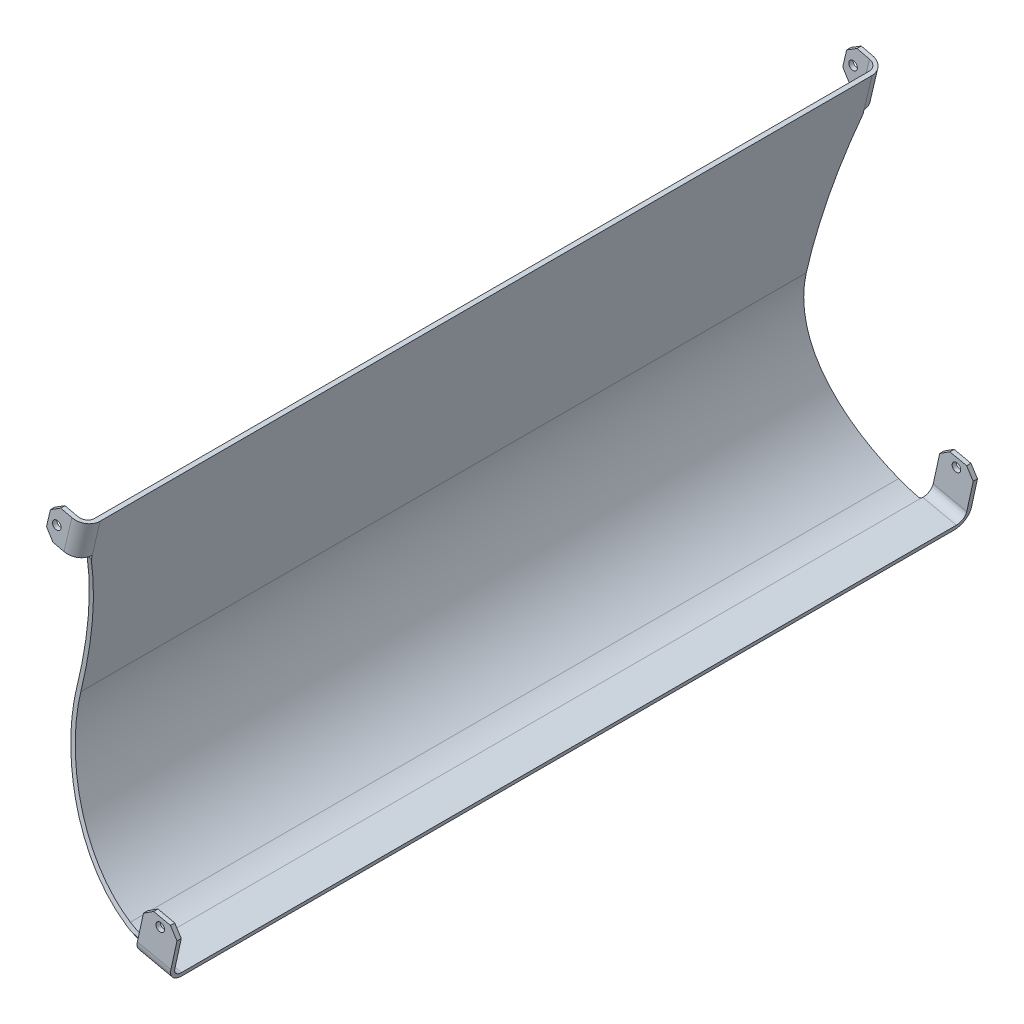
ISO-10303-21;
HEADER;
FILE_DESCRIPTION(('STEP AP214'),'2;1');
FILE_NAME('part.step','',(''),(''),'','','');
FILE_SCHEMA(('AUTOMOTIVE_DESIGN { 1 0 10303 214 1 1 1 1 }'));
ENDSEC;
DATA;
#1=APPLICATION_CONTEXT('core data for automotive mechanical design processes');
#2=APPLICATION_PROTOCOL_DEFINITION('international standard','automotive_design',2000,#1);
#3=PRODUCT_CONTEXT('',#1,'mechanical');
#4=PRODUCT('Part','Part','',(#3));
#5=PRODUCT_RELATED_PRODUCT_CATEGORY('part','',(#4));
#6=PRODUCT_DEFINITION_FORMATION('','',#4);
#7=PRODUCT_DEFINITION_CONTEXT('part definition',#1,'design');
#8=PRODUCT_DEFINITION('design','',#6,#7);
#9=PRODUCT_DEFINITION_SHAPE('','',#8);
#10=(LENGTH_UNIT() NAMED_UNIT(*) SI_UNIT(.MILLI.,.METRE.));
#11=(NAMED_UNIT(*) PLANE_ANGLE_UNIT() SI_UNIT($,.RADIAN.));
#12=(NAMED_UNIT(*) SI_UNIT($,.STERADIAN.) SOLID_ANGLE_UNIT());
#13=UNCERTAINTY_MEASURE_WITH_UNIT(LENGTH_MEASURE(1.E-05),#10,'distance_accuracy_value','');
#14=(GEOMETRIC_REPRESENTATION_CONTEXT(3) GLOBAL_UNCERTAINTY_ASSIGNED_CONTEXT((#13)) GLOBAL_UNIT_ASSIGNED_CONTEXT((#10,
#11,#12)) REPRESENTATION_CONTEXT('',''));
#15=CARTESIAN_POINT('',(0.,0.,0.));
#16=DIRECTION('',(0.,0.,1.));
#17=DIRECTION('',(1.,0.,0.));
#18=AXIS2_PLACEMENT_3D('',#15,#16,#17);
#19=CARTESIAN_POINT('',(-53.5517653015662,3.12575153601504,-5.));
#20=DIRECTION('',(0.,0.,-1.));
#21=DIRECTION('',(0.,1.,0.));
#22=AXIS2_PLACEMENT_3D('',#19,#20,#21);
#23=PLANE('',#22);
#24=DIRECTION('',(0.229232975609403,0.973371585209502,0.));
#25=VECTOR('',#24,1.);
#26=CARTESIAN_POINT('',(-48.117518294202,-44.2342646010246,-5.));
#27=LINE('',#26,#25);
#28=CARTESIAN_POINT('',(-36.3387299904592,5.78095599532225,-5.));
#29=VERTEX_POINT('',#28);
#30=CARTESIAN_POINT('',(-36.0018253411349,7.21152422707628,-5.));
#31=VERTEX_POINT('',#30);
#32=EDGE_CURVE('E769',#29,#31,#27,.T.);
#33=ORIENTED_EDGE('',*,*,#32,.F.);
#34=DIRECTION('',(-0.973371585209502,0.229232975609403,0.));
#35=VECTOR('',#34,1.);
#36=CARTESIAN_POINT('',(7.92251071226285,-4.64274659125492,-5.));
#37=LINE('',#36,#35);
#38=CARTESIAN_POINT('',(-34.8786726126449,5.43710653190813,-5.));
#39=VERTEX_POINT('',#38);
#40=EDGE_CURVE('E345',#29,#39,#37,.F.);
#41=ORIENTED_EDGE('',*,*,#40,.T.);
#42=DIRECTION('',(-0.229232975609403,-0.973371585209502,0.));
#43=VECTOR('',#42,1.);
#44=CARTESIAN_POINT('',(-46.6574609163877,-44.5781140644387,-5.));
#45=LINE('',#44,#43);
#46=CARTESIAN_POINT('',(-34.5417679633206,6.86767476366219,-5.));
#47=VERTEX_POINT('',#46);
#48=EDGE_CURVE('E368',#47,#39,#45,.T.);
#49=ORIENTED_EDGE('',*,*,#48,.F.);
#50=DIRECTION('',(0.973371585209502,-0.229232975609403,0.));
#51=VECTOR('',#50,1.);
#52=CARTESIAN_POINT('',(-51.717901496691,10.9127242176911,-5.));
#53=LINE('',#52,#51);
#54=EDGE_CURVE('E781',#31,#47,#53,.T.);
#55=ORIENTED_EDGE('',*,*,#54,.F.);
#56=EDGE_LOOP('',(#33,#41,#49,#55));
#57=FACE_BOUND('',#56,.T.);
#58=ADVANCED_FACE('F36',(#57),#23,.F.);
#59=CARTESIAN_POINT('',(-40.3458157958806,-78.5584411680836,-275.));
#60=DIRECTION('',(0.,0.,1.));
#61=DIRECTION('',(1.,0.,0.));
#62=AXIS2_PLACEMENT_3D('',#59,#60,#61);
#63=PLANE('',#62);
#64=DIRECTION('',(-0.229232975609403,-0.973371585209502,0.));
#65=VECTOR('',#64,1.);
#66=CARTESIAN_POINT('',(-31.7909722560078,18.5481337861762,-275.));
#67=LINE('',#66,#65);
#68=CARTESIAN_POINT('',(-34.8786726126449,5.43710653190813,-275.));
#69=VERTEX_POINT('',#68);
#70=CARTESIAN_POINT('',(-34.5417679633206,6.86767476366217,-275.));
#71=VERTEX_POINT('',#70);
#72=EDGE_CURVE('E365',#69,#71,#67,.F.);
#73=ORIENTED_EDGE('',*,*,#72,.F.);
#74=DIRECTION('',(-0.973371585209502,0.229232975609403,0.));
#75=VECTOR('',#74,1.);
#76=CARTESIAN_POINT('',(7.92251071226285,-4.64274659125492,-275.));
#77=LINE('',#76,#75);
#78=CARTESIAN_POINT('',(-36.3387299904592,5.78095599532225,-275.));
#79=VERTEX_POINT('',#78);
#80=EDGE_CURVE('E1440',#69,#79,#77,.T.);
#81=ORIENTED_EDGE('',*,*,#80,.T.);
#82=DIRECTION('',(-0.229232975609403,-0.973371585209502,0.));
#83=VECTOR('',#82,1.);
#84=CARTESIAN_POINT('',(-48.117518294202,-44.2342646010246,-275.));
#85=LINE('',#84,#83);
#86=CARTESIAN_POINT('',(-36.0018253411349,7.21152422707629,-275.));
#87=VERTEX_POINT('',#86);
#88=EDGE_CURVE('E472',#87,#79,#85,.T.);
#89=ORIENTED_EDGE('',*,*,#88,.F.);
#90=DIRECTION('',(0.973371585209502,-0.229232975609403,0.));
#91=VECTOR('',#90,1.);
#92=CARTESIAN_POINT('',(-51.717901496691,10.9127242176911,-275.));
#93=LINE('',#92,#91);
#94=EDGE_CURVE('E793',#87,#71,#93,.T.);
#95=ORIENTED_EDGE('',*,*,#94,.T.);
#96=EDGE_LOOP('',(#73,#81,#89,#95));
#97=FACE_BOUND('',#96,.T.);
#98=ADVANCED_FACE('F811',(#97),#63,.F.);
#99=CARTESIAN_POINT('',(-2.02929937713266,-99.9364461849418,-5.));
#100=DIRECTION('',(-0.976896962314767,0.213710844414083,0.));
#101=DIRECTION('',(-0.213710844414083,-0.976896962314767,0.));
#102=AXIS2_PLACEMENT_3D('',#99,#100,#101);
#103=CYLINDRICAL_SURFACE('',#102,5.);
#104=CARTESIAN_POINT('',(-15.0043299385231,-100.743552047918,-1.49048629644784));
#105=CARTESIAN_POINT('',(-14.9330726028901,-100.760237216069,-1.49157397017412));
#106=CARTESIAN_POINT('',(-14.8617541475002,-100.776661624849,-1.49238982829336));
#107=CARTESIAN_POINT('',(-14.7189949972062,-100.808988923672,-1.49347791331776));
#108=CARTESIAN_POINT('',(-14.6475543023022,-100.824891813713,-1.49375014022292));
#109=CARTESIAN_POINT('',(-14.5760524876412,-100.840533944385,-1.49375055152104));
#110=B_SPLINE_CURVE_WITH_KNOTS('',3,(#104,#105,#106,#107,#108,#109),.UNSPECIFIED.,.F.,.F.,(4,2,
4),(0.,0.21956944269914,0.439138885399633),.UNSPECIFIED.);
#111=CARTESIAN_POINT('',(-14.724708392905,-100.807617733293,-1.49335779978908));
#112=VERTEX_POINT('',#111);
#113=CARTESIAN_POINT('',(-14.5760524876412,-100.840533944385,-1.49375055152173));
#114=VERTEX_POINT('',#113);
#115=EDGE_CURVE('E642',#112,#114,#110,.T.);
#116=ORIENTED_EDGE('',*,*,#115,.F.);
#117=CARTESIAN_POINT('',(-13.9075746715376,-97.3378955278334,-5.));
#118=DIRECTION('',(-0.973371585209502,0.229232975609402,0.));
#119=DIRECTION('',(-0.229232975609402,-0.973371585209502,0.));
#120=AXIS2_PLACEMENT_3D('',#117,#118,#119);
#121=ELLIPSE('',#120,5.00063349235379,5.);
#122=CARTESIAN_POINT('',(-15.0538847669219,-102.205370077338,-5.00000000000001));
#123=VERTEX_POINT('',#122);
#124=EDGE_CURVE('E785',#112,#123,#121,.F.);
#125=ORIENTED_EDGE('',*,*,#124,.T.);
#126=DIRECTION('',(-0.976896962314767,0.213710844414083,0.));
#127=VECTOR('',#126,1.);
#128=CARTESIAN_POINT('',(-3.09785359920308,-104.820930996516,-5.));
#129=LINE('',#128,#127);
#130=CARTESIAN_POINT('',(-3.09785359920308,-104.820930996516,-5.));
#131=VERTEX_POINT('',#130);
#132=EDGE_CURVE('E639',#131,#123,#129,.T.);
#133=ORIENTED_EDGE('',*,*,#132,.F.);
#134=CARTESIAN_POINT('',(-2.02929937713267,-99.9364461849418,-5.));
#135=DIRECTION('',(-0.976896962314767,0.213710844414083,0.));
#136=DIRECTION('',(-0.213710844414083,-0.976896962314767,0.));
#137=AXIS2_PLACEMENT_3D('',#134,#135,#136);
#138=CIRCLE('',#137,5.);
#139=CARTESIAN_POINT('',(-2.02929937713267,-99.9364461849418,0.));
#140=VERTEX_POINT('',#139);
#141=EDGE_CURVE('E353',#140,#131,#138,.F.);
#142=ORIENTED_EDGE('',*,*,#141,.F.);
#143=DIRECTION('',(-0.976896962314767,0.213710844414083,0.));
#144=VECTOR('',#143,1.);
#145=CARTESIAN_POINT('',(-14.2432278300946,-97.2644663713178,0.));
#146=LINE('',#145,#144);
#147=CARTESIAN_POINT('',(-13.7520629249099,-97.3719160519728,0.));
#148=VERTEX_POINT('',#147);
#149=EDGE_CURVE('E871',#148,#140,#146,.F.);
#150=ORIENTED_EDGE('',*,*,#149,.F.);
#151=CARTESIAN_POINT('',(-13.7520629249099,-97.3719160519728,-5.));
#152=DIRECTION('',(-0.976896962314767,0.213710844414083,0.));
#153=DIRECTION('',(-0.213710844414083,-0.976896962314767,0.));
#154=AXIS2_PLACEMENT_3D('',#151,#152,#153);
#155=CIRCLE('',#154,5.);
#156=CARTESIAN_POINT('',(-14.5138518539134,-100.854141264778,-1.49375055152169));
#157=VERTEX_POINT('',#156);
#158=EDGE_CURVE('E870',#157,#148,#155,.T.);
#159=ORIENTED_EDGE('',*,*,#158,.F.);
#160=DIRECTION('',(-0.976896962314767,0.213710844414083,0.));
#161=VECTOR('',#160,1.);
#162=CARTESIAN_POINT('',(-14.5760524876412,-100.840533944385,-1.49375055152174));
#163=LINE('',#162,#161);
#164=EDGE_CURVE('E649',#114,#157,#163,.F.);
#165=ORIENTED_EDGE('',*,*,#164,.F.);
#166=EDGE_LOOP('',(#116,#125,#133,#142,#150,#159,#165));
#167=FACE_BOUND('',#166,.T.);
#168=ADVANCED_FACE('F651',(#167),#103,.T.);
#169=CARTESIAN_POINT('',(-8.9004567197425,-72.8420423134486,-280.));
#170=DIRECTION('',(0.,0.,-1.));
#171=DIRECTION('',(-1.,0.,0.));
#172=AXIS2_PLACEMENT_3D('',#169,#170,#171);
#173=PLANE('',#172);
#174=CARTESIAN_POINT('',(-41.9267143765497,14.7710010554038,-280.));
#175=DIRECTION('',(0.,0.,-1.));
#176=DIRECTION('',(-1.,0.,0.));
#177=AXIS2_PLACEMENT_3D('',#174,#175,#176);
#178=CIRCLE('',#177,1.49999999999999);
#179=CARTESIAN_POINT('',(-43.4267143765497,14.7710010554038,-280.));
#180=VERTEX_POINT('',#179);
#181=EDGE_CURVE('E487',#180,#180,#178,.T.);
#182=ORIENTED_EDGE('',*,*,#181,.F.);
#183=EDGE_LOOP('',(#182));
#184=FACE_BOUND('',#183,.T.);
#185=DIRECTION('',(0.229232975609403,0.973371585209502,0.));
#186=VECTOR('',#185,1.);
#187=CARTESIAN_POINT('',(-43.4714312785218,21.298929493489,-280.));
#188=LINE('',#187,#186);
#189=CARTESIAN_POINT('',(-45.5345280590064,12.5385852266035,-280.));
#190=VERTEX_POINT('',#189);
#191=CARTESIAN_POINT('',(-44.15913020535,18.3788147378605,-280.));
#192=VERTEX_POINT('',#191);
#193=EDGE_CURVE('E537',#190,#192,#188,.T.);
#194=ORIENTED_EDGE('',*,*,#193,.T.);
#195=DIRECTION('',(0.850369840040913,0.526185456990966,0.));
#196=VECTOR('',#195,1.);
#197=CARTESIAN_POINT('',(-59.4795427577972,8.89896502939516,-280.));
#198=LINE('',#197,#196);
#199=CARTESIAN_POINT('',(-40.5513165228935,20.6112305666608,-280.));
#200=VERTEX_POINT('',#199);
#201=EDGE_CURVE('E434',#192,#200,#198,.T.);
#202=ORIENTED_EDGE('',*,*,#201,.T.);
#203=DIRECTION('',(0.973371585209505,-0.229232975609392,0.));
#204=VECTOR('',#203,1.);
#205=CARTESIAN_POINT('',(-33.251029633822,18.8919832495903,-280.));
#206=LINE('',#205,#204);
#207=CARTESIAN_POINT('',(-36.6578301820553,19.6942986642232,-280.));
#208=VERTEX_POINT('',#207);
#209=EDGE_CURVE('E563',#200,#208,#206,.T.);
#210=ORIENTED_EDGE('',*,*,#209,.T.);
#211=DIRECTION('',(-0.229232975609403,-0.973371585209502,0.));
#212=VECTOR('',#211,1.);
#213=CARTESIAN_POINT('',(-41.2424896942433,0.226866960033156,-280.));
#214=LINE('',#213,#212);
#215=CARTESIAN_POINT('',(-39.4086258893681,8.01383964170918,-280.));
#216=VERTEX_POINT('',#215);
#217=EDGE_CURVE('E382',#208,#216,#214,.T.);
#218=ORIENTED_EDGE('',*,*,#217,.T.);
#219=DIRECTION('',(-0.973371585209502,0.229232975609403,0.));
#220=VECTOR('',#219,1.);
#221=CARTESIAN_POINT('',(-34.5417679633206,6.86767476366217,-280.));
#222=LINE('',#221,#220);
#223=CARTESIAN_POINT('',(-43.3021122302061,8.93077154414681,-280.));
#224=VERTEX_POINT('',#223);
#225=EDGE_CURVE('E532',#216,#224,#222,.T.);
#226=ORIENTED_EDGE('',*,*,#225,.T.);
#227=DIRECTION('',(0.526185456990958,-0.850369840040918,0.));
#228=VECTOR('',#227,1.);
#229=CARTESIAN_POINT('',(2.81214215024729,-65.5946084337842,-280.));
#230=LINE('',#229,#228);
#231=EDGE_CURVE('E432',#224,#190,#230,.F.);
#232=ORIENTED_EDGE('',*,*,#231,.T.);
#233=EDGE_LOOP('',(#194,#202,#210,#218,#226,#232));
#234=FACE_BOUND('',#233,.T.);
#235=ADVANCED_FACE('F714',(#184,#234),#173,.T.);
#236=CARTESIAN_POINT('',(0.,-55.5661362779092,3.));
#237=DIRECTION('',(0.,0.,-1.));
#238=DIRECTION('',(-1.,0.,0.));
#239=AXIS2_PLACEMENT_3D('',#236,#237,#238);
#240=CYLINDRICAL_SURFACE('',#239,49.4338637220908);
#241=DIRECTION('',(0.,0.,1.));
#242=VECTOR('',#241,1.);
#243=CARTESIAN_POINT('',(-22.6400663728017,-99.5108091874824,-280.));
#244=LINE('',#243,#242);
#245=CARTESIAN_POINT('',(-22.6400663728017,-99.5108091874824,-274.851494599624));
#246=VERTEX_POINT('',#245);
#247=CARTESIAN_POINT('',(-22.6400663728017,-99.5108091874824,-5.1485054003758));
#248=VERTEX_POINT('',#247);
#249=EDGE_CURVE('E583',#246,#248,#244,.T.);
#250=ORIENTED_EDGE('',*,*,#249,.T.);
#251=CARTESIAN_POINT('',(-20.8384618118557,-100.393197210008,-5.00000000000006));
#252=CARTESIAN_POINT('',(-21.4665620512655,-100.101227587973,-5.04692226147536));
#253=CARTESIAN_POINT('',(-22.0882235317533,-99.796175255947,-5.0983964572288));
#254=CARTESIAN_POINT('',(-23.3175625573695,-99.1605934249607,-5.20998488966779));
#255=CARTESIAN_POINT('',(-23.9252406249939,-98.8300648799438,-5.27009880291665));
#256=CARTESIAN_POINT('',(-25.1253558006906,-98.1443099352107,-5.39848526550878));
#257=CARTESIAN_POINT('',(-25.7177978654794,-97.7890917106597,-5.46675511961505));
#258=CARTESIAN_POINT('',(-26.8865883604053,-97.0546261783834,-5.61092434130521));
#259=CARTESIAN_POINT('',(-27.4629366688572,-96.6753786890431,-5.68682376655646));
#260=CARTESIAN_POINT('',(-29.1639258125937,-95.5043853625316,-5.9247712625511));
#261=CARTESIAN_POINT('',(-30.2633837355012,-94.6777451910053,-6.09738030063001));
#262=CARTESIAN_POINT('',(-32.3872849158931,-92.9379977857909,-6.46562801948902));
#263=CARTESIAN_POINT('',(-33.4117231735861,-92.0248847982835,-6.66126823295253));
#264=CARTESIAN_POINT('',(-35.3786248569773,-90.1194680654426,-7.06983762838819));
#265=CARTESIAN_POINT('',(-36.3211585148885,-89.1272335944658,-7.28275168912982));
#266=CARTESIAN_POINT('',(-38.1196209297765,-87.0696060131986,-7.72016306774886));
#267=CARTESIAN_POINT('',(-38.9755507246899,-86.0042137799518,-7.94466024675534));
#268=CARTESIAN_POINT('',(-40.596196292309,-83.8065438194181,-8.39937265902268));
#269=CARTESIAN_POINT('',(-41.3608694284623,-82.6742351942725,-8.62959050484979));
#270=CARTESIAN_POINT('',(-42.7939547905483,-80.3501667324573,-9.08965583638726));
#271=CARTESIAN_POINT('',(-43.4623650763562,-79.1584056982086,-9.31950331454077));
#272=CARTESIAN_POINT('',(-44.7163706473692,-76.6878424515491,-9.77942237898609));
#273=CARTESIAN_POINT('',(-45.2990525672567,-75.4075259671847,-10.0093125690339));
#274=CARTESIAN_POINT('',(-46.3538713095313,-72.7999279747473,-10.4562842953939));
#275=CARTESIAN_POINT('',(-46.8260058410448,-71.472645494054,-10.6733655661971));
#276=CARTESIAN_POINT('',(-47.6558949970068,-68.7800313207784,-11.0888581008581));
#277=CARTESIAN_POINT('',(-48.0136592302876,-67.4147028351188,-11.2872709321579));
#278=CARTESIAN_POINT('',(-48.6115905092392,-64.6553022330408,-11.6600755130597));
#279=CARTESIAN_POINT('',(-48.8517603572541,-63.261230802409,-11.8344678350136));
#280=CARTESIAN_POINT('',(-49.2094592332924,-60.4736256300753,-12.1522867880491));
#281=CARTESIAN_POINT('',(-49.3286261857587,-59.0803470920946,-12.2961055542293));
#282=CARTESIAN_POINT('',(-49.4484065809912,-56.2857567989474,-12.5519292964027));
#283=CARTESIAN_POINT('',(-49.4490206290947,-54.8844450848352,-12.6639344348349));
#284=CARTESIAN_POINT('',(-49.3310237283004,-52.0848517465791,-12.8531354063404));
#285=CARTESIAN_POINT('',(-49.2124451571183,-50.6865694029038,-12.9303406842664));
#286=CARTESIAN_POINT('',(-48.8565327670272,-47.9036499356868,-13.047999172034));
#287=CARTESIAN_POINT('',(-48.6192031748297,-46.5190123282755,-13.0884536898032));
#288=CARTESIAN_POINT('',(-48.0401684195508,-43.8335333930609,-13.1307779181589));
#289=CARTESIAN_POINT('',(-47.7033961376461,-42.531650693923,-13.134233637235));
#290=CARTESIAN_POINT('',(-46.9250486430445,-39.9600044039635,-13.1068297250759));
#291=CARTESIAN_POINT('',(-46.4834766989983,-38.6902398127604,-13.0759711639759));
#292=CARTESIAN_POINT('',(-45.4989359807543,-36.1920218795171,-12.9810291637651));
#293=CARTESIAN_POINT('',(-44.9559716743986,-34.9635667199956,-12.9169471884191));
#294=CARTESIAN_POINT('',(-43.7728516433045,-32.556512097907,-12.7575295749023));
#295=CARTESIAN_POINT('',(-43.1326951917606,-31.3779130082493,-12.6621937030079));
#296=CARTESIAN_POINT('',(-41.7656391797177,-29.0877979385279,-12.4439244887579));
#297=CARTESIAN_POINT('',(-41.0394784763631,-27.9758187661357,-12.3212192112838));
#298=CARTESIAN_POINT('',(-39.5016985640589,-25.8158370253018,-12.0511743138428));
#299=CARTESIAN_POINT('',(-38.6900802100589,-24.767833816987,-11.9038349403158));
#300=CARTESIAN_POINT('',(-36.9869549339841,-22.7420065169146,-11.5884519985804));
#301=CARTESIAN_POINT('',(-36.0954367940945,-21.7641923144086,-11.420405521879));
#302=CARTESIAN_POINT('',(-34.2385517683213,-19.8845744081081,-11.0680340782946));
#303=CARTESIAN_POINT('',(-33.2731828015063,-18.9827728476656,-10.8837086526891));
#304=CARTESIAN_POINT('',(-31.2385095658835,-17.2290661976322,-10.4966512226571));
#305=CARTESIAN_POINT('',(-30.1667069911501,-16.380152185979,-10.2934943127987));
#306=CARTESIAN_POINT('',(-27.9573677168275,-14.7745018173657,-9.88039814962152));
#307=CARTESIAN_POINT('',(-26.8198292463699,-14.0177679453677,-9.67045871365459));
#308=CARTESIAN_POINT('',(-24.4857502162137,-12.6008072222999,-9.24949160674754));
#309=CARTESIAN_POINT('',(-23.2891879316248,-11.9406162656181,-9.0384635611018));
#310=CARTESIAN_POINT('',(-20.8448581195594,-10.7212459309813,-8.62125184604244));
#311=CARTESIAN_POINT('',(-19.5970909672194,-10.1620658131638,-8.41506814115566));
#312=CARTESIAN_POINT('',(-17.0210195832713,-9.13370480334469,-8.00750178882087));
#313=CARTESIAN_POINT('',(-15.6914281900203,-8.66761880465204,-7.80643377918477));
#314=CARTESIAN_POINT('',(-12.9948159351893,-7.85003052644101,-7.42171519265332));
#315=CARTESIAN_POINT('',(-11.627791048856,-7.49854062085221,-7.23806649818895));
#316=CARTESIAN_POINT('',(-8.86740727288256,-6.91364933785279,-6.89419186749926));
#317=CARTESIAN_POINT('',(-7.47407876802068,-6.68011943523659,-6.73394057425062));
#318=CARTESIAN_POINT('',(-4.66989317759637,-6.33308526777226,-6.44187728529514));
#319=CARTESIAN_POINT('',(-3.25904277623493,-6.2195365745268,-6.31005477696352));
#320=CARTESIAN_POINT('',(-1.07016895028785,-6.13777063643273,-6.13141585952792));
#321=CARTESIAN_POINT('',(-0.294426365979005,-6.12705696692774,-6.07311261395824));
#322=CARTESIAN_POINT('',(1.25727982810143,-6.14217677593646,-5.9669334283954));
#323=CARTESIAN_POINT('',(2.03324333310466,-6.16800105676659,-5.91905486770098));
#324=CARTESIAN_POINT('',(3.58285955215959,-6.25618206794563,-5.83426803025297));
#325=CARTESIAN_POINT('',(4.35651383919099,-6.31850029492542,-5.79734825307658));
#326=CARTESIAN_POINT('',(5.90069317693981,-6.4795603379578,-5.73476503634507));
#327=CARTESIAN_POINT('',(6.67121730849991,-6.57831216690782,-5.70910469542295));
#328=CARTESIAN_POINT('',(7.43914380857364,-6.69522446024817,-5.68926123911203));
#329=B_SPLINE_CURVE_WITH_KNOTS('',3,(#251,#252,#253,#254,#255,#256,#257,#258,#259,#260,#261,
#262,#263,#264,#265,#266,#267,#268,#269,#270,#271,#272,#273,#274,#275,#276,#277,#278,#279,#280,
#281,#282,#283,#284,#285,#286,#287,#288,#289,#290,#291,#292,#293,#294,#295,#296,#297,#298,#299,
#300,#301,#302,#303,#304,#305,#306,#307,#308,#309,#310,#311,#312,#313,#314,#315,#316,#317,#318,
#319,#320,#321,#322,#323,#324,#325,#326,#327,#328),.UNSPECIFIED.,.F.,.F.,(4,2,2,2,2,2,2,2,2,2,2,
2,2,2,2,2,2,2,2,2,2,2,2,2,2,2,2,2,2,2,2,2,2,2,2,2,2,2,4),(0.,2.08250216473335,4.1649263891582,
6.24666434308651,8.32841803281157,12.4819851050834,16.6358287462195,20.7860746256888,
24.936270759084,29.0883984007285,33.2406097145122,37.5115098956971,41.7824985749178,
46.0531283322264,50.3236563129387,54.5355741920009,58.7474705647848,62.9582231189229,
67.1688258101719,71.1981732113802,75.227394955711,79.2564391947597,83.2855135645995,
87.2821916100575,91.2788296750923,95.2760297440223,99.273342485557,103.415464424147,
107.557698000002,111.701467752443,115.845207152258,120.10961039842,124.374473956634,
128.634680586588,132.893309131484,135.226532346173,137.559168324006,139.889347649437,
142.220167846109),.UNSPECIFIED.);
#330=CARTESIAN_POINT('',(-48.117518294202,-44.2342646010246,-13.1217099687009));
#331=VERTEX_POINT('',#330);
#332=EDGE_CURVE('E331',#248,#331,#329,.T.);
#333=ORIENTED_EDGE('',*,*,#332,.T.);
#334=DIRECTION('',(0.,0.,-1.));
#335=VECTOR('',#334,1.);
#336=CARTESIAN_POINT('',(-48.117518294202,-44.2342646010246,3.));
#337=LINE('',#336,#335);
#338=CARTESIAN_POINT('',(-48.117518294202,-44.2342646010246,-266.878290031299));
#339=VERTEX_POINT('',#338);
#340=EDGE_CURVE('E589',#331,#339,#337,.T.);
#341=ORIENTED_EDGE('',*,*,#340,.T.);
#342=CARTESIAN_POINT('',(-48.117518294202,-44.2342646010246,-266.878290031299));
#343=CARTESIAN_POINT('',(-48.2731097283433,-44.8948874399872,-266.884697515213));
#344=CARTESIAN_POINT('',(-48.415063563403,-45.5586763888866,-266.895521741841));
#345=CARTESIAN_POINT('',(-48.6714959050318,-46.8913184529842,-266.925912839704));
#346=CARTESIAN_POINT('',(-48.7859753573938,-47.560171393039,-266.945479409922));
#347=CARTESIAN_POINT('',(-48.9872475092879,-48.9015721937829,-266.993259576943));
#348=CARTESIAN_POINT('',(-49.0740462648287,-49.5741192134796,-267.021471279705));
#349=CARTESIAN_POINT('',(-49.2198802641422,-50.9218223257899,-267.086377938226));
#350=CARTESIAN_POINT('',(-49.2789149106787,-51.5969784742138,-267.123073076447));
#351=CARTESIAN_POINT('',(-49.3690527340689,-52.946970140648,-267.204625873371));
#352=CARTESIAN_POINT('',(-49.4002248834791,-53.6218022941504,-267.249463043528));
#353=CARTESIAN_POINT('',(-49.4348976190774,-54.9715551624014,-267.347083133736));
#354=CARTESIAN_POINT('',(-49.4383999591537,-55.6464758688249,-267.399865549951));
#355=CARTESIAN_POINT('',(-49.4178045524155,-56.9952202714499,-267.513051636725));
#356=CARTESIAN_POINT('',(-49.3937086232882,-57.6690440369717,-267.573454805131));
#357=CARTESIAN_POINT('',(-49.3180438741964,-59.0145751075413,-267.701518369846));
#358=CARTESIAN_POINT('',(-49.2664685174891,-59.6862818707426,-267.769180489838));
#359=CARTESIAN_POINT('',(-49.0708431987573,-61.6954660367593,-267.982337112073));
#360=CARTESIAN_POINT('',(-48.8858769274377,-63.0280969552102,-268.138094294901));
#361=CARTESIAN_POINT('',(-48.4086956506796,-65.6710101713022,-268.47312307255));
#362=CARTESIAN_POINT('',(-48.1164769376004,-66.9812916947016,-268.652395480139));
#363=CARTESIAN_POINT('',(-47.5996768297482,-68.9238060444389,-268.935631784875));
#364=CARTESIAN_POINT('',(-47.414245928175,-69.5677335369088,-269.032471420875));
#365=CARTESIAN_POINT('',(-47.0176145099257,-70.8468077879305,-269.230311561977));
#366=CARTESIAN_POINT('',(-46.8064206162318,-71.4819567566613,-269.331310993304));
#367=CARTESIAN_POINT('',(-46.3585980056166,-72.7427142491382,-269.536886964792));
#368=CARTESIAN_POINT('',(-46.1219665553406,-73.3683217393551,-269.641463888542));
#369=CARTESIAN_POINT('',(-45.6237114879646,-74.6090059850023,-269.853547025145));
#370=CARTESIAN_POINT('',(-45.3620860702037,-75.2240819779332,-269.961053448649));
#371=CARTESIAN_POINT('',(-44.5243078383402,-77.0878324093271,-270.293356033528));
#372=CARTESIAN_POINT('',(-43.9082909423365,-78.3182152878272,-270.521882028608));
#373=CARTESIAN_POINT('',(-42.576322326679,-80.7227119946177,-270.982669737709));
#374=CARTESIAN_POINT('',(-41.8603684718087,-81.8968246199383,-271.214931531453));
#375=CARTESIAN_POINT('',(-40.3330088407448,-84.1815693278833,-271.677129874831));
#376=CARTESIAN_POINT('',(-39.5216145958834,-85.2922090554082,-271.907066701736));
#377=CARTESIAN_POINT('',(-37.8081742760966,-87.4430770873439,-272.358518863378));
#378=CARTESIAN_POINT('',(-36.9061274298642,-88.483304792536,-272.58003412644));
#379=CARTESIAN_POINT('',(-35.0084454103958,-90.4952786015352,-273.010472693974));
#380=CARTESIAN_POINT('',(-34.0120546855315,-91.4663394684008,-273.219267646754));
#381=CARTESIAN_POINT('',(-31.938498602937,-93.3229222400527,-273.616119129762));
#382=CARTESIAN_POINT('',(-30.8613379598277,-94.2084491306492,-273.804176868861));
#383=CARTESIAN_POINT('',(-29.1897233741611,-95.4679574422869,-274.066595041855));
#384=CARTESIAN_POINT('',(-28.6226592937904,-95.8766737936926,-274.150858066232));
#385=CARTESIAN_POINT('',(-27.4709690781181,-96.6701698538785,-274.312137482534));
#386=CARTESIAN_POINT('',(-26.8863430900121,-97.0549497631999,-274.389153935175));
#387=CARTESIAN_POINT('',(-25.7003841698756,-97.7998624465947,-274.53534411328));
#388=CARTESIAN_POINT('',(-25.0990459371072,-98.1599872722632,-274.604515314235));
#389=CARTESIAN_POINT('',(-23.8808912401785,-98.8547240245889,-274.73444834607));
#390=CARTESIAN_POINT('',(-23.2640741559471,-99.189334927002,-274.795209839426));
#391=CARTESIAN_POINT('',(-22.6400663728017,-99.5108091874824,-274.851494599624));
#392=B_SPLINE_CURVE_WITH_KNOTS('',3,(#342,#343,#344,#345,#346,#347,#348,#349,#350,#351,#352,
#353,#354,#355,#356,#357,#358,#359,#360,#361,#362,#363,#364,#365,#366,#367,#368,#369,#370,#371,
#372,#373,#374,#375,#376,#377,#378,#379,#380,#381,#382,#383,#384,#385,#386,#387,#388,#389,#390,
#391),.UNSPECIFIED.,.F.,.F.,(4,2,2,2,2,2,2,2,2,2,2,2,2,2,2,2,2,2,2,2,2,2,2,2,4),(0.,
2.03602285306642,4.07197560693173,6.10748262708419,8.14303343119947,10.1735312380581,
12.2039003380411,14.2341357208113,16.2648542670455,20.3230207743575,24.3813275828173,
26.4120272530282,28.4422059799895,30.4726030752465,32.5031465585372,36.6824451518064,
40.8618330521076,45.0407165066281,49.219635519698,53.4354273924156,57.6509733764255,
59.7626315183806,61.8742719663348,63.9865899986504,66.0989927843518),.UNSPECIFIED.);
#393=EDGE_CURVE('E701',#339,#246,#392,.T.);
#394=ORIENTED_EDGE('',*,*,#393,.T.);
#395=EDGE_LOOP('',(#250,#333,#341,#394));
#396=FACE_BOUND('',#395,.T.);
#397=ADVANCED_FACE('F709',(#396),#240,.T.);
#398=CARTESIAN_POINT('',(0.,-55.5661362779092,3.));
#399=DIRECTION('',(0.,0.,-1.));
#400=DIRECTION('',(-1.,0.,0.));
#401=AXIS2_PLACEMENT_3D('',#398,#399,#400);
#402=CYLINDRICAL_SURFACE('',#401,47.9338637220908);
#403=DIRECTION('',(0.,0.,-1.));
#404=VECTOR('',#403,1.);
#405=CARTESIAN_POINT('',(-46.6574609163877,-44.5781140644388,3.));
#406=LINE('',#405,#404);
#407=CARTESIAN_POINT('',(-46.6574609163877,-44.5781140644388,-13.1217099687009));
#408=VERTEX_POINT('',#407);
#409=CARTESIAN_POINT('',(-46.6574609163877,-44.5781140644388,-266.878290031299));
#410=VERTEX_POINT('',#409);
#411=EDGE_CURVE('E591',#408,#410,#406,.T.);
#412=ORIENTED_EDGE('',*,*,#411,.F.);
#413=CARTESIAN_POINT('',(7.09414984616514,-8.160141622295,-6.16117635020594));
#414=CARTESIAN_POINT('',(6.4372477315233,-8.0618280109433,-6.17807708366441));
#415=CARTESIAN_POINT('',(5.77841590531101,-7.97720611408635,-6.19920325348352));
#416=CARTESIAN_POINT('',(4.45813236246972,-7.83542394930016,-6.24968242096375));
#417=CARTESIAN_POINT('',(3.79668070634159,-7.77826305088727,-6.27903522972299));
#418=CARTESIAN_POINT('',(2.47254022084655,-7.69148792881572,-6.34573568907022));
#419=CARTESIAN_POINT('',(1.8098517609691,-7.66186649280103,-6.38308124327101));
#420=CARTESIAN_POINT('',(0.484338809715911,-7.63013344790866,-6.46545925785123));
#421=CARTESIAN_POINT('',(-0.178485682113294,-7.62802193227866,-6.51049174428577));
#422=CARTESIAN_POINT('',(-2.16223339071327,-7.66284191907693,-6.65637284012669));
#423=CARTESIAN_POINT('',(-3.48188392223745,-7.74070304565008,-6.76818194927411));
#424=CARTESIAN_POINT('',(-6.10768748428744,-8.00466639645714,-7.0175673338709));
#425=CARTESIAN_POINT('',(-7.41383994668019,-8.1907731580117,-7.15514468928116));
#426=CARTESIAN_POINT('',(-10.003276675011,-8.66920646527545,-7.45182046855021));
#427=CARTESIAN_POINT('',(-11.2865738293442,-8.96147102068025,-7.61090629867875));
#428=CARTESIAN_POINT('',(-13.822726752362,-9.64975425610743,-7.94598625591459));
#429=CARTESIAN_POINT('',(-15.0755825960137,-10.0457726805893,-8.12198034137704));
#430=CARTESIAN_POINT('',(-17.5436028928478,-10.9387882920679,-8.48593496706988));
#431=CARTESIAN_POINT('',(-18.7587504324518,-11.4358300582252,-8.6739007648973));
#432=CARTESIAN_POINT('',(-21.1433569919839,-12.5273941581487,-9.05648889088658));
#433=CARTESIAN_POINT('',(-22.3128151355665,-13.1219183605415,-9.25111134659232));
#434=CARTESIAN_POINT('',(-24.6313214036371,-14.4228516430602,-9.64721623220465));
#435=CARTESIAN_POINT('',(-25.7788539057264,-15.1319521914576,-9.84873686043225));
#436=CARTESIAN_POINT('',(-28.010634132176,-16.6447147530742,-10.2474100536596));
#437=CARTESIAN_POINT('',(-29.0948806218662,-17.4483786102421,-10.4445625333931));
#438=CARTESIAN_POINT('',(-31.1928919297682,-19.14527545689,-10.8288754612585));
#439=CARTESIAN_POINT('',(-32.2066527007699,-20.0385135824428,-11.0160353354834));
#440=CARTESIAN_POINT('',(-34.1565533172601,-21.9088903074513,-11.374968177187));
#441=CARTESIAN_POINT('',(-35.0926936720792,-22.8860283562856,-11.5467412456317));
#442=CARTESIAN_POINT('',(-36.8850298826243,-24.9230373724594,-11.8707092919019));
#443=CARTESIAN_POINT('',(-37.7407987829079,-25.9833007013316,-12.0228011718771));
#444=CARTESIAN_POINT('',(-39.3603839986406,-28.1750411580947,-12.3018106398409));
#445=CARTESIAN_POINT('',(-40.1241996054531,-29.3065188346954,-12.4287280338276));
#446=CARTESIAN_POINT('',(-41.5534845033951,-31.6323569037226,-12.6534337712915));
#447=CARTESIAN_POINT('',(-42.2189785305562,-32.8267013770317,-12.7512294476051));
#448=CARTESIAN_POINT('',(-43.4462445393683,-35.2696475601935,-12.9145952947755));
#449=CARTESIAN_POINT('',(-44.0080203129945,-36.5182472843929,-12.9801666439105));
#450=CARTESIAN_POINT('',(-45.0044708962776,-39.0134623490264,-13.0750956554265));
#451=CARTESIAN_POINT('',(-45.4430496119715,-40.2584730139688,-13.1056925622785));
#452=CARTESIAN_POINT('',(-46.2161127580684,-42.7807555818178,-13.1338271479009));
#453=CARTESIAN_POINT('',(-46.550599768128,-44.0580266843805,-13.1313656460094));
#454=CARTESIAN_POINT('',(-47.1129759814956,-46.6351719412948,-13.0932000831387));
#455=CARTESIAN_POINT('',(-47.340877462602,-47.9350434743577,-13.0574998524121));
#456=CARTESIAN_POINT('',(-47.688668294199,-50.5478576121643,-12.9536000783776));
#457=CARTESIAN_POINT('',(-47.8085582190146,-51.8608001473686,-12.8854007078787));
#458=CARTESIAN_POINT('',(-47.9384770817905,-54.4624018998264,-12.7198979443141));
#459=CARTESIAN_POINT('',(-47.9507662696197,-55.7509902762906,-12.6232376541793));
#460=CARTESIAN_POINT('',(-47.8718291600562,-58.3226034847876,-12.4026339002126));
#461=CARTESIAN_POINT('',(-47.7806047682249,-59.6056284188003,-12.278690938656));
#462=CARTESIAN_POINT('',(-47.4958349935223,-62.1577866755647,-12.0064693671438));
#463=CARTESIAN_POINT('',(-47.3022776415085,-63.4269183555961,-11.8581879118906));
#464=CARTESIAN_POINT('',(-46.8147041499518,-65.9430871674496,-11.5408377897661));
#465=CARTESIAN_POINT('',(-46.5206854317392,-67.190123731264,-11.3717685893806));
#466=CARTESIAN_POINT('',(-45.8256917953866,-69.6864468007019,-11.0122500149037));
#467=CARTESIAN_POINT('',(-45.4221402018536,-70.9349525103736,-10.821359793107));
#468=CARTESIAN_POINT('',(-44.5149122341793,-73.3929186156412,-10.4266676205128));
#469=CARTESIAN_POINT('',(-44.0112343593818,-74.6023784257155,-10.2228654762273));
#470=CARTESIAN_POINT('',(-42.9070983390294,-76.9752227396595,-9.8073588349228));
#471=CARTESIAN_POINT('',(-42.3066170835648,-78.1385961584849,-9.59565246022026));
#472=CARTESIAN_POINT('',(-41.0127837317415,-80.4120126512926,-9.16966180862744));
#473=CARTESIAN_POINT('',(-40.3194299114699,-81.5220547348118,-8.95537748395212));
#474=CARTESIAN_POINT('',(-38.8157455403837,-83.7235033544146,-8.52148085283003));
#475=CARTESIAN_POINT('',(-38.0019527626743,-84.8125693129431,-8.30197865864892));
#476=CARTESIAN_POINT('',(-36.2838027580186,-86.9187766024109,-7.87210296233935));
#477=CARTESIAN_POINT('',(-35.3794416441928,-87.9359148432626,-7.66172985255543));
#478=CARTESIAN_POINT('',(-33.4862627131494,-89.8907047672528,-7.25620752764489));
#479=CARTESIAN_POINT('',(-32.497483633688,-90.8283925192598,-7.06105140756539));
#480=CARTESIAN_POINT('',(-30.4414334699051,-92.6178750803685,-6.69160957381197));
#481=CARTESIAN_POINT('',(-29.374167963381,-93.4696759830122,-6.51732237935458));
#482=CARTESIAN_POINT('',(-27.2541684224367,-95.0180352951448,-6.20747565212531));
#483=CARTESIAN_POINT('',(-26.2067648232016,-95.7215159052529,-6.06995796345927));
#484=CARTESIAN_POINT('',(-24.0573918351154,-97.0449144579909,-5.82087434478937));
#485=CARTESIAN_POINT('',(-22.9554282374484,-97.6648412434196,-5.7093056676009));
#486=CARTESIAN_POINT('',(-21.2660748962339,-98.5290380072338,-5.56365536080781));
#487=CARTESIAN_POINT('',(-20.6962982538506,-98.8064002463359,-5.51868814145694));
#488=CARTESIAN_POINT('',(-19.5457077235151,-99.3385272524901,-5.43634171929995));
#489=CARTESIAN_POINT('',(-18.9648938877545,-99.5932921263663,-5.39896248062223));
#490=CARTESIAN_POINT('',(-17.7930513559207,-100.079788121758,-5.33206066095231));
#491=CARTESIAN_POINT('',(-17.2020195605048,-100.311512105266,-5.30254050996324));
#492=CARTESIAN_POINT('',(-16.0109008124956,-100.751417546,-5.25157235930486));
#493=CARTESIAN_POINT('',(-15.4108136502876,-100.959598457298,-5.23012454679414));
#494=CARTESIAN_POINT('',(-14.8067050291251,-101.155792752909,-5.21281374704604));
#495=B_SPLINE_CURVE_WITH_KNOTS('',3,(#413,#414,#415,#416,#417,#418,#419,#420,#421,#422,#423,
#424,#425,#426,#427,#428,#429,#430,#431,#432,#433,#434,#435,#436,#437,#438,#439,#440,#441,#442,
#443,#444,#445,#446,#447,#448,#449,#450,#451,#452,#453,#454,#455,#456,#457,#458,#459,#460,#461,
#462,#463,#464,#465,#466,#467,#468,#469,#470,#471,#472,#473,#474,#475,#476,#477,#478,#479,#480,
#481,#482,#483,#484,#485,#486,#487,#488,#489,#490,#491,#492,#493,#494),.UNSPECIFIED.,.F.,.F.,(4,
2,2,2,2,2,2,2,2,2,2,2,2,2,2,2,2,2,2,2,2,2,2,2,2,2,2,2,2,2,2,2,2,2,2,2,2,2,2,2,4),(0.,
1.99312463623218,3.98620350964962,5.97876026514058,7.97132377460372,11.9460902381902,
15.9210233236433,19.8936389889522,23.8662448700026,27.8406075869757,31.8150464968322,
35.9020267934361,39.9890867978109,44.0763812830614,48.163648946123,52.2715281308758,
56.3794389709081,60.4863145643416,64.5930399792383,68.549242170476,72.5053463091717,
76.4609946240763,80.4166219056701,84.2889530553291,88.1612129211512,92.0339257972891,
95.9067380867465,99.8800141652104,103.853349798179,107.827635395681,111.801994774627,
115.928515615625,120.055213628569,124.180028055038,128.304549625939,132.10815630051,
135.911360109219,137.816795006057,139.722220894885,141.62823525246,143.534293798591),.UNSPECIFIED.);
#496=CARTESIAN_POINT('',(-21.8227887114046,-98.2442475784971,-5.61165359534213));
#497=VERTEX_POINT('',#496);
#498=EDGE_CURVE('E737',#408,#497,#495,.T.);
#499=ORIENTED_EDGE('',*,*,#498,.T.);
#500=DIRECTION('',(0.,0.,1.));
#501=VECTOR('',#500,1.);
#502=CARTESIAN_POINT('',(-21.8227887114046,-98.2442475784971,-280.));
#503=LINE('',#502,#501);
#504=CARTESIAN_POINT('',(-21.8227887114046,-98.2442475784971,-274.388346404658));
#505=VERTEX_POINT('',#504);
#506=EDGE_CURVE('E574',#505,#497,#503,.T.);
#507=ORIENTED_EDGE('',*,*,#506,.F.);
#508=CARTESIAN_POINT('',(-14.8067050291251,-101.155792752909,-274.787186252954));
#509=CARTESIAN_POINT('',(-15.4367733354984,-100.951168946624,-274.769132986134));
#510=CARTESIAN_POINT('',(-16.0624659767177,-100.733504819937,-274.746577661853));
#511=CARTESIAN_POINT('',(-17.3039527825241,-100.272586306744,-274.692695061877));
#512=CARTESIAN_POINT('',(-17.9197471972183,-100.029332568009,-274.661368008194));
#513=CARTESIAN_POINT('',(-19.1401470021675,-99.5177883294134,-274.590183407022));
#514=CARTESIAN_POINT('',(-19.7447555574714,-99.2495050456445,-274.550328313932));
#515=CARTESIAN_POINT('',(-20.9418321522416,-98.6884283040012,-274.462405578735));
#516=CARTESIAN_POINT('',(-21.5343001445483,-98.3956347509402,-274.414337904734));
#517=CARTESIAN_POINT('',(-23.288882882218,-97.4829288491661,-274.258618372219));
#518=CARTESIAN_POINT('',(-24.4316305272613,-96.8272416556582,-274.139245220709));
#519=CARTESIAN_POINT('',(-26.6569058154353,-95.4258212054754,-273.872799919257));
#520=CARTESIAN_POINT('',(-27.7394305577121,-94.6800836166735,-273.725726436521));
#521=CARTESIAN_POINT('',(-29.8367418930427,-93.1046874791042,-273.408259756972));
#522=CARTESIAN_POINT('',(-30.8515760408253,-92.2750888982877,-273.23788319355));
#523=CARTESIAN_POINT('',(-32.8081136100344,-90.5374813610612,-272.878505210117));
#524=CARTESIAN_POINT('',(-33.7498173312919,-89.6294727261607,-272.689503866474));
#525=CARTESIAN_POINT('',(-35.5550668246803,-87.7406605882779,-272.297885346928));
#526=CARTESIAN_POINT('',(-36.4185723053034,-86.7598200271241,-272.095261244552));
#527=CARTESIAN_POINT('',(-38.0619240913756,-84.7320153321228,-271.681797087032));
#528=CARTESIAN_POINT('',(-38.8417685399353,-83.6850497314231,-271.470956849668));
#529=CARTESIAN_POINT('',(-40.3370409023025,-81.4966360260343,-271.03959539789));
#530=CARTESIAN_POINT('',(-41.0495771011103,-80.353229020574,-270.818981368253));
#531=CARTESIAN_POINT('',(-42.3761416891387,-78.0100779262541,-270.380636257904));
#532=CARTESIAN_POINT('',(-42.990167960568,-76.8103326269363,-270.162905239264));
#533=CARTESIAN_POINT('',(-44.1155867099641,-74.3620281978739,-269.736064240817));
#534=CARTESIAN_POINT('',(-44.6269719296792,-73.1134656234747,-269.526954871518));
#535=CARTESIAN_POINT('',(-45.5432808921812,-70.5756291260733,-269.12287698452));
#536=CARTESIAN_POINT('',(-45.9482050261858,-69.286355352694,-268.927908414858));
#537=CARTESIAN_POINT('',(-46.6516204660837,-66.6631218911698,-268.555480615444));
#538=CARTESIAN_POINT('',(-46.9490588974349,-65.32885312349,-268.378206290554));
#539=CARTESIAN_POINT('',(-47.4292141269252,-62.6368013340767,-268.048097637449));
#540=CARTESIAN_POINT('',(-47.6119296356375,-61.2790180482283,-267.895263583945));
#541=CARTESIAN_POINT('',(-47.8604964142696,-58.5502096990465,-267.61822575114));
#542=CARTESIAN_POINT('',(-47.9263768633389,-57.1791880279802,-267.494014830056));
#543=CARTESIAN_POINT('',(-47.9401441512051,-54.434035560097,-267.277554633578));
#544=CARTESIAN_POINT('',(-47.8880355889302,-53.0599048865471,-267.185304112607));
#545=CARTESIAN_POINT('',(-47.6698262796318,-50.3704963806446,-267.038025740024));
#546=CARTESIAN_POINT('',(-47.5080505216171,-49.0549353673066,-266.981737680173));
#547=CARTESIAN_POINT('',(-47.07587464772,-46.4407689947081,-266.902374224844));
#548=CARTESIAN_POINT('',(-46.8054772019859,-45.1421632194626,-266.879298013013));
#549=CARTESIAN_POINT('',(-46.1579927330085,-42.5718595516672,-266.866748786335));
#550=CARTESIAN_POINT('',(-45.7809204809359,-41.3001579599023,-266.877271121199));
#551=CARTESIAN_POINT('',(-44.922965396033,-38.7930061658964,-266.931355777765));
#552=CARTESIAN_POINT('',(-44.4420835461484,-37.5575556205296,-266.974917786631));
#553=CARTESIAN_POINT('',(-43.3940081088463,-35.163217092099,-267.092077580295));
#554=CARTESIAN_POINT('',(-42.8293529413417,-34.0031771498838,-267.164873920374));
#555=CARTESIAN_POINT('',(-41.6094176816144,-31.7339945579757,-267.338279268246));
#556=CARTESIAN_POINT('',(-40.9541395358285,-30.6248508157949,-267.438887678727));
#557=CARTESIAN_POINT('',(-39.557729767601,-28.4645541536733,-267.665096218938));
#558=CARTESIAN_POINT('',(-38.8165893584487,-27.4134071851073,-267.790698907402));
#559=CARTESIAN_POINT('',(-37.2537926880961,-25.3757583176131,-268.063463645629));
#560=CARTESIAN_POINT('',(-36.4321345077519,-24.3892579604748,-268.210626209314));
#561=CARTESIAN_POINT('',(-34.6954514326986,-22.4663590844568,-268.525948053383));
#562=CARTESIAN_POINT('',(-33.7787992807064,-21.53149326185,-268.694490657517));
#563=CARTESIAN_POINT('',(-31.8735723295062,-19.7410107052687,-269.045394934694));
#564=CARTESIAN_POINT('',(-30.8849966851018,-18.8853949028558,-269.227756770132));
#565=CARTESIAN_POINT('',(-28.8421802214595,-17.2583084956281,-269.601422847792));
#566=CARTESIAN_POINT('',(-27.7879257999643,-16.486855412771,-269.792728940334));
#567=CARTESIAN_POINT('',(-25.6203246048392,-15.0327300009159,-270.179158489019));
#568=CARTESIAN_POINT('',(-24.5069767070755,-14.3500593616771,-270.374282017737));
#569=CARTESIAN_POINT('',(-22.7768379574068,-13.3840380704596,-270.669465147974));
#570=CARTESIAN_POINT('',(-22.1789155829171,-13.0666148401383,-270.770086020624));
#571=CARTESIAN_POINT('',(-20.9700197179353,-12.4573021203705,-270.97020302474));
#572=CARTESIAN_POINT('',(-20.3590470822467,-12.165410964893,-271.069699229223));
#573=CARTESIAN_POINT('',(-19.1250726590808,-11.6076866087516,-271.266830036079));
#574=CARTESIAN_POINT('',(-18.5020716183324,-11.3418517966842,-271.364464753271));
#575=CARTESIAN_POINT('',(-17.2448855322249,-10.8366337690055,-271.557176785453));
#576=CARTESIAN_POINT('',(-16.6106974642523,-10.5972578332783,-271.652253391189));
#577=CARTESIAN_POINT('',(-14.6938088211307,-9.91985696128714,-271.932432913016));
#578=CARTESIAN_POINT('',(-13.3958813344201,-9.52215105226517,-272.112631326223));
#579=CARTESIAN_POINT('',(-10.7686758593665,-8.83784471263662,-272.454326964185));
#580=CARTESIAN_POINT('',(-9.43939975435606,-8.55123762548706,-272.615825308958));
#581=CARTESIAN_POINT('',(-7.47518589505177,-8.21449099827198,-272.835099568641));
#582=CARTESIAN_POINT('',(-6.84864890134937,-8.11981765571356,-272.902199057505));
#583=CARTESIAN_POINT('',(-5.59186818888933,-7.95534206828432,-273.030775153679));
#584=CARTESIAN_POINT('',(-4.9616254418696,-7.88553357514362,-273.092253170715));
#585=CARTESIAN_POINT('',(-3.69830140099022,-7.77094711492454,-273.209162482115));
#586=CARTESIAN_POINT('',(-3.06522009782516,-7.72616922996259,-273.264593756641));
#587=CARTESIAN_POINT('',(-1.79725973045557,-7.66176952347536,-273.36901635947));
#588=CARTESIAN_POINT('',(-1.1623805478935,-7.6421493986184,-273.418007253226));
#589=CARTESIAN_POINT('',(0.745510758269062,-7.62119091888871,-273.554911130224));
#590=CARTESIAN_POINT('',(2.02000461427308,-7.65791553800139,-273.632589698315));
#591=CARTESIAN_POINT('',(3.92729986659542,-7.78916932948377,-273.726872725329));
#592=CARTESIAN_POINT('',(4.56247664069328,-7.84563787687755,-273.754598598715));
#593=CARTESIAN_POINT('',(5.83038008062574,-7.98390809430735,-273.802453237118));
#594=CARTESIAN_POINT('',(6.46310664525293,-8.06571079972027,-273.822581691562));
#595=CARTESIAN_POINT('',(7.09414984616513,-8.160141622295,-273.838823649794));
#596=B_SPLINE_CURVE_WITH_KNOTS('',3,(#508,#509,#510,#511,#512,#513,#514,#515,#516,#517,#518,
#519,#520,#521,#522,#523,#524,#525,#526,#527,#528,#529,#530,#531,#532,#533,#534,#535,#536,#537,
#538,#539,#540,#541,#542,#543,#544,#545,#546,#547,#548,#549,#550,#551,#552,#553,#554,#555,#556,
#557,#558,#559,#560,#561,#562,#563,#564,#565,#566,#567,#568,#569,#570,#571,#572,#573,#574,#575,
#576,#577,#578,#579,#580,#581,#582,#583,#584,#585,#586,#587,#588,#589,#590,#591,#592,#593,#594,
#595),.UNSPECIFIED.,.F.,.F.,(4,2,2,2,2,2,2,2,2,2,2,2,2,2,2,2,2,2,2,2,2,2,2,2,2,2,2,2,2,2,2,2,2,
2,2,2,2,2,2,2,2,2,2,4),(0.,1.9879496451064,3.97584897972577,5.96317695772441,7.95051265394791,
11.9139664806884,15.877611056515,19.8384410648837,23.7992548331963,27.7620979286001,
31.7250289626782,35.8158748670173,39.9068087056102,43.9980317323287,48.0892397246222,
52.2195012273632,56.3498091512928,60.4790853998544,64.6082007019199,68.5832796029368,
72.5582607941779,76.5326918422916,80.5070852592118,84.379244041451,88.2513196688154,
92.1237918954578,95.9963564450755,99.9521600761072,103.908010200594,107.864682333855,
111.821429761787,113.874106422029,115.926649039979,117.979064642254,120.032043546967,
124.135007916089,128.237726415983,130.148878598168,132.059550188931,133.970228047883,
135.881034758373,139.707993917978,141.622396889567,143.536878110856),.UNSPECIFIED.);
#597=EDGE_CURVE('E678',#505,#410,#596,.T.);
#598=ORIENTED_EDGE('',*,*,#597,.T.);
#599=EDGE_LOOP('',(#412,#499,#507,#598));
#600=FACE_BOUND('',#599,.T.);
#601=ADVANCED_FACE('F713',(#600),#402,.F.);
#602=CARTESIAN_POINT('',(-46.6574609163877,-44.5781140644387,3.));
#603=DIRECTION('',(-0.973371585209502,0.229232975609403,0.));
#604=DIRECTION('',(-0.229232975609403,-0.973371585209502,0.));
#605=AXIS2_PLACEMENT_3D('',#602,#603,#604);
#606=PLANE('',#605);
#607=ORIENTED_EDGE('',*,*,#48,.T.);
#608=CARTESIAN_POINT('',(-46.3166795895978,-43.1310846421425,144.07728840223));
#609=DIRECTION('',(-0.973371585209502,0.229232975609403,0.));
#610=DIRECTION('',(-0.229232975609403,-0.973371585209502,0.));
#611=AXIS2_PLACEMENT_3D('',#608,#609,#610);
#612=CIRCLE('',#611,157.206027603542);
#613=EDGE_CURVE('E749',#39,#408,#612,.T.);
#614=ORIENTED_EDGE('',*,*,#613,.T.);
#615=ORIENTED_EDGE('',*,*,#411,.T.);
#616=CARTESIAN_POINT('',(-46.3166795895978,-43.1310846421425,-424.07728840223));
#617=DIRECTION('',(-0.973371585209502,0.229232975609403,0.));
#618=DIRECTION('',(-0.229232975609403,-0.973371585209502,0.));
#619=AXIS2_PLACEMENT_3D('',#616,#617,#618);
#620=CIRCLE('',#619,157.206027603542);
#621=EDGE_CURVE('E1439',#410,#69,#620,.T.);
#622=ORIENTED_EDGE('',*,*,#621,.T.);
#623=ORIENTED_EDGE('',*,*,#72,.T.);
#624=CARTESIAN_POINT('',(-31.7909722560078,18.5481337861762,-275.));
#625=VERTEX_POINT('',#624);
#626=EDGE_CURVE('E364',#71,#625,#67,.F.);
#627=ORIENTED_EDGE('',*,*,#626,.T.);
#628=DIRECTION('',(0.,0.,1.));
#629=VECTOR('',#628,1.);
#630=CARTESIAN_POINT('',(-31.7909722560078,18.5481337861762,-280.));
#631=LINE('',#630,#629);
#632=CARTESIAN_POINT('',(-31.7909722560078,18.5481337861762,-5.));
#633=VERTEX_POINT('',#632);
#634=EDGE_CURVE('E577',#625,#633,#631,.T.);
#635=ORIENTED_EDGE('',*,*,#634,.T.);
#636=EDGE_CURVE('E369',#633,#47,#45,.T.);
#637=ORIENTED_EDGE('',*,*,#636,.T.);
#638=EDGE_LOOP('',(#607,#614,#615,#622,#623,#627,#635,#637));
#639=FACE_BOUND('',#638,.T.);
#640=ADVANCED_FACE('F770',(#639),#606,.F.);
#641=CARTESIAN_POINT('',(-48.117518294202,-44.2342646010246,3.));
#642=DIRECTION('',(0.973371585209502,-0.229232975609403,0.));
#643=DIRECTION('',(0.229232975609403,0.973371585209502,0.));
#644=AXIS2_PLACEMENT_3D('',#641,#642,#643);
#645=PLANE('',#644);
#646=ORIENTED_EDGE('',*,*,#340,.F.);
#647=CARTESIAN_POINT('',(-47.7767369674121,-42.7872351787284,144.07728840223));
#648=DIRECTION('',(-0.973371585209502,0.229232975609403,0.));
#649=DIRECTION('',(-0.229232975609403,-0.973371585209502,0.));
#650=AXIS2_PLACEMENT_3D('',#647,#648,#649);
#651=CIRCLE('',#650,157.206027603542);
#652=EDGE_CURVE('E759',#29,#331,#651,.T.);
#653=ORIENTED_EDGE('',*,*,#652,.F.);
#654=ORIENTED_EDGE('',*,*,#32,.T.);
#655=DIRECTION('',(0.,0.,1.));
#656=VECTOR('',#655,1.);
#657=CARTESIAN_POINT('',(-36.0018253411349,7.21152422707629,3.));
#658=LINE('',#657,#656);
#659=CARTESIAN_POINT('',(-36.0018253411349,7.21152422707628,-4.5));
#660=VERTEX_POINT('',#659);
#661=EDGE_CURVE('E783',#31,#660,#658,.T.);
#662=ORIENTED_EDGE('',*,*,#661,.T.);
#663=DIRECTION('',(0.229232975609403,0.973371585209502,0.));
#664=VECTOR('',#663,1.);
#665=CARTESIAN_POINT('',(-48.117518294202,-44.2342646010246,-4.5));
#666=LINE('',#665,#664);
#667=CARTESIAN_POINT('',(-33.251029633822,18.8919832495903,-4.5));
#668=VERTEX_POINT('',#667);
#669=EDGE_CURVE('E610',#660,#668,#666,.T.);
#670=ORIENTED_EDGE('',*,*,#669,.T.);
#671=DIRECTION('',(0.,0.,1.));
#672=VECTOR('',#671,1.);
#673=CARTESIAN_POINT('',(-33.251029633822,18.8919832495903,-280.));
#674=LINE('',#673,#672);
#675=CARTESIAN_POINT('',(-33.251029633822,18.8919832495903,-275.5));
#676=VERTEX_POINT('',#675);
#677=EDGE_CURVE('E580',#676,#668,#674,.T.);
#678=ORIENTED_EDGE('',*,*,#677,.F.);
#679=DIRECTION('',(0.229232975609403,0.973371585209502,0.));
#680=VECTOR('',#679,1.);
#681=CARTESIAN_POINT('',(-36.0018253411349,7.21152422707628,-275.5));
#682=LINE('',#681,#680);
#683=CARTESIAN_POINT('',(-36.0018253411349,7.21152422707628,-275.5));
#684=VERTEX_POINT('',#683);
#685=EDGE_CURVE('E613',#676,#684,#682,.F.);
#686=ORIENTED_EDGE('',*,*,#685,.T.);
#687=DIRECTION('',(0.,0.,1.));
#688=VECTOR('',#687,1.);
#689=CARTESIAN_POINT('',(-36.0018253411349,7.21152422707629,3.));
#690=LINE('',#689,#688);
#691=EDGE_CURVE('E477',#684,#87,#690,.T.);
#692=ORIENTED_EDGE('',*,*,#691,.T.);
#693=ORIENTED_EDGE('',*,*,#88,.T.);
#694=CARTESIAN_POINT('',(-47.7767369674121,-42.7872351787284,-424.07728840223));
#695=DIRECTION('',(-0.973371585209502,0.229232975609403,0.));
#696=DIRECTION('',(0.229232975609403,0.973371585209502,0.));
#697=AXIS2_PLACEMENT_3D('',#694,#695,#696);
#698=CIRCLE('',#697,157.206027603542);
#699=EDGE_CURVE('E726',#339,#79,#698,.T.);
#700=ORIENTED_EDGE('',*,*,#699,.F.);
#701=EDGE_LOOP('',(#646,#653,#654,#662,#670,#678,#686,#692,#693,#700));
#702=FACE_BOUND('',#701,.T.);
#703=ADVANCED_FACE('F798',(#702),#645,.F.);
#704=CARTESIAN_POINT('',(-8.9004567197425,-72.8420423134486,0.));
#705=DIRECTION('',(0.,0.,-1.));
#706=DIRECTION('',(-1.,0.,0.));
#707=AXIS2_PLACEMENT_3D('',#704,#705,#706);
#708=PLANE('',#707);
#709=CARTESIAN_POINT('',(-41.9267143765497,14.7710010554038,0.));
#710=DIRECTION('',(0.,0.,1.));
#711=DIRECTION('',(1.,0.,0.));
#712=AXIS2_PLACEMENT_3D('',#709,#710,#711);
#713=CIRCLE('',#712,1.49999999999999);
#714=CARTESIAN_POINT('',(-40.4267143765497,14.7710010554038,0.));
#715=VERTEX_POINT('',#714);
#716=EDGE_CURVE('E461',#715,#715,#713,.T.);
#717=ORIENTED_EDGE('',*,*,#716,.F.);
#718=EDGE_LOOP('',(#717));
#719=FACE_BOUND('',#718,.T.);
#720=DIRECTION('',(0.973371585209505,-0.229232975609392,0.));
#721=VECTOR('',#720,1.);
#722=CARTESIAN_POINT('',(-33.251029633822,18.8919832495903,0.));
#723=LINE('',#722,#721);
#724=CARTESIAN_POINT('',(-40.5513165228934,20.6112305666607,0.));
#725=VERTEX_POINT('',#724);
#726=CARTESIAN_POINT('',(-36.6578301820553,19.6942986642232,0.));
#727=VERTEX_POINT('',#726);
#728=EDGE_CURVE('E564',#725,#727,#723,.T.);
#729=ORIENTED_EDGE('',*,*,#728,.F.);
#730=DIRECTION('',(-0.850369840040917,-0.52618545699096,0.));
#731=VECTOR('',#730,1.);
#732=CARTESIAN_POINT('',(-40.5513165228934,20.6112305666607,0.));
#733=LINE('',#732,#731);
#734=CARTESIAN_POINT('',(-44.15913020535,18.3788147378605,0.));
#735=VERTEX_POINT('',#734);
#736=EDGE_CURVE('E414',#725,#735,#733,.T.);
#737=ORIENTED_EDGE('',*,*,#736,.T.);
#738=DIRECTION('',(-0.229232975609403,-0.973371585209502,0.));
#739=VECTOR('',#738,1.);
#740=CARTESIAN_POINT('',(-43.4714312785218,21.298929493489,0.));
#741=LINE('',#740,#739);
#742=CARTESIAN_POINT('',(-45.5345280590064,12.5385852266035,0.));
#743=VERTEX_POINT('',#742);
#744=EDGE_CURVE('E502',#735,#743,#741,.T.);
#745=ORIENTED_EDGE('',*,*,#744,.T.);
#746=DIRECTION('',(-0.526185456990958,0.850369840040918,0.));
#747=VECTOR('',#746,1.);
#748=CARTESIAN_POINT('',(-45.5345280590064,12.5385852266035,0.));
#749=LINE('',#748,#747);
#750=CARTESIAN_POINT('',(-43.3021122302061,8.9307715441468,0.));
#751=VERTEX_POINT('',#750);
#752=EDGE_CURVE('E412',#743,#751,#749,.F.);
#753=ORIENTED_EDGE('',*,*,#752,.T.);
#754=DIRECTION('',(0.973371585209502,-0.229232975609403,0.));
#755=VECTOR('',#754,1.);
#756=CARTESIAN_POINT('',(-34.5417679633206,6.86767476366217,0.));
#757=LINE('',#756,#755);
#758=CARTESIAN_POINT('',(-39.4086258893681,8.01383964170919,0.));
#759=VERTEX_POINT('',#758);
#760=EDGE_CURVE('E507',#751,#759,#757,.T.);
#761=ORIENTED_EDGE('',*,*,#760,.T.);
#762=DIRECTION('',(-0.229232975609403,-0.973371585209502,0.));
#763=VECTOR('',#762,1.);
#764=CARTESIAN_POINT('',(-55.8467711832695,-61.7859939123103,0.));
#765=LINE('',#764,#763);
#766=EDGE_CURVE('E374',#759,#727,#765,.F.);
#767=ORIENTED_EDGE('',*,*,#766,.T.);
#768=EDGE_LOOP('',(#729,#737,#745,#753,#761,#767));
#769=FACE_BOUND('',#768,.T.);
#770=ADVANCED_FACE('F823',(#719,#769),#708,.F.);
#771=CARTESIAN_POINT('',(-2.79108830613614,-103.418671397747,-280.));
#772=DIRECTION('',(-0.976896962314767,0.213710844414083,0.));
#773=DIRECTION('',(-0.213710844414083,-0.976896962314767,0.));
#774=AXIS2_PLACEMENT_3D('',#771,#772,#773);
#775=PLANE('',#774);
#776=DIRECTION('',(0.213710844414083,0.976896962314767,0.));
#777=VECTOR('',#776,1.);
#778=CARTESIAN_POINT('',(-2.79108830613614,-103.418671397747,-1.5));
#779=LINE('',#778,#777);
#780=CARTESIAN_POINT('',(-2.1499557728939,-100.487980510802,-1.5));
#781=VERTEX_POINT('',#780);
#782=CARTESIAN_POINT('',(0.107809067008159,-90.1674765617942,-1.5));
#783=VERTEX_POINT('',#782);
#784=EDGE_CURVE('E523',#781,#783,#779,.T.);
#785=ORIENTED_EDGE('',*,*,#784,.T.);
#786=DIRECTION('',(0.,0.,1.));
#787=VECTOR('',#786,1.);
#788=CARTESIAN_POINT('',(0.107809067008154,-90.1674765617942,0.));
#789=LINE('',#788,#787);
#790=CARTESIAN_POINT('',(0.107809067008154,-90.1674765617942,0.));
#791=VERTEX_POINT('',#790);
#792=EDGE_CURVE('E404',#783,#791,#789,.T.);
#793=ORIENTED_EDGE('',*,*,#792,.T.);
#794=DIRECTION('',(-0.213710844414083,-0.976896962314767,0.));
#795=VECTOR('',#794,1.);
#796=CARTESIAN_POINT('',(-2.79108830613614,-103.418671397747,0.));
#797=LINE('',#796,#795);
#798=EDGE_CURVE('E556',#791,#140,#797,.T.);
#799=ORIENTED_EDGE('',*,*,#798,.T.);
#800=ORIENTED_EDGE('',*,*,#141,.T.);
#801=DIRECTION('',(0.,0.,1.));
#802=VECTOR('',#801,1.);
#803=CARTESIAN_POINT('',(-3.09785359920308,-104.820930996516,-280.));
#804=LINE('',#803,#802);
#805=CARTESIAN_POINT('',(-3.09785359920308,-104.820930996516,-275.));
#806=VERTEX_POINT('',#805);
#807=EDGE_CURVE('E586',#806,#131,#804,.T.);
#808=ORIENTED_EDGE('',*,*,#807,.F.);
#809=CARTESIAN_POINT('',(-2.02929937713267,-99.9364461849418,-275.));
#810=DIRECTION('',(-0.976896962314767,0.213710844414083,0.));
#811=DIRECTION('',(-0.213710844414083,-0.976896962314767,0.));
#812=AXIS2_PLACEMENT_3D('',#809,#810,#811);
#813=CIRCLE('',#812,5.);
#814=CARTESIAN_POINT('',(-2.02929937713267,-99.9364461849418,-280.));
#815=VERTEX_POINT('',#814);
#816=EDGE_CURVE('E358',#806,#815,#813,.F.);
#817=ORIENTED_EDGE('',*,*,#816,.T.);
#818=DIRECTION('',(-0.213710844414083,-0.976896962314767,0.));
#819=VECTOR('',#818,1.);
#820=CARTESIAN_POINT('',(-2.79108830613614,-103.418671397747,-280.));
#821=LINE('',#820,#819);
#822=CARTESIAN_POINT('',(0.107809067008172,-90.1674765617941,-280.));
#823=VERTEX_POINT('',#822);
#824=EDGE_CURVE('E561',#823,#815,#821,.T.);
#825=ORIENTED_EDGE('',*,*,#824,.F.);
#826=DIRECTION('',(0.,0.,1.));
#827=VECTOR('',#826,1.);
#828=CARTESIAN_POINT('',(0.107809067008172,-90.1674765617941,-278.5));
#829=LINE('',#828,#827);
#830=CARTESIAN_POINT('',(0.107809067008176,-90.1674765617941,-278.5));
#831=VERTEX_POINT('',#830);
#832=EDGE_CURVE('E402',#823,#831,#829,.T.);
#833=ORIENTED_EDGE('',*,*,#832,.T.);
#834=DIRECTION('',(-0.213710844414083,-0.976896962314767,0.));
#835=VECTOR('',#834,1.);
#836=CARTESIAN_POINT('',(-3.09785359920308,-104.820930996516,-278.5));
#837=LINE('',#836,#835);
#838=CARTESIAN_POINT('',(-2.1499557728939,-100.487980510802,-278.5));
#839=VERTEX_POINT('',#838);
#840=EDGE_CURVE('E554',#831,#839,#837,.T.);
#841=ORIENTED_EDGE('',*,*,#840,.T.);
#842=CARTESIAN_POINT('',(-2.14995577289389,-100.487980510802,-275.5));
#843=DIRECTION('',(-0.976896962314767,0.213710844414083,0.));
#844=DIRECTION('',(-0.213710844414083,-0.976896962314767,0.));
#845=AXIS2_PLACEMENT_3D('',#842,#843,#844);
#846=CIRCLE('',#845,3.);
#847=CARTESIAN_POINT('',(-2.79108830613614,-103.418671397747,-275.5));
#848=VERTEX_POINT('',#847);
#849=EDGE_CURVE('E619',#839,#848,#846,.T.);
#850=ORIENTED_EDGE('',*,*,#849,.T.);
#851=DIRECTION('',(0.,0.,1.));
#852=VECTOR('',#851,1.);
#853=CARTESIAN_POINT('',(-2.79108830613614,-103.418671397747,-280.));
#854=LINE('',#853,#852);
#855=CARTESIAN_POINT('',(-2.79108830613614,-103.418671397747,-4.5));
#856=VERTEX_POINT('',#855);
#857=EDGE_CURVE('E566',#848,#856,#854,.T.);
#858=ORIENTED_EDGE('',*,*,#857,.T.);
#859=CARTESIAN_POINT('',(-2.1499557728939,-100.487980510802,-4.5));
#860=DIRECTION('',(-0.976896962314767,0.213710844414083,0.));
#861=DIRECTION('',(-0.213710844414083,-0.976896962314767,0.));
#862=AXIS2_PLACEMENT_3D('',#859,#860,#861);
#863=CIRCLE('',#862,3.);
#864=EDGE_CURVE('E623',#856,#781,#863,.T.);
#865=ORIENTED_EDGE('',*,*,#864,.T.);
#866=EDGE_LOOP('',(#785,#793,#799,#800,#808,#817,#825,#833,#841,#850,#858,#865));
#867=FACE_BOUND('',#866,.T.);
#868=ADVANCED_FACE('F881',(#867),#775,.F.);
#869=CARTESIAN_POINT('',(-3.09785359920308,-104.820930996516,-280.));
#870=DIRECTION('',(0.213710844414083,0.976896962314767,0.));
#871=DIRECTION('',(-0.976896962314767,0.213710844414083,0.));
#872=AXIS2_PLACEMENT_3D('',#869,#870,#871);
#873=PLANE('',#872);
#874=ORIENTED_EDGE('',*,*,#807,.T.);
#875=ORIENTED_EDGE('',*,*,#132,.T.);
#876=DIRECTION('',(-0.976896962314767,0.213710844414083,0.));
#877=VECTOR('',#876,1.);
#878=CARTESIAN_POINT('',(-3.09785359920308,-104.820930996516,-5.));
#879=LINE('',#878,#877);
#880=CARTESIAN_POINT('',(-15.311782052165,-102.148951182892,-5.));
#881=VERTEX_POINT('',#880);
#882=EDGE_CURVE('E790',#881,#123,#879,.F.);
#883=ORIENTED_EDGE('',*,*,#882,.F.);
#884=DIRECTION('',(0.,0.,1.));
#885=VECTOR('',#884,1.);
#886=CARTESIAN_POINT('',(-15.311782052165,-102.148951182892,-280.));
#887=LINE('',#886,#885);
#888=CARTESIAN_POINT('',(-15.311782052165,-102.148951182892,-275.));
#889=VERTEX_POINT('',#888);
#890=EDGE_CURVE('E351',#889,#881,#887,.T.);
#891=ORIENTED_EDGE('',*,*,#890,.F.);
#892=DIRECTION('',(0.976896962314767,-0.213710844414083,0.));
#893=VECTOR('',#892,1.);
#894=CARTESIAN_POINT('',(-3.09785359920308,-104.820930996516,-275.));
#895=LINE('',#894,#893);
#896=CARTESIAN_POINT('',(-14.8206171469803,-102.256400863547,-275.));
#897=VERTEX_POINT('',#896);
#898=EDGE_CURVE('E500',#889,#897,#895,.T.);
#899=ORIENTED_EDGE('',*,*,#898,.T.);
#900=DIRECTION('',(-0.976896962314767,0.213710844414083,0.));
#901=VECTOR('',#900,1.);
#902=CARTESIAN_POINT('',(-3.09785359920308,-104.820930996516,-275.));
#903=LINE('',#902,#901);
#904=EDGE_CURVE('E637',#897,#806,#903,.F.);
#905=ORIENTED_EDGE('',*,*,#904,.T.);
#906=EDGE_LOOP('',(#874,#875,#883,#891,#899,#905));
#907=FACE_BOUND('',#906,.T.);
#908=ADVANCED_FACE('F858',(#907),#873,.F.);
#909=CARTESIAN_POINT('',(-8.9004567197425,-72.8420423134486,-280.));
#910=DIRECTION('',(0.,0.,1.));
#911=DIRECTION('',(1.,0.,0.));
#912=AXIS2_PLACEMENT_3D('',#909,#910,#911);
#913=CYLINDRICAL_SURFACE('',#912,30.);
#914=CARTESIAN_POINT('',(-8.9004567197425,-72.8420423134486,-5.));
#915=DIRECTION('',(0.,0.,-1.));
#916=DIRECTION('',(-1.,0.,0.));
#917=AXIS2_PLACEMENT_3D('',#914,#915,#916);
#918=CIRCLE('',#917,30.);
#919=CARTESIAN_POINT('',(-20.6912041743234,-100.427876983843,-5.));
#920=VERTEX_POINT('',#919);
#921=EDGE_CURVE('E341',#881,#920,#918,.T.);
#922=ORIENTED_EDGE('',*,*,#921,.T.);
#923=CARTESIAN_POINT('',(-20.6912041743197,-100.427876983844,-5.00000000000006));
#924=CARTESIAN_POINT('',(-21.074489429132,-100.264054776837,-5.02396186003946));
#925=CARTESIAN_POINT('',(-21.4541627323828,-100.092324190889,-5.05072505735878));
#926=CARTESIAN_POINT('',(-22.2056713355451,-99.7333915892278,-5.10968647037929));
#927=CARTESIAN_POINT('',(-22.5775070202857,-99.5461903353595,-5.14188441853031));
#928=CARTESIAN_POINT('',(-23.6800139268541,-98.9620738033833,-5.24634700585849));
#929=CARTESIAN_POINT('',(-24.3980810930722,-98.542476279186,-5.32650541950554));
#930=CARTESIAN_POINT('',(-25.7934640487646,-97.647518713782,-5.50584782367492));
#931=CARTESIAN_POINT('',(-26.4708774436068,-97.1723010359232,-5.60498363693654));
#932=CARTESIAN_POINT('',(-27.4544328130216,-96.4200085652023,-5.7664206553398));
#933=CARTESIAN_POINT('',(-27.7768807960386,-96.162645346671,-5.82236002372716));
#934=CARTESIAN_POINT('',(-28.4105557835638,-95.6351556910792,-5.9382124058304));
#935=CARTESIAN_POINT('',(-28.7217801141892,-95.3650262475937,-5.99812635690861));
#936=CARTESIAN_POINT('',(-29.6371742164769,-94.5368593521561,-6.18324341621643));
#937=CARTESIAN_POINT('',(-30.2238085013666,-93.9604741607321,-6.3139447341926));
#938=CARTESIAN_POINT('',(-31.346529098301,-92.7630732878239,-6.58744118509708));
#939=CARTESIAN_POINT('',(-31.8826137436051,-92.142056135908,-6.73023671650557));
#940=CARTESIAN_POINT('',(-32.6466046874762,-91.1802091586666,-6.95152576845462));
#941=CARTESIAN_POINT('',(-32.8946677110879,-90.8544072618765,-7.02650197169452));
#942=CARTESIAN_POINT('',(-33.3769836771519,-90.1933248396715,-7.1784643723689));
#943=CARTESIAN_POINT('',(-33.6112401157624,-89.8580467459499,-7.25545005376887));
#944=CARTESIAN_POINT('',(-34.2929408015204,-88.83860320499,-7.48896605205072));
#945=CARTESIAN_POINT('',(-34.7193444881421,-88.1407931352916,-7.64806350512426));
#946=CARTESIAN_POINT('',(-35.5266532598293,-86.6897129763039,-7.97573597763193));
#947=CARTESIAN_POINT('',(-35.9055666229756,-85.9353694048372,-8.14445012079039));
#948=CARTESIAN_POINT('',(-36.5984285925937,-84.3977079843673,-8.48340929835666));
#949=CARTESIAN_POINT('',(-36.9123758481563,-83.6143895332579,-8.6536543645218));
#950=CARTESIAN_POINT('',(-37.4732948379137,-82.0237735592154,-8.99292460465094));
#951=CARTESIAN_POINT('',(-37.7202592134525,-81.2164734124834,-9.16194964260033));
#952=CARTESIAN_POINT('',(-38.1454420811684,-79.5831797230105,-9.49614943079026));
#953=CARTESIAN_POINT('',(-38.3236602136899,-78.7571860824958,-9.66132416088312));
#954=CARTESIAN_POINT('',(-38.6126544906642,-77.0760155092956,-9.98848896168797));
#955=CARTESIAN_POINT('',(-38.7220803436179,-76.2205824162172,-10.150358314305));
#956=CARTESIAN_POINT('',(-38.8669190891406,-74.5018326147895,-10.4652554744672));
#957=CARTESIAN_POINT('',(-38.9023307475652,-73.6385157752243,-10.6182831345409));
#958=CARTESIAN_POINT('',(-38.8984301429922,-71.9102694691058,-10.9134406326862));
#959=CARTESIAN_POINT('',(-38.8591260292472,-71.0453401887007,-11.0555716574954));
#960=CARTESIAN_POINT('',(-38.705595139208,-69.3201651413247,-11.3272433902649));
#961=CARTESIAN_POINT('',(-38.5913701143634,-68.4599192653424,-11.4567843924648));
#962=CARTESIAN_POINT('',(-38.2912836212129,-66.7671942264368,-11.6995666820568));
#963=CARTESIAN_POINT('',(-38.1068514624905,-65.9344999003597,-11.8130749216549));
#964=CARTESIAN_POINT('',(-37.6671772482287,-64.2861470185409,-12.0258153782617));
#965=CARTESIAN_POINT('',(-37.4119359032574,-63.4704882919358,-12.1250477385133));
#966=CARTESIAN_POINT('',(-36.8321860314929,-61.8625714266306,-12.3087328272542));
#967=CARTESIAN_POINT('',(-36.5076866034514,-61.0703102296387,-12.393187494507));
#968=CARTESIAN_POINT('',(-35.7915217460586,-59.5152514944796,-12.5472435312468));
#969=CARTESIAN_POINT('',(-35.399857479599,-58.7524534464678,-12.6168451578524));
#970=CARTESIAN_POINT('',(-34.5630497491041,-57.2815571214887,-12.7398944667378));
#971=CARTESIAN_POINT('',(-34.1195483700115,-56.5725550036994,-12.793712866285));
#972=CARTESIAN_POINT('',(-33.1744503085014,-55.1934737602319,-12.8881770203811));
#973=CARTESIAN_POINT('',(-32.672854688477,-54.5233939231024,-12.9288230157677));
#974=CARTESIAN_POINT('',(-31.6150816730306,-53.2271079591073,-12.9978785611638));
#975=CARTESIAN_POINT('',(-31.0589032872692,-52.6009026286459,-13.0262878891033));
#976=CARTESIAN_POINT('',(-29.8959227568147,-51.3969753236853,-13.0720701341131));
#977=CARTESIAN_POINT('',(-29.2891204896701,-50.8192534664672,-13.0894430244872));
#978=CARTESIAN_POINT('',(-28.0326978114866,-49.7195312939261,-13.1144994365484));
#979=CARTESIAN_POINT('',(-27.3833318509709,-49.1972413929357,-13.1222358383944));
#980=CARTESIAN_POINT('',(-26.0433873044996,-48.2084633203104,-13.1297446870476));
#981=CARTESIAN_POINT('',(-25.3528089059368,-47.7419748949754,-13.1295171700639));
#982=CARTESIAN_POINT('',(-23.9353130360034,-46.8680879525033,-13.1227481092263));
#983=CARTESIAN_POINT('',(-23.2083975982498,-46.4606861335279,-13.1162069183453));
#984=CARTESIAN_POINT('',(-21.7232526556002,-45.7077641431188,-13.098502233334));
#985=CARTESIAN_POINT('',(-20.965023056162,-45.3622441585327,-13.0873387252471));
#986=CARTESIAN_POINT('',(-19.4158782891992,-44.732775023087,-13.0619568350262));
#987=CARTESIAN_POINT('',(-18.6247384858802,-44.4493796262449,-13.0477130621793));
#988=CARTESIAN_POINT('',(-17.0214849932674,-43.9499346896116,-13.0178751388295));
#989=CARTESIAN_POINT('',(-16.2093708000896,-43.7338867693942,-13.0022809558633));
#990=CARTESIAN_POINT('',(-14.5698510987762,-43.3706492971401,-12.9712620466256));
#991=CARTESIAN_POINT('',(-13.7424449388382,-43.2234626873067,-12.9558373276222));
#992=CARTESIAN_POINT('',(-12.0782153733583,-42.9990069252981,-12.9265031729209));
#993=CARTESIAN_POINT('',(-11.2413926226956,-42.921732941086,-12.9125936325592));
#994=CARTESIAN_POINT('',(-9.63852926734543,-42.8413601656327,-12.8885257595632));
#995=CARTESIAN_POINT('',(-8.8727853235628,-42.832296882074,-12.8781442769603));
#996=CARTESIAN_POINT('',(-7.34286779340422,-42.8727334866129,-12.8602311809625));
#997=CARTESIAN_POINT('',(-6.5786941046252,-42.9222294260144,-12.8526993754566));
#998=CARTESIAN_POINT('',(-5.05626420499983,-43.0795211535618,-12.8409528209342));
#999=CARTESIAN_POINT('',(-4.29800800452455,-43.1873170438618,-12.8367380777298));
#1000=CARTESIAN_POINT('',(-3.16857451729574,-43.3922189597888,-12.8330926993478));
#1001=CARTESIAN_POINT('',(-2.79336772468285,-43.4677351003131,-12.8323237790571));
#1002=CARTESIAN_POINT('',(-2.04611505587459,-43.633064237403,-12.8316852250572));
#1003=CARTESIAN_POINT('',(-1.67406919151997,-43.7228772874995,-12.8318155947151));
#1004=CARTESIAN_POINT('',(-1.30384144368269,-43.8197847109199,-12.8323988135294));
#1005=B_SPLINE_CURVE_WITH_KNOTS('',3,(#923,#924,#925,#926,#927,#928,#929,#930,#931,#932,#933,
#934,#935,#936,#937,#938,#939,#940,#941,#942,#943,#944,#945,#946,#947,#948,#949,#950,#951,#952,
#953,#954,#955,#956,#957,#958,#959,#960,#961,#962,#963,#964,#965,#966,#967,#968,#969,#970,#971,
#972,#973,#974,#975,#976,#977,#978,#979,#980,#981,#982,#983,#984,#985,#986,#987,#988,#989,#990,
#991,#992,#993,#994,#995,#996,#997,#998,#999,#1000,#1001,#1002,#1003,#1004),.UNSPECIFIED.,.F.,
.F.,(4,2,2,2,2,2,2,2,2,2,2,2,2,2,2,2,2,2,2,2,2,2,2,2,2,2,2,2,2,2,2,2,2,2,2,2,2,2,2,2,4),(0.,
1.25234593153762,2.50463022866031,5.00790862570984,7.50491435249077,8.75361012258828,
10.0026014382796,12.4977601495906,14.9930011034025,16.2415937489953,17.4898688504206,
19.9862818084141,22.5659531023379,25.1456780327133,27.7256862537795,30.3057079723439,
32.9349085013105,35.5641528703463,38.1931104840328,40.8220066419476,43.4000206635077,
45.978008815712,48.5556584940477,51.1332635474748,53.6443099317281,56.1553104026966,
58.6663564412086,61.1774085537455,63.6746196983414,66.1718194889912,68.6688796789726,
71.1659474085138,73.6844414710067,76.2029960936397,78.721658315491,81.2401464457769,
83.5355311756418,85.8307611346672,88.1259951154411,89.2739467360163,90.4219026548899),.UNSPECIFIED.);
#1006=EDGE_CURVE('E328',#920,#248,#1005,.T.);
#1007=ORIENTED_EDGE('',*,*,#1006,.T.);
#1008=ORIENTED_EDGE('',*,*,#249,.F.);
#1009=CARTESIAN_POINT('',(-1.30384144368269,-43.8197847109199,-267.167601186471));
#1010=CARTESIAN_POINT('',(-1.71176089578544,-43.7130106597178,-267.168244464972));
#1011=CARTESIAN_POINT('',(-2.12188733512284,-43.6148506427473,-267.168336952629));
#1012=CARTESIAN_POINT('',(-2.94590108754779,-43.4359027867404,-267.16743121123));
#1013=CARTESIAN_POINT('',(-3.35978830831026,-43.3551145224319,-267.166433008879));
#1014=CARTESIAN_POINT('',(-4.60591693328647,-43.1390552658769,-267.16181950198));
#1015=CARTESIAN_POINT('',(-5.44284666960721,-43.0300318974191,-267.156585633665));
#1016=CARTESIAN_POINT('',(-7.12221548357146,-42.8829404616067,-267.142184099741));
#1017=CARTESIAN_POINT('',(-7.9646496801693,-42.8448163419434,-267.133019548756));
#1018=CARTESIAN_POINT('',(-9.22818988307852,-42.8408736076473,-267.116852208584));
#1019=CARTESIAN_POINT('',(-9.64936930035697,-42.8484347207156,-267.11105937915));
#1020=CARTESIAN_POINT('',(-10.4911341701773,-42.881281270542,-267.098781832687));
#1021=CARTESIAN_POINT('',(-10.9117194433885,-42.9065712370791,-267.092296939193));
#1022=CARTESIAN_POINT('',(-12.1715022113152,-43.0090056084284,-267.071991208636));
#1023=CARTESIAN_POINT('',(-13.0086670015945,-43.1127146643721,-267.057320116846));
#1024=CARTESIAN_POINT('',(-14.6712723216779,-43.3902509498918,-267.026931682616));
#1025=CARTESIAN_POINT('',(-15.4967128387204,-43.5640782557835,-267.011214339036));
#1026=CARTESIAN_POINT('',(-16.7215274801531,-43.8763982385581,-266.987934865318));
#1027=CARTESIAN_POINT('',(-17.1276156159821,-43.9891156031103,-266.980223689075));
#1028=CARTESIAN_POINT('',(-17.9345846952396,-44.2315199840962,-266.965097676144));
#1029=CARTESIAN_POINT('',(-18.3354669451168,-44.3612026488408,-266.957682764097));
#1030=CARTESIAN_POINT('',(-19.5294624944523,-44.7754472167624,-266.936179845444));
#1031=CARTESIAN_POINT('',(-20.3140045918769,-45.0852261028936,-266.922832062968));
#1032=CARTESIAN_POINT('',(-21.8549824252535,-45.7700614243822,-266.899803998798));
#1033=CARTESIAN_POINT('',(-22.6113878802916,-46.1451858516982,-266.890127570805));
#1034=CARTESIAN_POINT('',(-24.0899715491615,-46.957873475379,-266.876217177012));
#1035=CARTESIAN_POINT('',(-24.8121496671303,-47.3954368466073,-266.871983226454));
#1036=CARTESIAN_POINT('',(-26.217140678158,-48.3299151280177,-266.870707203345));
#1037=CARTESIAN_POINT('',(-26.8999493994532,-48.8268363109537,-266.87366589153));
#1038=CARTESIAN_POINT('',(-28.2212045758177,-49.8764049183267,-266.88845699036));
#1039=CARTESIAN_POINT('',(-28.8596512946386,-50.4290520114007,-266.900289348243));
#1040=CARTESIAN_POINT('',(-30.0845121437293,-51.5831538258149,-266.934292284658));
#1041=CARTESIAN_POINT('',(-30.671168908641,-52.1843525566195,-266.956411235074));
#1042=CARTESIAN_POINT('',(-31.79178318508,-53.4335080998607,-267.012307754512));
#1043=CARTESIAN_POINT('',(-32.3257408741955,-54.081464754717,-267.046085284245));
#1044=CARTESIAN_POINT('',(-33.3370928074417,-55.4192453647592,-267.12639192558));
#1045=CARTESIAN_POINT('',(-33.8144940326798,-56.1090641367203,-267.172919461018));
#1046=CARTESIAN_POINT('',(-34.7094629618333,-57.5254830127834,-267.279537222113));
#1047=CARTESIAN_POINT('',(-35.1270310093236,-58.2520829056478,-267.339627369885));
#1048=CARTESIAN_POINT('',(-35.8962447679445,-59.7303736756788,-267.473288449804));
#1049=CARTESIAN_POINT('',(-36.248415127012,-60.4818022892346,-267.546741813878));
#1050=CARTESIAN_POINT('',(-36.8888852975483,-62.0099500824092,-267.707587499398));
#1051=CARTESIAN_POINT('',(-37.1771855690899,-62.7866690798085,-267.794979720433));
#1052=CARTESIAN_POINT('',(-37.6882130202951,-64.3597637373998,-267.983481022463));
#1053=CARTESIAN_POINT('',(-37.9109395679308,-65.1561395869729,-268.084590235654));
#1054=CARTESIAN_POINT('',(-38.2896511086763,-66.7628551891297,-268.299949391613));
#1055=CARTESIAN_POINT('',(-38.4456355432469,-67.5731950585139,-268.41419944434));
#1056=CARTESIAN_POINT('',(-38.6909674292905,-69.207183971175,-268.655663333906));
#1057=CARTESIAN_POINT('',(-38.7798994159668,-70.0308842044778,-268.782952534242));
#1058=CARTESIAN_POINT('',(-38.8893843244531,-71.6810174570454,-269.048643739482));
#1059=CARTESIAN_POINT('',(-38.9099371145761,-72.50745048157,-269.187045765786));
#1060=CARTESIAN_POINT('',(-38.882955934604,-74.1576451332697,-269.473421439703));
#1061=CARTESIAN_POINT('',(-38.8354127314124,-74.9814063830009,-269.621396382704));
#1062=CARTESIAN_POINT('',(-38.6729179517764,-76.6208135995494,-269.925073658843));
#1063=CARTESIAN_POINT('',(-38.5579651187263,-77.4364594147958,-270.080776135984));
#1064=CARTESIAN_POINT('',(-38.2578799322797,-79.0752885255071,-270.40192408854));
#1065=CARTESIAN_POINT('',(-38.0710199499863,-79.8981268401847,-270.567517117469));
#1066=CARTESIAN_POINT('',(-37.6289296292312,-81.5244969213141,-270.902223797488));
#1067=CARTESIAN_POINT('',(-37.3736980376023,-82.3280283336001,-271.071337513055));
#1068=CARTESIAN_POINT('',(-36.7965695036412,-83.9107617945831,-271.410492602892));
#1069=CARTESIAN_POINT('',(-36.4746599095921,-84.6899591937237,-271.58053414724));
#1070=CARTESIAN_POINT('',(-35.7662530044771,-86.2188446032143,-271.918742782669));
#1071=CARTESIAN_POINT('',(-35.379755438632,-86.9685324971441,-272.086909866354));
#1072=CARTESIAN_POINT('',(-34.5359781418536,-88.448460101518,-272.421881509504));
#1073=CARTESIAN_POINT('',(-34.0774151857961,-89.1779909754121,-272.588588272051));
#1074=CARTESIAN_POINT('',(-33.0982727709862,-90.5961455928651,-272.913944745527));
#1075=CARTESIAN_POINT('',(-32.5776907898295,-91.2847676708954,-273.072594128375));
#1076=CARTESIAN_POINT('',(-31.4780613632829,-92.6156733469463,-273.378614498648));
#1077=CARTESIAN_POINT('',(-30.8990467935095,-93.2579826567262,-273.525991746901));
#1078=CARTESIAN_POINT('',(-29.6860203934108,-94.4917196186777,-273.806493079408));
#1079=CARTESIAN_POINT('',(-29.0520145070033,-95.0831527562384,-273.93961870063));
#1080=CARTESIAN_POINT('',(-27.8192208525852,-96.136881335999,-274.172469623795));
#1081=CARTESIAN_POINT('',(-27.2266121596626,-96.6059612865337,-274.274286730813));
#1082=CARTESIAN_POINT('',(-26.0062035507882,-97.4989897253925,-274.463170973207));
#1083=CARTESIAN_POINT('',(-25.3784088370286,-97.9229448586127,-274.550240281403));
#1084=CARTESIAN_POINT('',(-24.0901292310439,-98.7234940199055,-274.708173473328));
#1085=CARTESIAN_POINT('',(-23.4296034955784,-99.1000266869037,-274.779016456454));
#1086=CARTESIAN_POINT('',(-22.4178568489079,-99.6268269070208,-274.872019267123));
#1087=CARTESIAN_POINT('',(-22.0770249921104,-99.7961323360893,-274.900815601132));
#1088=CARTESIAN_POINT('',(-21.3888690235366,-100.121786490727,-274.953854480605));
#1089=CARTESIAN_POINT('',(-21.0415447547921,-100.278134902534,-274.978096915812));
#1090=CARTESIAN_POINT('',(-20.691204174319,-100.427876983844,-275.));
#1091=B_SPLINE_CURVE_WITH_KNOTS('',3,(#1009,#1010,#1011,#1012,#1013,#1014,#1015,#1016,#1017,
#1018,#1019,#1020,#1021,#1022,#1023,#1024,#1025,#1026,#1027,#1028,#1029,#1030,#1031,#1032,#1033,
#1034,#1035,#1036,#1037,#1038,#1039,#1040,#1041,#1042,#1043,#1044,#1045,#1046,#1047,#1048,#1049,
#1050,#1051,#1052,#1053,#1054,#1055,#1056,#1057,#1058,#1059,#1060,#1061,#1062,#1063,#1064,#1065,
#1066,#1067,#1068,#1069,#1070,#1071,#1072,#1073,#1074,#1075,#1076,#1077,#1078,#1079,#1080,#1081,
#1082,#1083,#1084,#1085,#1086,#1087,#1088,#1089,#1090),.UNSPECIFIED.,.F.,.F.,(4,2,2,2,2,2,2,2,2,
2,2,2,2,2,2,2,2,2,2,2,2,2,2,2,2,2,2,2,2,2,2,2,2,2,2,2,2,2,2,2,4),(0.,1.26479998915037,
2.52956901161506,5.05842283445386,7.58527651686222,8.84881056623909,10.1126675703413,
12.6405599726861,15.1684551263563,16.4326619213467,17.6965450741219,20.2240644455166,
22.7542295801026,25.284401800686,27.8148416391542,30.3452664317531,32.8631259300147,
35.3809769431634,37.89851683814,40.4160422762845,42.912404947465,45.4087496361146,
47.9051183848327,50.4015080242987,52.9132412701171,55.4249793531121,57.9370580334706,
60.4491835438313,63.025868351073,65.6026003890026,68.1798217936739,70.7570533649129,
73.386865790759,76.0167852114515,78.6452331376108,81.2733973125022,83.5590351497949,
85.8443359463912,88.1325640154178,89.2772644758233,90.4219926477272),.UNSPECIFIED.);
#1092=CARTESIAN_POINT('',(-20.6912041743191,-100.427876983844,-275.));
#1093=VERTEX_POINT('',#1092);
#1094=EDGE_CURVE('E677',#246,#1093,#1091,.T.);
#1095=ORIENTED_EDGE('',*,*,#1094,.T.);
#1096=CARTESIAN_POINT('',(-8.9004567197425,-72.8420423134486,-275.));
#1097=DIRECTION('',(0.,0.,1.));
#1098=DIRECTION('',(1.,0.,0.));
#1099=AXIS2_PLACEMENT_3D('',#1096,#1097,#1098);
#1100=CIRCLE('',#1099,30.);
#1101=EDGE_CURVE('E498',#1093,#889,#1100,.T.);
#1102=ORIENTED_EDGE('',*,*,#1101,.T.);
#1103=ORIENTED_EDGE('',*,*,#890,.T.);
#1104=EDGE_LOOP('',(#922,#1007,#1008,#1095,#1102,#1103));
#1105=FACE_BOUND('',#1104,.T.);
#1106=ADVANCED_FACE('F349',(#1105),#913,.T.);
#1107=CARTESIAN_POINT('',(-33.251029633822,18.8919832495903,-280.));
#1108=DIRECTION('',(-0.229232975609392,-0.973371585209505,0.));
#1109=DIRECTION('',(0.973371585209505,-0.229232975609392,0.));
#1110=AXIS2_PLACEMENT_3D('',#1107,#1108,#1109);
#1111=PLANE('',#1110);
#1112=DIRECTION('',(-0.973371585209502,0.229232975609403,0.));
#1113=VECTOR('',#1112,1.);
#1114=CARTESIAN_POINT('',(-31.7909722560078,18.5481337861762,-1.5));
#1115=LINE('',#1114,#1113);
#1116=CARTESIAN_POINT('',(-36.1711443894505,19.5796821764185,-1.5));
#1117=VERTEX_POINT('',#1116);
#1118=CARTESIAN_POINT('',(-40.5513165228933,20.6112305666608,-1.5));
#1119=VERTEX_POINT('',#1118);
#1120=EDGE_CURVE('E503',#1117,#1119,#1115,.T.);
#1121=ORIENTED_EDGE('',*,*,#1120,.T.);
#1122=DIRECTION('',(0.,0.,1.));
#1123=VECTOR('',#1122,1.);
#1124=CARTESIAN_POINT('',(-40.5513165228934,20.6112305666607,0.));
#1125=LINE('',#1124,#1123);
#1126=EDGE_CURVE('E409',#1119,#725,#1125,.T.);
#1127=ORIENTED_EDGE('',*,*,#1126,.T.);
#1128=ORIENTED_EDGE('',*,*,#728,.T.);
#1129=CARTESIAN_POINT('',(-36.6578301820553,19.6942986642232,-5.));
#1130=DIRECTION('',(-0.229232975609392,-0.973371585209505,0.));
#1131=DIRECTION('',(0.973371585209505,-0.229232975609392,0.));
#1132=AXIS2_PLACEMENT_3D('',#1129,#1130,#1131);
#1133=CIRCLE('',#1132,5.);
#1134=EDGE_CURVE('E380',#727,#633,#1133,.F.);
#1135=ORIENTED_EDGE('',*,*,#1134,.T.);
#1136=ORIENTED_EDGE('',*,*,#634,.F.);
#1137=CARTESIAN_POINT('',(-36.6578301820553,19.6942986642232,-275.));
#1138=DIRECTION('',(-0.229232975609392,-0.973371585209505,0.));
#1139=DIRECTION('',(0.973371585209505,-0.229232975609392,0.));
#1140=AXIS2_PLACEMENT_3D('',#1137,#1138,#1139);
#1141=CIRCLE('',#1140,5.);
#1142=EDGE_CURVE('E377',#625,#208,#1141,.F.);
#1143=ORIENTED_EDGE('',*,*,#1142,.T.);
#1144=ORIENTED_EDGE('',*,*,#209,.F.);
#1145=DIRECTION('',(0.,0.,1.));
#1146=VECTOR('',#1145,1.);
#1147=CARTESIAN_POINT('',(-40.5513165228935,20.6112305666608,-278.5));
#1148=LINE('',#1147,#1146);
#1149=CARTESIAN_POINT('',(-40.5513165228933,20.6112305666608,-278.5));
#1150=VERTEX_POINT('',#1149);
#1151=EDGE_CURVE('E407',#200,#1150,#1148,.T.);
#1152=ORIENTED_EDGE('',*,*,#1151,.T.);
#1153=DIRECTION('',(0.973371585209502,-0.229232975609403,0.));
#1154=VECTOR('',#1153,1.);
#1155=CARTESIAN_POINT('',(-31.7909722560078,18.5481337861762,-278.5));
#1156=LINE('',#1155,#1154);
#1157=CARTESIAN_POINT('',(-36.1711443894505,19.5796821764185,-278.5));
#1158=VERTEX_POINT('',#1157);
#1159=EDGE_CURVE('E540',#1150,#1158,#1156,.T.);
#1160=ORIENTED_EDGE('',*,*,#1159,.T.);
#1161=CARTESIAN_POINT('',(-36.1711443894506,19.5796821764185,-275.5));
#1162=DIRECTION('',(-0.229232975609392,-0.973371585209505,0.));
#1163=DIRECTION('',(0.973371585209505,-0.229232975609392,0.));
#1164=AXIS2_PLACEMENT_3D('',#1161,#1162,#1163);
#1165=CIRCLE('',#1164,3.);
#1166=EDGE_CURVE('E628',#1158,#676,#1165,.T.);
#1167=ORIENTED_EDGE('',*,*,#1166,.T.);
#1168=ORIENTED_EDGE('',*,*,#677,.T.);
#1169=CARTESIAN_POINT('',(-36.1711443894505,19.5796821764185,-4.5));
#1170=DIRECTION('',(-0.229232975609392,-0.973371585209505,0.));
#1171=DIRECTION('',(0.973371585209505,-0.229232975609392,0.));
#1172=AXIS2_PLACEMENT_3D('',#1169,#1170,#1171);
#1173=CIRCLE('',#1172,3.);
#1174=EDGE_CURVE('E632',#668,#1117,#1173,.T.);
#1175=ORIENTED_EDGE('',*,*,#1174,.T.);
#1176=EDGE_LOOP('',(#1121,#1127,#1128,#1135,#1136,#1143,#1144,#1152,#1160,#1167,#1168,#1175));
#1177=FACE_BOUND('',#1176,.T.);
#1178=ADVANCED_FACE('F661',(#1177),#1111,.F.);
#1179=CARTESIAN_POINT('',(-8.16472715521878,-71.5336250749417,-280.));
#1180=DIRECTION('',(0.,0.,1.));
#1181=DIRECTION('',(1.,0.,0.));
#1182=AXIS2_PLACEMENT_3D('',#1179,#1180,#1181);
#1183=CYLINDRICAL_SURFACE('',#1182,30.);
#1184=ORIENTED_EDGE('',*,*,#506,.T.);
#1185=CARTESIAN_POINT('',(-0.97153828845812,-42.4087553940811,-12.7365383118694));
#1186=CARTESIAN_POINT('',(-1.38081744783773,-42.3076720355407,-12.7362123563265));
#1187=CARTESIAN_POINT('',(-1.79218262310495,-42.2152291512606,-12.7365204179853));
#1188=CARTESIAN_POINT('',(-2.61842947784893,-42.0477592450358,-12.7383869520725));
#1189=CARTESIAN_POINT('',(-3.03331107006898,-41.9727317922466,-12.7399453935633));
#1190=CARTESIAN_POINT('',(-4.28204987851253,-41.7740043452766,-12.7464686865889));
#1191=CARTESIAN_POINT('',(-5.12022588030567,-41.6766037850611,-12.753281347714));
#1192=CARTESIAN_POINT('',(-6.80106782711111,-41.5527978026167,-12.7713914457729));
#1193=CARTESIAN_POINT('',(-7.64372956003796,-41.5263346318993,-12.7826852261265));
#1194=CARTESIAN_POINT('',(-8.90686333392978,-41.5398478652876,-12.8024141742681));
#1195=CARTESIAN_POINT('',(-9.32778280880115,-41.5532219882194,-12.8094555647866));
#1196=CARTESIAN_POINT('',(-10.1687793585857,-41.5976745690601,-12.8243458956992));
#1197=CARTESIAN_POINT('',(-10.5888561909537,-41.6287575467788,-12.8321950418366));
#1198=CARTESIAN_POINT('',(-11.8467299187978,-41.7485240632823,-12.8567559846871));
#1199=CARTESIAN_POINT('',(-12.682123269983,-41.8637246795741,-12.8744805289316));
#1200=CARTESIAN_POINT('',(-14.3402175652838,-42.1640287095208,-12.9113508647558));
#1201=CARTESIAN_POINT('',(-15.1629184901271,-42.3491322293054,-12.9304966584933));
#1202=CARTESIAN_POINT('',(-16.3829248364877,-42.6781438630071,-12.9591592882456));
#1203=CARTESIAN_POINT('',(-16.7872950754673,-42.7963891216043,-12.9687051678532));
#1204=CARTESIAN_POINT('',(-17.5905991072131,-43.0497651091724,-12.9875743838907));
#1205=CARTESIAN_POINT('',(-17.9895342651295,-43.18489150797,-12.9968977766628));
#1206=CARTESIAN_POINT('',(-19.1773511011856,-43.6153303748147,-13.0242289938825));
#1207=CARTESIAN_POINT('',(-19.9573233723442,-43.9357238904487,-13.0415997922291));
#1208=CARTESIAN_POINT('',(-21.4886082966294,-44.6415036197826,-13.0729148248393));
#1209=CARTESIAN_POINT('',(-22.2398778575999,-45.0269831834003,-13.0868540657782));
#1210=CARTESIAN_POINT('',(-23.7073528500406,-45.8599323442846,-13.1094804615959));
#1211=CARTESIAN_POINT('',(-24.4235581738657,-46.3074021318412,-13.1181676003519));
#1212=CARTESIAN_POINT('',(-25.8158147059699,-47.261187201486,-13.128508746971));
#1213=CARTESIAN_POINT('',(-26.49186159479,-47.767508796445,-13.1301619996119));
#1214=CARTESIAN_POINT('',(-27.7988535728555,-48.8353176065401,-13.1247275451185));
#1215=CARTESIAN_POINT('',(-28.4297989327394,-49.3968044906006,-13.11763989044));
#1216=CARTESIAN_POINT('',(-29.6390625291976,-50.5679874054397,-13.0932148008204));
#1217=CARTESIAN_POINT('',(-30.2176224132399,-51.177434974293,-13.0759275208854));
#1218=CARTESIAN_POINT('',(-31.3214049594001,-52.4424514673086,-13.0297910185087));
#1219=CARTESIAN_POINT('',(-31.8466277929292,-53.0980202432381,-13.0009418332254));
#1220=CARTESIAN_POINT('',(-32.8399213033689,-54.4503422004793,-12.9305797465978));
#1221=CARTESIAN_POINT('',(-33.3079994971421,-55.1470899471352,-12.8890685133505));
#1222=CARTESIAN_POINT('',(-34.1837904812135,-56.5766535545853,-12.7925680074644));
#1223=CARTESIAN_POINT('',(-34.5915036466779,-57.3094691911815,-12.7375788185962));
#1224=CARTESIAN_POINT('',(-35.3404227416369,-58.7990153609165,-12.6141930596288));
#1225=CARTESIAN_POINT('',(-35.6821891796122,-59.5554744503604,-12.5459203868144));
#1226=CARTESIAN_POINT('',(-36.3015006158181,-61.0928981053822,-12.3955378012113));
#1227=CARTESIAN_POINT('',(-36.5790460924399,-61.8738624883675,-12.3134279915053));
#1228=CARTESIAN_POINT('',(-37.0682715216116,-63.4546575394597,-12.1355978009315));
#1229=CARTESIAN_POINT('',(-37.2799497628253,-64.2544886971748,-12.0398770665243));
#1230=CARTESIAN_POINT('',(-37.6363196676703,-65.8672952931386,-11.835409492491));
#1231=CARTESIAN_POINT('',(-37.7810107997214,-66.6802708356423,-11.7266625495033));
#1232=CARTESIAN_POINT('',(-38.0034092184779,-68.3180839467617,-11.4964496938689));
#1233=CARTESIAN_POINT('',(-38.0807518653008,-69.142961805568,-11.3749184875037));
#1234=CARTESIAN_POINT('',(-38.1670217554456,-70.7945901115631,-11.1208913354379));
#1235=CARTESIAN_POINT('',(-38.1759489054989,-71.6213405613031,-10.9883953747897));
#1236=CARTESIAN_POINT('',(-38.1257325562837,-73.2712781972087,-10.7139889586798));
#1237=CARTESIAN_POINT('',(-38.0665821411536,-74.0944650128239,-10.572077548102));
#1238=CARTESIAN_POINT('',(-37.8809480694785,-75.7318550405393,-10.2806807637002));
#1239=CARTESIAN_POINT('',(-37.7544631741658,-76.5460580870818,-10.1311952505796));
#1240=CARTESIAN_POINT('',(-37.4313052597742,-78.1802958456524,-9.8229420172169));
#1241=CARTESIAN_POINT('',(-37.2329738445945,-78.9999768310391,-9.66403616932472));
#1242=CARTESIAN_POINT('',(-36.7682717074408,-80.6191461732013,-9.34286029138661));
#1243=CARTESIAN_POINT('',(-36.5018998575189,-81.4186341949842,-9.18059020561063));
#1244=CARTESIAN_POINT('',(-35.9029017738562,-82.99236030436,-8.85526753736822));
#1245=CARTESIAN_POINT('',(-35.5702664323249,-83.7665949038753,-8.69221485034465));
#1246=CARTESIAN_POINT('',(-34.8408846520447,-85.2846902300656,-8.3680889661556));
#1247=CARTESIAN_POINT('',(-34.4441377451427,-86.0285507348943,-8.20701578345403));
#1248=CARTESIAN_POINT('',(-33.5808007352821,-87.4948510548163,-7.88665953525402));
#1249=CARTESIAN_POINT('',(-33.1130247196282,-88.2166134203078,-7.72746893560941));
#1250=CARTESIAN_POINT('',(-32.1163039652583,-89.6184708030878,-7.41713457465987));
#1251=CARTESIAN_POINT('',(-31.587357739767,-90.2985648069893,-7.26599100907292));
#1252=CARTESIAN_POINT('',(-30.4715101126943,-91.6122271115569,-6.97477112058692));
#1253=CARTESIAN_POINT('',(-29.8845977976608,-92.2457866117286,-6.83469689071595));
#1254=CARTESIAN_POINT('',(-28.6567050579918,-93.4613491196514,-6.56862338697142));
#1255=CARTESIAN_POINT('',(-28.0157274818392,-94.0433548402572,-6.44262337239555));
#1256=CARTESIAN_POINT('',(-26.6954855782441,-95.1415797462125,-6.20952702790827));
#1257=CARTESIAN_POINT('',(-26.0170720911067,-95.6587603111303,-6.10214218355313));
#1258=CARTESIAN_POINT('',(-24.6167027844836,-96.6346372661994,-5.90608061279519));
#1259=CARTESIAN_POINT('',(-23.894742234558,-97.0933272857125,-5.81740592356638));
#1260=CARTESIAN_POINT('',(-22.4136685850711,-97.9475908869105,-5.66098141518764));
#1261=CARTESIAN_POINT('',(-21.6546106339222,-98.3432546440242,-5.59320156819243));
#1262=CARTESIAN_POINT('',(-20.1042881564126,-99.0686673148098,-5.480067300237));
#1263=CARTESIAN_POINT('',(-19.3130398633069,-99.3984489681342,-5.43470172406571));
#1264=CARTESIAN_POINT('',(-18.2000396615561,-99.8073055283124,-5.38818093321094));
#1265=CARTESIAN_POINT('',(-17.8892108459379,-99.9157123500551,-5.37700381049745));
#1266=CARTESIAN_POINT('',(-17.2641227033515,-100.122245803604,-5.35815502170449));
#1267=CARTESIAN_POINT('',(-16.9498642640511,-100.220375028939,-5.35048246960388));
#1268=CARTESIAN_POINT('',(-16.0033836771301,-100.498912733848,-5.33277265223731));
#1269=CARTESIAN_POINT('',(-15.3664624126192,-100.663836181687,-5.32800162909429));
#1270=CARTESIAN_POINT('',(-14.724708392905,-100.807617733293,-5.33035776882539));
#1271=B_SPLINE_CURVE_WITH_KNOTS('',3,(#1185,#1186,#1187,#1188,#1189,#1190,#1191,#1192,#1193,
#1194,#1195,#1196,#1197,#1198,#1199,#1200,#1201,#1202,#1203,#1204,#1205,#1206,#1207,#1208,#1209,
#1210,#1211,#1212,#1213,#1214,#1215,#1216,#1217,#1218,#1219,#1220,#1221,#1222,#1223,#1224,#1225,
#1226,#1227,#1228,#1229,#1230,#1231,#1232,#1233,#1234,#1235,#1236,#1237,#1238,#1239,#1240,#1241,
#1242,#1243,#1244,#1245,#1246,#1247,#1248,#1249,#1250,#1251,#1252,#1253,#1254,#1255,#1256,#1257,
#1258,#1259,#1260,#1261,#1262,#1263,#1264,#1265,#1266,#1267,#1268,#1269,#1270),.UNSPECIFIED.,
.F.,.F.,(4,2,2,2,2,2,2,2,2,2,2,2,2,2,2,2,2,2,2,2,2,2,2,2,2,2,2,2,2,2,2,2,2,2,2,2,2,2,2,2,2,2,4),
(0.,1.26454366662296,2.52905604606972,5.05738857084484,7.5836622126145,8.84690731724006,
10.1104749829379,12.6377502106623,15.1650292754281,16.4289379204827,17.6925230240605,
20.2194477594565,22.7500280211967,25.2806160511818,27.8114757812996,30.3423203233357,
32.8608223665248,35.379316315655,37.89747862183,40.4156252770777,42.9113226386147,
45.4070014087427,47.9027450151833,50.3985084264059,52.9077019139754,55.41689882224,
57.926350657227,60.4358486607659,63.0074064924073,65.5790069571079,68.1509611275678,
70.7229340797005,73.3438739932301,75.9648776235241,78.5863756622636,81.2077356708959,
83.7838918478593,86.3603283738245,88.9330448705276,91.504479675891,92.4924759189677,
93.4802222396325,95.452543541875),.UNSPECIFIED.);
#1272=CARTESIAN_POINT('',(-14.724708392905,-100.807617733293,-5.3303577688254));
#1273=VERTEX_POINT('',#1272);
#1274=EDGE_CURVE('E336',#497,#1273,#1271,.T.);
#1275=ORIENTED_EDGE('',*,*,#1274,.T.);
#1276=DIRECTION('',(0.,0.,1.));
#1277=VECTOR('',#1276,1.);
#1278=CARTESIAN_POINT('',(-14.724708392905,-100.807617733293,-280.));
#1279=LINE('',#1278,#1277);
#1280=EDGE_CURVE('E763',#112,#1273,#1279,.F.);
#1281=ORIENTED_EDGE('',*,*,#1280,.F.);
#1282=ORIENTED_EDGE('',*,*,#115,.T.);
#1283=DIRECTION('',(0.,0.,1.));
#1284=VECTOR('',#1283,1.);
#1285=CARTESIAN_POINT('',(-14.5760524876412,-100.840533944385,-280.));
#1286=LINE('',#1285,#1284);
#1287=CARTESIAN_POINT('',(-14.5760524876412,-100.840533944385,-275.));
#1288=VERTEX_POINT('',#1287);
#1289=EDGE_CURVE('E571',#1288,#114,#1286,.T.);
#1290=ORIENTED_EDGE('',*,*,#1289,.F.);
#1291=CARTESIAN_POINT('',(-8.16472715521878,-71.5336250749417,-275.));
#1292=DIRECTION('',(0.,0.,1.));
#1293=DIRECTION('',(1.,0.,0.));
#1294=AXIS2_PLACEMENT_3D('',#1291,#1292,#1293);
#1295=CIRCLE('',#1294,30.);
#1296=CARTESIAN_POINT('',(-14.724708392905,-100.807617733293,-275.));
#1297=VERTEX_POINT('',#1296);
#1298=EDGE_CURVE('E495',#1288,#1297,#1295,.F.);
#1299=ORIENTED_EDGE('',*,*,#1298,.T.);
#1300=DIRECTION('',(0.,0.,1.));
#1301=VECTOR('',#1300,1.);
#1302=CARTESIAN_POINT('',(-14.724708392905,-100.807617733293,-280.));
#1303=LINE('',#1302,#1301);
#1304=CARTESIAN_POINT('',(-14.724708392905,-100.807617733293,-274.669642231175));
#1305=VERTEX_POINT('',#1304);
#1306=EDGE_CURVE('E59',#1297,#1305,#1303,.T.);
#1307=ORIENTED_EDGE('',*,*,#1306,.T.);
#1308=CARTESIAN_POINT('',(-14.724708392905,-100.807617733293,-274.669642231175));
#1309=CARTESIAN_POINT('',(-15.1237888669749,-100.718189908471,-274.671096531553));
#1310=CARTESIAN_POINT('',(-15.5210027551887,-100.620605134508,-274.669807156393));
#1311=CARTESIAN_POINT('',(-16.3110466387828,-100.409301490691,-274.661766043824));
#1312=CARTESIAN_POINT('',(-16.7038767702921,-100.295583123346,-274.655014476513));
#1313=CARTESIAN_POINT('',(-17.8745303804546,-99.9305886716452,-274.626611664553));
#1314=CARTESIAN_POINT('',(-18.6448476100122,-99.6553991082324,-274.596813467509));
#1315=CARTESIAN_POINT('',(-20.1576175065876,-99.0442497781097,-274.516252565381));
#1316=CARTESIAN_POINT('',(-20.9001341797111,-98.7084414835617,-274.46554171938));
#1317=CARTESIAN_POINT('',(-21.9904354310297,-98.1609669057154,-274.374641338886));
#1318=CARTESIAN_POINT('',(-22.3499779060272,-97.9711688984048,-274.341866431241));
#1319=CARTESIAN_POINT('',(-23.060788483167,-97.5772901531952,-274.271544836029));
#1320=CARTESIAN_POINT('',(-23.412054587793,-97.3732060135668,-274.233997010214));
#1321=CARTESIAN_POINT('',(-24.4520821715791,-96.7403757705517,-274.11453662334));
#1322=CARTESIAN_POINT('',(-25.1275431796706,-96.2908154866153,-274.025767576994));
#1323=CARTESIAN_POINT('',(-26.43833551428,-95.339737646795,-273.831815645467));
#1324=CARTESIAN_POINT('',(-27.0736654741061,-94.8382183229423,-273.726632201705));
#1325=CARTESIAN_POINT('',(-27.9936837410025,-94.0497492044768,-273.558146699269));
#1326=CARTESIAN_POINT('',(-28.2949537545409,-93.7808003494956,-273.500179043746));
#1327=CARTESIAN_POINT('',(-28.8859762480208,-93.2313804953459,-273.380972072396));
#1328=CARTESIAN_POINT('',(-29.175731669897,-92.9509124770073,-273.319733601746));
#1329=CARTESIAN_POINT('',(-30.0272604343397,-92.0927822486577,-273.131509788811));
#1330=CARTESIAN_POINT('',(-30.5713338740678,-91.4983616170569,-273.000009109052));
#1331=CARTESIAN_POINT('',(-31.6230917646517,-90.2522815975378,-272.723722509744));
#1332=CARTESIAN_POINT('',(-32.1293750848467,-89.599501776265,-272.578671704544));
#1333=CARTESIAN_POINT('',(-33.0857394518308,-88.2555655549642,-272.281148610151));
#1334=CARTESIAN_POINT('',(-33.5358195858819,-87.5644085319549,-272.128676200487));
#1335=CARTESIAN_POINT('',(-34.3772691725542,-86.1480477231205,-271.818971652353));
#1336=CARTESIAN_POINT('',(-34.7686254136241,-85.4228363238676,-271.661738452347));
#1337=CARTESIAN_POINT('',(-35.4902399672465,-83.9430567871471,-271.345193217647));
#1338=CARTESIAN_POINT('',(-35.8204970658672,-83.1884880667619,-271.185881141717));
#1339=CARTESIAN_POINT('',(-36.42905665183,-81.626024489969,-270.861807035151));
#1340=CARTESIAN_POINT('',(-36.7049607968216,-80.8171904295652,-270.697063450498));
#1341=CARTESIAN_POINT('',(-37.1869310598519,-79.1783137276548,-270.37083060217));
#1342=CARTESIAN_POINT('',(-37.3929953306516,-78.3482705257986,-270.209341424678));
#1343=CARTESIAN_POINT('',(-37.7336687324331,-76.6725617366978,-269.892169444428));
#1344=CARTESIAN_POINT('',(-37.8682792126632,-75.8268964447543,-269.736486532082));
#1345=CARTESIAN_POINT('',(-38.0647975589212,-74.125714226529,-269.433248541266));
#1346=CARTESIAN_POINT('',(-38.1267061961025,-73.2701974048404,-269.285693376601));
#1347=CARTESIAN_POINT('',(-38.1769831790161,-71.555213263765,-269.000750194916));
#1348=CARTESIAN_POINT('',(-38.1653440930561,-70.6957455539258,-268.863363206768));
#1349=CARTESIAN_POINT('',(-38.0681328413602,-68.979149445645,-268.600519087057));
#1350=CARTESIAN_POINT('',(-37.9825603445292,-68.1220210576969,-268.475062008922));
#1351=CARTESIAN_POINT('',(-37.7376526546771,-66.4165842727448,-268.237488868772));
#1352=CARTESIAN_POINT('',(-37.578325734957,-65.56827489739,-268.125371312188));
#1353=CARTESIAN_POINT('',(-37.1866550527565,-63.8868760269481,-267.915474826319));
#1354=CARTESIAN_POINT('',(-36.9543130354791,-63.0537861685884,-267.817695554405));
#1355=CARTESIAN_POINT('',(-36.4249750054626,-61.4307575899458,-267.639427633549));
#1356=CARTESIAN_POINT('',(-36.1298202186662,-60.6402601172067,-267.558555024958));
#1357=CARTESIAN_POINT('',(-35.4734062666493,-59.0858223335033,-267.411147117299));
#1358=CARTESIAN_POINT('',(-35.1121481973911,-58.3218815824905,-267.344611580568));
#1359=CARTESIAN_POINT('',(-34.3259896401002,-56.8264191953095,-267.225673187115));
#1360=CARTESIAN_POINT('',(-33.9010948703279,-56.0948946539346,-267.173269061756));
#1361=CARTESIAN_POINT('',(-32.9906164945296,-54.6697524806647,-267.08201281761));
#1362=CARTESIAN_POINT('',(-32.5050333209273,-53.9761345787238,-267.043160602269));
#1363=CARTESIAN_POINT('',(-31.4854937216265,-52.643586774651,-266.978658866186));
#1364=CARTESIAN_POINT('',(-30.9525093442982,-52.0039231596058,-266.952794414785));
#1365=CARTESIAN_POINT('',(-29.8350388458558,-50.7709221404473,-266.912143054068));
#1366=CARTESIAN_POINT('',(-29.2505533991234,-50.1775841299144,-266.897355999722));
#1367=CARTESIAN_POINT('',(-28.0341991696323,-49.0414785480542,-266.877496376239));
#1368=CARTESIAN_POINT('',(-27.4023304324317,-48.4987109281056,-266.872423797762));
#1369=CARTESIAN_POINT('',(-26.0956513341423,-47.4675778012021,-266.870455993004));
#1370=CARTESIAN_POINT('',(-25.4208407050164,-46.9792126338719,-266.873560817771));
#1371=CARTESIAN_POINT('',(-24.0304793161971,-46.0586259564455,-266.886316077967));
#1372=CARTESIAN_POINT('',(-23.3147893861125,-45.6266149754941,-266.895990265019));
#1373=CARTESIAN_POINT('',(-21.8499264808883,-44.8238347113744,-266.92017409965));
#1374=CARTESIAN_POINT('',(-21.1007532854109,-44.4530658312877,-266.934683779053));
#1375=CARTESIAN_POINT('',(-19.5739700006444,-43.7752576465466,-266.966804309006));
#1376=CARTESIAN_POINT('',(-18.7963533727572,-43.4682331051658,-266.984415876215));
#1377=CARTESIAN_POINT('',(-17.2182621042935,-42.9201459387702,-267.021051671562));
#1378=CARTESIAN_POINT('',(-16.4177878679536,-42.6790821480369,-267.040075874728));
#1379=CARTESIAN_POINT('',(-14.7921509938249,-42.262689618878,-267.078131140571));
#1380=CARTESIAN_POINT('',(-13.9668300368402,-42.0879786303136,-267.097160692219));
#1381=CARTESIAN_POINT('',(-12.3042817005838,-41.8086415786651,-267.133593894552));
#1382=CARTESIAN_POINT('',(-11.4670531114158,-41.7040226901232,-267.150997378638));
#1383=CARTESIAN_POINT('',(-9.78750208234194,-41.5657075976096,-267.18291440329));
#1384=CARTESIAN_POINT('',(-8.94518497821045,-41.5319468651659,-267.197430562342));
#1385=CARTESIAN_POINT('',(-7.26083924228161,-41.5354302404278,-267.22259455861));
#1386=CARTESIAN_POINT('',(-6.41881062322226,-41.5726472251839,-267.233243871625));
#1387=CARTESIAN_POINT('',(-5.19140399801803,-41.6787813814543,-267.245490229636));
#1388=CARTESIAN_POINT('',(-4.80346739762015,-41.7199676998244,-267.248878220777));
#1389=CARTESIAN_POINT('',(-4.02956619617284,-41.8174271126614,-267.254630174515));
#1390=CARTESIAN_POINT('',(-3.64360114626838,-41.8736966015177,-267.256994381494));
#1391=CARTESIAN_POINT('',(-2.49080662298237,-42.0647762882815,-267.262504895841));
#1392=CARTESIAN_POINT('',(-1.72762101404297,-42.2219840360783,-267.264083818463));
#1393=CARTESIAN_POINT('',(-0.97153828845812,-42.4087553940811,-267.263461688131));
#1394=B_SPLINE_CURVE_WITH_KNOTS('',3,(#1308,#1309,#1310,#1311,#1312,#1313,#1314,#1315,#1316,
#1317,#1318,#1319,#1320,#1321,#1322,#1323,#1324,#1325,#1326,#1327,#1328,#1329,#1330,#1331,#1332,
#1333,#1334,#1335,#1336,#1337,#1338,#1339,#1340,#1341,#1342,#1343,#1344,#1345,#1346,#1347,#1348,
#1349,#1350,#1351,#1352,#1353,#1354,#1355,#1356,#1357,#1358,#1359,#1360,#1361,#1362,#1363,#1364,
#1365,#1366,#1367,#1368,#1369,#1370,#1371,#1372,#1373,#1374,#1375,#1376,#1377,#1378,#1379,#1380,
#1381,#1382,#1383,#1384,#1385,#1386,#1387,#1388,#1389,#1390,#1391,#1392,#1393),.UNSPECIFIED.,
.F.,.F.,(4,2,2,2,2,2,2,2,2,2,2,2,2,2,2,2,2,2,2,2,2,2,2,2,2,2,2,2,2,2,2,2,2,2,2,2,2,2,2,2,2,2,4),
(0.,1.22675078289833,2.45346336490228,4.90587571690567,7.35224281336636,8.57557422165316,
9.79919791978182,12.2448670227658,14.6906193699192,15.9142982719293,17.1376624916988,
19.5842413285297,22.0976938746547,24.6111872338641,27.1252452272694,29.6393531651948,
32.2472685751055,34.8552529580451,37.4631880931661,40.0710955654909,42.6792665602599,
45.2874492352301,47.8953394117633,50.5031672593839,53.0430842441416,55.5829591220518,
58.122605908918,60.662234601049,63.1583232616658,65.6543792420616,68.1504328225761,
70.6465019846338,73.151644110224,75.6568027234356,78.1625408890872,80.6682347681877,
83.1967161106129,85.7254562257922,88.2518924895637,90.7773635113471,91.9475155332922,
93.117388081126,95.4527591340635),.UNSPECIFIED.);
#1395=EDGE_CURVE('E669',#1305,#505,#1394,.T.);
#1396=ORIENTED_EDGE('',*,*,#1395,.T.);
#1397=EDGE_LOOP('',(#1184,#1275,#1281,#1282,#1290,#1299,#1307,#1396));
#1398=FACE_BOUND('',#1397,.T.);
#1399=ADVANCED_FACE('F655',(#1398),#1183,.F.);
#1400=CARTESIAN_POINT('',(-2.79108830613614,-103.418671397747,-280.));
#1401=DIRECTION('',(-0.213710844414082,-0.976896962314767,0.));
#1402=DIRECTION('',(0.976896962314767,-0.213710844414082,0.));
#1403=AXIS2_PLACEMENT_3D('',#1400,#1401,#1402);
#1404=PLANE('',#1403);
#1405=ORIENTED_EDGE('',*,*,#1289,.T.);
#1406=ORIENTED_EDGE('',*,*,#164,.T.);
#1407=DIRECTION('',(0.,0.,1.));
#1408=VECTOR('',#1407,1.);
#1409=CARTESIAN_POINT('',(-14.5138518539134,-100.854141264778,-1.5));
#1410=LINE('',#1409,#1408);
#1411=CARTESIAN_POINT('',(-14.5138518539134,-100.854141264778,-4.5));
#1412=VERTEX_POINT('',#1411);
#1413=EDGE_CURVE('E526',#1412,#157,#1410,.T.);
#1414=ORIENTED_EDGE('',*,*,#1413,.F.);
#1415=DIRECTION('',(0.976896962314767,-0.213710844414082,0.));
#1416=VECTOR('',#1415,1.);
#1417=CARTESIAN_POINT('',(-2.79108830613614,-103.418671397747,-4.5));
#1418=LINE('',#1417,#1416);
#1419=EDGE_CURVE('E599',#1412,#856,#1418,.T.);
#1420=ORIENTED_EDGE('',*,*,#1419,.T.);
#1421=ORIENTED_EDGE('',*,*,#857,.F.);
#1422=DIRECTION('',(0.976896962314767,-0.213710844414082,0.));
#1423=VECTOR('',#1422,1.);
#1424=CARTESIAN_POINT('',(-14.5138518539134,-100.854141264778,-275.5));
#1425=LINE('',#1424,#1423);
#1426=CARTESIAN_POINT('',(-14.5138518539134,-100.854141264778,-275.5));
#1427=VERTEX_POINT('',#1426);
#1428=EDGE_CURVE('E602',#848,#1427,#1425,.F.);
#1429=ORIENTED_EDGE('',*,*,#1428,.T.);
#1430=DIRECTION('',(0.,0.,1.));
#1431=VECTOR('',#1430,1.);
#1432=CARTESIAN_POINT('',(-14.5138518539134,-100.854141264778,-280.));
#1433=LINE('',#1432,#1431);
#1434=CARTESIAN_POINT('',(-14.5138518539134,-100.854141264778,-275.));
#1435=VERTEX_POINT('',#1434);
#1436=EDGE_CURVE('E493',#1427,#1435,#1433,.T.);
#1437=ORIENTED_EDGE('',*,*,#1436,.T.);
#1438=DIRECTION('',(-0.976896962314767,0.213710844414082,0.));
#1439=VECTOR('',#1438,1.);
#1440=CARTESIAN_POINT('',(-2.79108830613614,-103.418671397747,-275.));
#1441=LINE('',#1440,#1439);
#1442=EDGE_CURVE('E593',#1435,#1288,#1441,.T.);
#1443=ORIENTED_EDGE('',*,*,#1442,.T.);
#1444=EDGE_LOOP('',(#1405,#1406,#1414,#1420,#1421,#1429,#1437,#1443));
#1445=FACE_BOUND('',#1444,.T.);
#1446=ADVANCED_FACE('F660',(#1445),#1404,.F.);
#1447=CARTESIAN_POINT('',(-5.75357270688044,-88.8852114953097,-280.));
#1448=DIRECTION('',(0.,0.,-1.));
#1449=DIRECTION('',(-1.,0.,0.));
#1450=AXIS2_PLACEMENT_3D('',#1447,#1448,#1449);
#1451=CIRCLE('',#1450,1.5);
#1452=CARTESIAN_POINT('',(-7.25357270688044,-88.8852114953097,-280.));
#1453=VERTEX_POINT('',#1452);
#1454=EDGE_CURVE('E469',#1453,#1453,#1451,.T.);
#1455=ORIENTED_EDGE('',*,*,#1454,.F.);
#1456=EDGE_LOOP('',(#1455));
#1457=FACE_BOUND('',#1456,.T.);
#1458=DIRECTION('',(0.213710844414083,0.976896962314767,0.));
#1459=VECTOR('',#1458,1.);
#1460=CARTESIAN_POINT('',(-14.8206171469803,-102.256400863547,-280.));
#1461=LINE('',#1460,#1459);
#1462=CARTESIAN_POINT('',(-13.7520629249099,-97.3719160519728,-280.));
#1463=VERTEX_POINT('',#1462);
#1464=CARTESIAN_POINT('',(-11.6149544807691,-87.6029464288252,-280.));
#1465=VERTEX_POINT('',#1464);
#1466=EDGE_CURVE('E542',#1463,#1465,#1461,.T.);
#1467=ORIENTED_EDGE('',*,*,#1466,.T.);
#1468=DIRECTION('',(-0.841886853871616,-0.539654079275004,0.));
#1469=VECTOR('',#1468,1.);
#1470=CARTESIAN_POINT('',(-2.98470322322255,-82.070908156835,-280.));
#1471=LINE('',#1470,#1469);
#1472=CARTESIAN_POINT('',(-8.04313106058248,-85.3133880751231,-280.));
#1473=VERTEX_POINT('',#1472);
#1474=EDGE_CURVE('E448',#1465,#1473,#1471,.F.);
#1475=ORIENTED_EDGE('',*,*,#1474,.T.);
#1476=DIRECTION('',(0.976896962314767,-0.213710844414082,0.));
#1477=VECTOR('',#1476,1.);
#1478=CARTESIAN_POINT('',(0.748941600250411,-87.2367856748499,-280.));
#1479=LINE('',#1478,#1477);
#1480=CARTESIAN_POINT('',(-2.18174928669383,-86.5956531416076,-280.));
#1481=VERTEX_POINT('',#1480);
#1482=EDGE_CURVE('E551',#1473,#1481,#1479,.T.);
#1483=ORIENTED_EDGE('',*,*,#1482,.T.);
#1484=DIRECTION('',(0.539654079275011,-0.841886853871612,0.));
#1485=VECTOR('',#1484,1.);
#1486=CARTESIAN_POINT('',(-10.3870611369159,-73.7949638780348,-280.));
#1487=LINE('',#1486,#1485);
#1488=EDGE_CURVE('E446',#1481,#823,#1487,.T.);
#1489=ORIENTED_EDGE('',*,*,#1488,.T.);
#1490=ORIENTED_EDGE('',*,*,#824,.T.);
#1491=DIRECTION('',(-0.976896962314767,0.213710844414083,0.));
#1492=VECTOR('',#1491,1.);
#1493=CARTESIAN_POINT('',(-13.7520629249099,-97.3719160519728,-280.));
#1494=LINE('',#1493,#1492);
#1495=EDGE_CURVE('E352',#815,#1463,#1494,.T.);
#1496=ORIENTED_EDGE('',*,*,#1495,.T.);
#1497=EDGE_LOOP('',(#1467,#1475,#1483,#1489,#1490,#1496));
#1498=FACE_BOUND('',#1497,.T.);
#1499=ADVANCED_FACE('F887',(#1457,#1498),#173,.T.);
#1500=CARTESIAN_POINT('',(-5.75357270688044,-88.8852114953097,0.));
#1501=DIRECTION('',(0.,0.,1.));
#1502=DIRECTION('',(1.,0.,0.));
#1503=AXIS2_PLACEMENT_3D('',#1500,#1501,#1502);
#1504=CIRCLE('',#1503,1.5);
#1505=CARTESIAN_POINT('',(-4.25357270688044,-88.8852114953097,0.));
#1506=VERTEX_POINT('',#1505);
#1507=EDGE_CURVE('E465',#1506,#1506,#1504,.T.);
#1508=ORIENTED_EDGE('',*,*,#1507,.F.);
#1509=EDGE_LOOP('',(#1508));
#1510=FACE_BOUND('',#1509,.T.);
#1511=DIRECTION('',(-0.976896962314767,0.213710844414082,0.));
#1512=VECTOR('',#1511,1.);
#1513=CARTESIAN_POINT('',(0.748941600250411,-87.2367856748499,0.));
#1514=LINE('',#1513,#1512);
#1515=CARTESIAN_POINT('',(-2.18174928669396,-86.5956531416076,0.));
#1516=VERTEX_POINT('',#1515);
#1517=CARTESIAN_POINT('',(-8.04313106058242,-85.3133880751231,0.));
#1518=VERTEX_POINT('',#1517);
#1519=EDGE_CURVE('E512',#1516,#1518,#1514,.T.);
#1520=ORIENTED_EDGE('',*,*,#1519,.T.);
#1521=DIRECTION('',(0.841886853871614,0.539654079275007,0.));
#1522=VECTOR('',#1521,1.);
#1523=CARTESIAN_POINT('',(-8.04313106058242,-85.3133880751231,0.));
#1524=LINE('',#1523,#1522);
#1525=CARTESIAN_POINT('',(-11.6149544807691,-87.6029464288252,0.));
#1526=VERTEX_POINT('',#1525);
#1527=EDGE_CURVE('E394',#1518,#1526,#1524,.F.);
#1528=ORIENTED_EDGE('',*,*,#1527,.T.);
#1529=DIRECTION('',(-0.213710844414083,-0.976896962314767,0.));
#1530=VECTOR('',#1529,1.);
#1531=CARTESIAN_POINT('',(-10.9738219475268,-84.6722555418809,0.));
#1532=LINE('',#1531,#1530);
#1533=EDGE_CURVE('E521',#1526,#148,#1532,.T.);
#1534=ORIENTED_EDGE('',*,*,#1533,.T.);
#1535=ORIENTED_EDGE('',*,*,#149,.T.);
#1536=ORIENTED_EDGE('',*,*,#798,.F.);
#1537=DIRECTION('',(-0.539654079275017,0.841886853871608,0.));
#1538=VECTOR('',#1537,1.);
#1539=CARTESIAN_POINT('',(0.107809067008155,-90.1674765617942,0.));
#1540=LINE('',#1539,#1538);
#1541=EDGE_CURVE('E392',#791,#1516,#1540,.T.);
#1542=ORIENTED_EDGE('',*,*,#1541,.T.);
#1543=EDGE_LOOP('',(#1520,#1528,#1534,#1535,#1536,#1542));
#1544=FACE_BOUND('',#1543,.T.);
#1545=ADVANCED_FACE('F930',(#1510,#1544),#708,.F.);
#1546=CARTESIAN_POINT('',(-14.8206171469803,-102.256400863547,-278.5));
#1547=DIRECTION('',(0.,0.,-1.));
#1548=DIRECTION('',(-1.,0.,0.));
#1549=AXIS2_PLACEMENT_3D('',#1546,#1547,#1548);
#1550=PLANE('',#1549);
#1551=CARTESIAN_POINT('',(-5.75357270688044,-88.8852114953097,-278.5));
#1552=DIRECTION('',(0.,0.,-1.));
#1553=DIRECTION('',(-1.,0.,0.));
#1554=AXIS2_PLACEMENT_3D('',#1551,#1552,#1553);
#1555=CIRCLE('',#1554,1.5);
#1556=CARTESIAN_POINT('',(-7.25357270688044,-88.8852114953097,-278.5));
#1557=VERTEX_POINT('',#1556);
#1558=EDGE_CURVE('E464',#1557,#1557,#1555,.T.);
#1559=ORIENTED_EDGE('',*,*,#1558,.T.);
#1560=EDGE_LOOP('',(#1559));
#1561=FACE_BOUND('',#1560,.T.);
#1562=DIRECTION('',(0.976896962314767,-0.213710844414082,0.));
#1563=VECTOR('',#1562,1.);
#1564=CARTESIAN_POINT('',(0.748941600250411,-87.2367856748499,-278.5));
#1565=LINE('',#1564,#1563);
#1566=CARTESIAN_POINT('',(-8.04313106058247,-85.3133880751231,-278.5));
#1567=VERTEX_POINT('',#1566);
#1568=CARTESIAN_POINT('',(-2.18174928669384,-86.5956531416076,-278.5));
#1569=VERTEX_POINT('',#1568);
#1570=EDGE_CURVE('E550',#1567,#1569,#1565,.T.);
#1571=ORIENTED_EDGE('',*,*,#1570,.F.);
#1572=DIRECTION('',(0.841886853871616,0.539654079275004,0.));
#1573=VECTOR('',#1572,1.);
#1574=CARTESIAN_POINT('',(-11.614954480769,-87.6029464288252,-278.5));
#1575=LINE('',#1574,#1573);
#1576=CARTESIAN_POINT('',(-11.614954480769,-87.6029464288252,-278.5));
#1577=VERTEX_POINT('',#1576);
#1578=EDGE_CURVE('E44',#1567,#1577,#1575,.F.);
#1579=ORIENTED_EDGE('',*,*,#1578,.T.);
#1580=DIRECTION('',(0.213710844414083,0.976896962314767,0.));
#1581=VECTOR('',#1580,1.);
#1582=CARTESIAN_POINT('',(-14.8206171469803,-102.256400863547,-278.5));
#1583=LINE('',#1582,#1581);
#1584=CARTESIAN_POINT('',(-13.8727193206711,-97.9234503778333,-278.5));
#1585=VERTEX_POINT('',#1584);
#1586=EDGE_CURVE('E547',#1585,#1577,#1583,.T.);
#1587=ORIENTED_EDGE('',*,*,#1586,.F.);
#1588=DIRECTION('',(0.976896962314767,-0.213710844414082,0.));
#1589=VECTOR('',#1588,1.);
#1590=CARTESIAN_POINT('',(-2.1499557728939,-100.487980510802,-278.5));
#1591=LINE('',#1590,#1589);
#1592=EDGE_CURVE('E596',#1585,#839,#1591,.T.);
#1593=ORIENTED_EDGE('',*,*,#1592,.T.);
#1594=ORIENTED_EDGE('',*,*,#840,.F.);
#1595=DIRECTION('',(-0.539654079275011,0.841886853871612,0.));
#1596=VECTOR('',#1595,1.);
#1597=CARTESIAN_POINT('',(-2.18174928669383,-86.5956531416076,-278.5));
#1598=LINE('',#1597,#1596);
#1599=EDGE_CURVE('E455',#831,#1569,#1598,.T.);
#1600=ORIENTED_EDGE('',*,*,#1599,.T.);
#1601=EDGE_LOOP('',(#1571,#1579,#1587,#1593,#1594,#1600));
#1602=FACE_BOUND('',#1601,.T.);
#1603=ADVANCED_FACE('F906',(#1561,#1602),#1550,.F.);
#1604=CARTESIAN_POINT('',(-14.8206171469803,-102.256400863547,-278.5));
#1605=DIRECTION('',(-0.976896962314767,0.213710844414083,0.));
#1606=DIRECTION('',(-0.213710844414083,-0.976896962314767,0.));
#1607=AXIS2_PLACEMENT_3D('',#1604,#1605,#1606);
#1608=PLANE('',#1607);
#1609=ORIENTED_EDGE('',*,*,#1586,.T.);
#1610=DIRECTION('',(0.,0.,-1.));
#1611=VECTOR('',#1610,1.);
#1612=CARTESIAN_POINT('',(-11.614954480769,-87.6029464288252,-278.5));
#1613=LINE('',#1612,#1611);
#1614=EDGE_CURVE('E443',#1577,#1465,#1613,.T.);
#1615=ORIENTED_EDGE('',*,*,#1614,.T.);
#1616=ORIENTED_EDGE('',*,*,#1466,.F.);
#1617=CARTESIAN_POINT('',(-13.7520629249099,-97.3719160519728,-275.));
#1618=DIRECTION('',(-0.976896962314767,0.213710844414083,0.));
#1619=DIRECTION('',(-0.213710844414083,-0.976896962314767,0.));
#1620=AXIS2_PLACEMENT_3D('',#1617,#1618,#1619);
#1621=CIRCLE('',#1620,5.);
#1622=EDGE_CURVE('E356',#1463,#897,#1621,.T.);
#1623=ORIENTED_EDGE('',*,*,#1622,.T.);
#1624=DIRECTION('',(-0.213710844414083,-0.976896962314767,0.));
#1625=VECTOR('',#1624,1.);
#1626=CARTESIAN_POINT('',(-11.0389069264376,-84.9697665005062,-275.));
#1627=LINE('',#1626,#1625);
#1628=EDGE_CURVE('E490',#1435,#897,#1627,.T.);
#1629=ORIENTED_EDGE('',*,*,#1628,.F.);
#1630=ORIENTED_EDGE('',*,*,#1436,.F.);
#1631=CARTESIAN_POINT('',(-13.8727193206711,-97.9234503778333,-275.5));
#1632=DIRECTION('',(-0.976896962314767,0.213710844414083,0.));
#1633=DIRECTION('',(-0.213710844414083,-0.976896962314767,0.));
#1634=AXIS2_PLACEMENT_3D('',#1631,#1632,#1633);
#1635=CIRCLE('',#1634,3.);
#1636=EDGE_CURVE('E621',#1427,#1585,#1635,.F.);
#1637=ORIENTED_EDGE('',*,*,#1636,.T.);
#1638=EDGE_LOOP('',(#1609,#1615,#1616,#1623,#1629,#1630,#1637));
#1639=FACE_BOUND('',#1638,.T.);
#1640=ADVANCED_FACE('F889',(#1639),#1608,.T.);
#1641=CARTESIAN_POINT('',(0.748941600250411,-87.2367856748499,-278.5));
#1642=DIRECTION('',(0.213710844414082,0.976896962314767,0.));
#1643=DIRECTION('',(-0.976896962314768,0.213710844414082,0.));
#1644=AXIS2_PLACEMENT_3D('',#1641,#1642,#1643);
#1645=PLANE('',#1644);
#1646=ORIENTED_EDGE('',*,*,#1482,.F.);
#1647=DIRECTION('',(0.,0.,1.));
#1648=VECTOR('',#1647,1.);
#1649=CARTESIAN_POINT('',(-8.04313106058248,-85.3133880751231,-278.5));
#1650=LINE('',#1649,#1648);
#1651=EDGE_CURVE('E453',#1473,#1567,#1650,.T.);
#1652=ORIENTED_EDGE('',*,*,#1651,.T.);
#1653=ORIENTED_EDGE('',*,*,#1570,.T.);
#1654=DIRECTION('',(0.,0.,-1.));
#1655=VECTOR('',#1654,1.);
#1656=CARTESIAN_POINT('',(-2.18174928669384,-86.5956531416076,-280.));
#1657=LINE('',#1656,#1655);
#1658=EDGE_CURVE('E450',#1569,#1481,#1657,.T.);
#1659=ORIENTED_EDGE('',*,*,#1658,.T.);
#1660=EDGE_LOOP('',(#1646,#1652,#1653,#1659));
#1661=FACE_BOUND('',#1660,.T.);
#1662=ADVANCED_FACE('F898',(#1661),#1645,.T.);
#1663=CARTESIAN_POINT('',(-34.5417679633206,6.86767476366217,-278.5));
#1664=DIRECTION('',(-0.229232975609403,-0.973371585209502,0.));
#1665=DIRECTION('',(0.973371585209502,-0.229232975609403,0.));
#1666=AXIS2_PLACEMENT_3D('',#1663,#1664,#1665);
#1667=PLANE('',#1666);
#1668=CARTESIAN_POINT('',(-39.4086258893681,8.01383964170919,-275.));
#1669=DIRECTION('',(-0.229232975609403,-0.973371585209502,0.));
#1670=DIRECTION('',(0.973371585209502,-0.229232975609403,0.));
#1671=AXIS2_PLACEMENT_3D('',#1668,#1669,#1670);
#1672=CIRCLE('',#1671,5.);
#1673=EDGE_CURVE('E385',#216,#71,#1672,.T.);
#1674=ORIENTED_EDGE('',*,*,#1673,.T.);
#1675=ORIENTED_EDGE('',*,*,#94,.F.);
#1676=ORIENTED_EDGE('',*,*,#691,.F.);
#1677=CARTESIAN_POINT('',(-38.9219400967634,7.89922315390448,-275.5));
#1678=DIRECTION('',(-0.229232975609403,-0.973371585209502,0.));
#1679=DIRECTION('',(0.973371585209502,-0.229232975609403,0.));
#1680=AXIS2_PLACEMENT_3D('',#1677,#1678,#1679);
#1681=CIRCLE('',#1680,3.);
#1682=CARTESIAN_POINT('',(-38.9219400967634,7.89922315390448,-278.5));
#1683=VERTEX_POINT('',#1682);
#1684=EDGE_CURVE('E630',#684,#1683,#1681,.F.);
#1685=ORIENTED_EDGE('',*,*,#1684,.T.);
#1686=DIRECTION('',(-0.973371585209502,0.229232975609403,0.));
#1687=VECTOR('',#1686,1.);
#1688=CARTESIAN_POINT('',(-34.5417679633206,6.86767476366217,-278.5));
#1689=LINE('',#1688,#1687);
#1690=CARTESIAN_POINT('',(-43.3021122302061,8.9307715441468,-278.5));
#1691=VERTEX_POINT('',#1690);
#1692=EDGE_CURVE('E533',#1683,#1691,#1689,.T.);
#1693=ORIENTED_EDGE('',*,*,#1692,.T.);
#1694=DIRECTION('',(0.,0.,-1.));
#1695=VECTOR('',#1694,1.);
#1696=CARTESIAN_POINT('',(-43.3021122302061,8.9307715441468,-278.5));
#1697=LINE('',#1696,#1695);
#1698=EDGE_CURVE('E440',#1691,#224,#1697,.T.);
#1699=ORIENTED_EDGE('',*,*,#1698,.T.);
#1700=ORIENTED_EDGE('',*,*,#225,.F.);
#1701=EDGE_LOOP('',(#1674,#1675,#1676,#1685,#1693,#1699,#1700));
#1702=FACE_BOUND('',#1701,.T.);
#1703=ADVANCED_FACE('F805',(#1702),#1667,.T.);
#1704=CARTESIAN_POINT('',(-34.5417679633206,6.86767476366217,-278.5));
#1705=DIRECTION('',(0.,0.,-1.));
#1706=DIRECTION('',(-1.,0.,0.));
#1707=AXIS2_PLACEMENT_3D('',#1704,#1705,#1706);
#1708=PLANE('',#1707);
#1709=CARTESIAN_POINT('',(-41.9267143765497,14.7710010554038,-278.5));
#1710=DIRECTION('',(0.,0.,-1.));
#1711=DIRECTION('',(-1.,0.,0.));
#1712=AXIS2_PLACEMENT_3D('',#1709,#1710,#1711);
#1713=CIRCLE('',#1712,1.49999999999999);
#1714=CARTESIAN_POINT('',(-43.4267143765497,14.7710010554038,-278.5));
#1715=VERTEX_POINT('',#1714);
#1716=EDGE_CURVE('E460',#1715,#1715,#1713,.T.);
#1717=ORIENTED_EDGE('',*,*,#1716,.T.);
#1718=EDGE_LOOP('',(#1717));
#1719=FACE_BOUND('',#1718,.T.);
#1720=ORIENTED_EDGE('',*,*,#1159,.F.);
#1721=DIRECTION('',(-0.850369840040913,-0.526185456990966,0.));
#1722=VECTOR('',#1721,1.);
#1723=CARTESIAN_POINT('',(-44.15913020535,18.3788147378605,-278.5));
#1724=LINE('',#1723,#1722);
#1725=CARTESIAN_POINT('',(-44.15913020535,18.3788147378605,-278.5));
#1726=VERTEX_POINT('',#1725);
#1727=EDGE_CURVE('E438',#1150,#1726,#1724,.T.);
#1728=ORIENTED_EDGE('',*,*,#1727,.T.);
#1729=DIRECTION('',(0.229232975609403,0.973371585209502,0.));
#1730=VECTOR('',#1729,1.);
#1731=CARTESIAN_POINT('',(-43.4714312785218,21.298929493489,-278.5));
#1732=LINE('',#1731,#1730);
#1733=CARTESIAN_POINT('',(-45.5345280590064,12.5385852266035,-278.5));
#1734=VERTEX_POINT('',#1733);
#1735=EDGE_CURVE('E536',#1734,#1726,#1732,.T.);
#1736=ORIENTED_EDGE('',*,*,#1735,.F.);
#1737=DIRECTION('',(-0.526185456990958,0.850369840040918,0.));
#1738=VECTOR('',#1737,1.);
#1739=CARTESIAN_POINT('',(-43.3021122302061,8.9307715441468,-278.5));
#1740=LINE('',#1739,#1738);
#1741=EDGE_CURVE('E436',#1734,#1691,#1740,.F.);
#1742=ORIENTED_EDGE('',*,*,#1741,.T.);
#1743=ORIENTED_EDGE('',*,*,#1692,.F.);
#1744=DIRECTION('',(0.229232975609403,0.973371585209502,0.));
#1745=VECTOR('',#1744,1.);
#1746=CARTESIAN_POINT('',(-36.1711443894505,19.5796821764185,-278.5));
#1747=LINE('',#1746,#1745);
#1748=EDGE_CURVE('E607',#1683,#1158,#1747,.T.);
#1749=ORIENTED_EDGE('',*,*,#1748,.T.);
#1750=EDGE_LOOP('',(#1720,#1728,#1736,#1742,#1743,#1749));
#1751=FACE_BOUND('',#1750,.T.);
#1752=ADVANCED_FACE('F948',(#1719,#1751),#1708,.F.);
#1753=CARTESIAN_POINT('',(-43.4714312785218,21.298929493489,-278.5));
#1754=DIRECTION('',(-0.973371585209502,0.229232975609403,0.));
#1755=DIRECTION('',(-0.229232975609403,-0.973371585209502,0.));
#1756=AXIS2_PLACEMENT_3D('',#1753,#1754,#1755);
#1757=PLANE('',#1756);
#1758=ORIENTED_EDGE('',*,*,#1735,.T.);
#1759=DIRECTION('',(0.,0.,-1.));
#1760=VECTOR('',#1759,1.);
#1761=CARTESIAN_POINT('',(-44.15913020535,18.3788147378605,-280.));
#1762=LINE('',#1761,#1760);
#1763=EDGE_CURVE('E429',#1726,#192,#1762,.T.);
#1764=ORIENTED_EDGE('',*,*,#1763,.T.);
#1765=ORIENTED_EDGE('',*,*,#193,.F.);
#1766=DIRECTION('',(0.,0.,1.));
#1767=VECTOR('',#1766,1.);
#1768=CARTESIAN_POINT('',(-45.5345280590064,12.5385852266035,-278.5));
#1769=LINE('',#1768,#1767);
#1770=EDGE_CURVE('E427',#190,#1734,#1769,.T.);
#1771=ORIENTED_EDGE('',*,*,#1770,.T.);
#1772=EDGE_LOOP('',(#1758,#1764,#1765,#1771));
#1773=FACE_BOUND('',#1772,.T.);
#1774=ADVANCED_FACE('F941',(#1773),#1757,.T.);
#1775=CARTESIAN_POINT('',(0.748941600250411,-87.2367856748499,-1.5));
#1776=DIRECTION('',(0.213710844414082,0.976896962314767,0.));
#1777=DIRECTION('',(-0.976896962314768,0.213710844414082,0.));
#1778=AXIS2_PLACEMENT_3D('',#1775,#1776,#1777);
#1779=PLANE('',#1778);
#1780=DIRECTION('',(-0.976896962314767,0.213710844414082,0.));
#1781=VECTOR('',#1780,1.);
#1782=CARTESIAN_POINT('',(0.748941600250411,-87.2367856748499,-1.5));
#1783=LINE('',#1782,#1781);
#1784=CARTESIAN_POINT('',(-2.18174928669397,-86.5956531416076,-1.5));
#1785=VERTEX_POINT('',#1784);
#1786=CARTESIAN_POINT('',(-8.04313106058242,-85.3133880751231,-1.5));
#1787=VERTEX_POINT('',#1786);
#1788=EDGE_CURVE('E517',#1785,#1787,#1783,.T.);
#1789=ORIENTED_EDGE('',*,*,#1788,.T.);
#1790=DIRECTION('',(0.,0.,1.));
#1791=VECTOR('',#1790,1.);
#1792=CARTESIAN_POINT('',(-8.04313106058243,-85.3133880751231,-1.5));
#1793=LINE('',#1792,#1791);
#1794=EDGE_CURVE('E389',#1787,#1518,#1793,.T.);
#1795=ORIENTED_EDGE('',*,*,#1794,.T.);
#1796=ORIENTED_EDGE('',*,*,#1519,.F.);
#1797=DIRECTION('',(0.,0.,-1.));
#1798=VECTOR('',#1797,1.);
#1799=CARTESIAN_POINT('',(-2.18174928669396,-86.5956531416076,-1.5));
#1800=LINE('',#1799,#1798);
#1801=EDGE_CURVE('E387',#1516,#1785,#1800,.T.);
#1802=ORIENTED_EDGE('',*,*,#1801,.T.);
#1803=EDGE_LOOP('',(#1789,#1795,#1796,#1802));
#1804=FACE_BOUND('',#1803,.T.);
#1805=ADVANCED_FACE('F939',(#1804),#1779,.T.);
#1806=CARTESIAN_POINT('',(-10.9738219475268,-84.6722555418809,-1.5));
#1807=DIRECTION('',(-0.976896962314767,0.213710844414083,0.));
#1808=DIRECTION('',(-0.213710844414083,-0.976896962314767,0.));
#1809=AXIS2_PLACEMENT_3D('',#1806,#1807,#1808);
#1810=PLANE('',#1809);
#1811=ORIENTED_EDGE('',*,*,#1533,.F.);
#1812=DIRECTION('',(0.,0.,-1.));
#1813=VECTOR('',#1812,1.);
#1814=CARTESIAN_POINT('',(-11.6149544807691,-87.6029464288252,-1.5));
#1815=LINE('',#1814,#1813);
#1816=CARTESIAN_POINT('',(-11.6149544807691,-87.6029464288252,-1.5));
#1817=VERTEX_POINT('',#1816);
#1818=EDGE_CURVE('E396',#1526,#1817,#1815,.T.);
#1819=ORIENTED_EDGE('',*,*,#1818,.T.);
#1820=DIRECTION('',(-0.213710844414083,-0.976896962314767,0.));
#1821=VECTOR('',#1820,1.);
#1822=CARTESIAN_POINT('',(-10.9738219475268,-84.6722555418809,-1.5));
#1823=LINE('',#1822,#1821);
#1824=CARTESIAN_POINT('',(-13.8727193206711,-97.9234503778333,-1.5));
#1825=VERTEX_POINT('',#1824);
#1826=EDGE_CURVE('E520',#1817,#1825,#1823,.T.);
#1827=ORIENTED_EDGE('',*,*,#1826,.T.);
#1828=CARTESIAN_POINT('',(-13.8727193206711,-97.9234503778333,-4.5));
#1829=DIRECTION('',(-0.976896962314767,0.213710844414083,0.));
#1830=DIRECTION('',(-0.213710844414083,-0.976896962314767,0.));
#1831=AXIS2_PLACEMENT_3D('',#1828,#1829,#1830);
#1832=CIRCLE('',#1831,3.);
#1833=EDGE_CURVE('E625',#1825,#1412,#1832,.F.);
#1834=ORIENTED_EDGE('',*,*,#1833,.T.);
#1835=ORIENTED_EDGE('',*,*,#1413,.T.);
#1836=ORIENTED_EDGE('',*,*,#158,.T.);
#1837=EDGE_LOOP('',(#1811,#1819,#1827,#1834,#1835,#1836));
#1838=FACE_BOUND('',#1837,.T.);
#1839=ADVANCED_FACE('F933',(#1838),#1810,.T.);
#1840=CARTESIAN_POINT('',(-10.9738219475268,-84.6722555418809,-1.5));
#1841=DIRECTION('',(0.,0.,1.));
#1842=DIRECTION('',(1.,0.,0.));
#1843=AXIS2_PLACEMENT_3D('',#1840,#1841,#1842);
#1844=PLANE('',#1843);
#1845=CARTESIAN_POINT('',(-5.75357270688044,-88.8852114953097,-1.5));
#1846=DIRECTION('',(0.,0.,1.));
#1847=DIRECTION('',(1.,0.,0.));
#1848=AXIS2_PLACEMENT_3D('',#1845,#1846,#1847);
#1849=CIRCLE('',#1848,1.5);
#1850=CARTESIAN_POINT('',(-4.25357270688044,-88.8852114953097,-1.5));
#1851=VERTEX_POINT('',#1850);
#1852=EDGE_CURVE('E462',#1851,#1851,#1849,.T.);
#1853=ORIENTED_EDGE('',*,*,#1852,.T.);
#1854=EDGE_LOOP('',(#1853));
#1855=FACE_BOUND('',#1854,.T.);
#1856=ORIENTED_EDGE('',*,*,#1826,.F.);
#1857=DIRECTION('',(-0.841886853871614,-0.539654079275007,0.));
#1858=VECTOR('',#1857,1.);
#1859=CARTESIAN_POINT('',(-8.04313106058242,-85.3133880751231,-1.5));
#1860=LINE('',#1859,#1858);
#1861=EDGE_CURVE('E400',#1817,#1787,#1860,.F.);
#1862=ORIENTED_EDGE('',*,*,#1861,.T.);
#1863=ORIENTED_EDGE('',*,*,#1788,.F.);
#1864=DIRECTION('',(0.539654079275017,-0.841886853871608,0.));
#1865=VECTOR('',#1864,1.);
#1866=CARTESIAN_POINT('',(0.107809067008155,-90.1674765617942,-1.5));
#1867=LINE('',#1866,#1865);
#1868=EDGE_CURVE('E398',#1785,#783,#1867,.T.);
#1869=ORIENTED_EDGE('',*,*,#1868,.T.);
#1870=ORIENTED_EDGE('',*,*,#784,.F.);
#1871=DIRECTION('',(0.976896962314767,-0.213710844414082,0.));
#1872=VECTOR('',#1871,1.);
#1873=CARTESIAN_POINT('',(-13.8727193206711,-97.9234503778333,-1.5));
#1874=LINE('',#1873,#1872);
#1875=EDGE_CURVE('E604',#781,#1825,#1874,.F.);
#1876=ORIENTED_EDGE('',*,*,#1875,.T.);
#1877=EDGE_LOOP('',(#1856,#1862,#1863,#1869,#1870,#1876));
#1878=FACE_BOUND('',#1877,.T.);
#1879=ADVANCED_FACE('F922',(#1855,#1878),#1844,.F.);
#1880=CARTESIAN_POINT('',(-34.5417679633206,6.86767476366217,-1.5));
#1881=DIRECTION('',(-0.229232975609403,-0.973371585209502,0.));
#1882=DIRECTION('',(0.973371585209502,-0.229232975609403,0.));
#1883=AXIS2_PLACEMENT_3D('',#1880,#1881,#1882);
#1884=PLANE('',#1883);
#1885=CARTESIAN_POINT('',(-38.9219400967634,7.89922315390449,-4.5));
#1886=DIRECTION('',(-0.229232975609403,-0.973371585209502,0.));
#1887=DIRECTION('',(0.973371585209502,-0.229232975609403,0.));
#1888=AXIS2_PLACEMENT_3D('',#1885,#1886,#1887);
#1889=CIRCLE('',#1888,3.);
#1890=CARTESIAN_POINT('',(-38.9219400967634,7.89922315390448,-1.5));
#1891=VERTEX_POINT('',#1890);
#1892=EDGE_CURVE('E634',#1891,#660,#1889,.F.);
#1893=ORIENTED_EDGE('',*,*,#1892,.T.);
#1894=ORIENTED_EDGE('',*,*,#661,.F.);
#1895=ORIENTED_EDGE('',*,*,#54,.T.);
#1896=CARTESIAN_POINT('',(-39.4086258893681,8.01383964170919,-5.));
#1897=DIRECTION('',(-0.229232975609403,-0.973371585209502,0.));
#1898=DIRECTION('',(0.973371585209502,-0.229232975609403,0.));
#1899=AXIS2_PLACEMENT_3D('',#1896,#1897,#1898);
#1900=CIRCLE('',#1899,5.);
#1901=EDGE_CURVE('E372',#47,#759,#1900,.T.);
#1902=ORIENTED_EDGE('',*,*,#1901,.T.);
#1903=ORIENTED_EDGE('',*,*,#760,.F.);
#1904=DIRECTION('',(0.,0.,-1.));
#1905=VECTOR('',#1904,1.);
#1906=CARTESIAN_POINT('',(-43.3021122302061,8.9307715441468,-1.5));
#1907=LINE('',#1906,#1905);
#1908=CARTESIAN_POINT('',(-43.3021122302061,8.9307715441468,-1.5));
#1909=VERTEX_POINT('',#1908);
#1910=EDGE_CURVE('E425',#751,#1909,#1907,.T.);
#1911=ORIENTED_EDGE('',*,*,#1910,.T.);
#1912=DIRECTION('',(0.973371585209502,-0.229232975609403,0.));
#1913=VECTOR('',#1912,1.);
#1914=CARTESIAN_POINT('',(-34.5417679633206,6.86767476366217,-1.5));
#1915=LINE('',#1914,#1913);
#1916=EDGE_CURVE('E510',#1909,#1891,#1915,.T.);
#1917=ORIENTED_EDGE('',*,*,#1916,.T.);
#1918=EDGE_LOOP('',(#1893,#1894,#1895,#1902,#1903,#1911,#1917));
#1919=FACE_BOUND('',#1918,.T.);
#1920=ADVANCED_FACE('F782',(#1919),#1884,.T.);
#1921=CARTESIAN_POINT('',(-34.5417679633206,6.86767476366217,-1.5));
#1922=DIRECTION('',(0.,0.,-1.));
#1923=DIRECTION('',(-1.,0.,0.));
#1924=AXIS2_PLACEMENT_3D('',#1921,#1922,#1923);
#1925=PLANE('',#1924);
#1926=CARTESIAN_POINT('',(-41.9267143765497,14.7710010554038,-1.5));
#1927=DIRECTION('',(0.,0.,-1.));
#1928=DIRECTION('',(-1.,0.,0.));
#1929=AXIS2_PLACEMENT_3D('',#1926,#1927,#1928);
#1930=CIRCLE('',#1929,1.49999999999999);
#1931=CARTESIAN_POINT('',(-43.4267143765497,14.7710010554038,-1.5));
#1932=VERTEX_POINT('',#1931);
#1933=EDGE_CURVE('E458',#1932,#1932,#1930,.T.);
#1934=ORIENTED_EDGE('',*,*,#1933,.F.);
#1935=EDGE_LOOP('',(#1934));
#1936=FACE_BOUND('',#1935,.T.);
#1937=DIRECTION('',(-0.229232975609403,-0.973371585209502,0.));
#1938=VECTOR('',#1937,1.);
#1939=CARTESIAN_POINT('',(-43.4714312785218,21.298929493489,-1.5));
#1940=LINE('',#1939,#1938);
#1941=CARTESIAN_POINT('',(-44.15913020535,18.3788147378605,-1.5));
#1942=VERTEX_POINT('',#1941);
#1943=CARTESIAN_POINT('',(-45.5345280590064,12.5385852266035,-1.5));
#1944=VERTEX_POINT('',#1943);
#1945=EDGE_CURVE('E506',#1942,#1944,#1940,.T.);
#1946=ORIENTED_EDGE('',*,*,#1945,.F.);
#1947=DIRECTION('',(0.850369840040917,0.52618545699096,0.));
#1948=VECTOR('',#1947,1.);
#1949=CARTESIAN_POINT('',(-42.3552233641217,19.4950226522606,-1.5));
#1950=LINE('',#1949,#1948);
#1951=EDGE_CURVE('E423',#1942,#1119,#1950,.T.);
#1952=ORIENTED_EDGE('',*,*,#1951,.T.);
#1953=ORIENTED_EDGE('',*,*,#1120,.F.);
#1954=DIRECTION('',(0.229232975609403,0.973371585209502,0.));
#1955=VECTOR('',#1954,1.);
#1956=CARTESIAN_POINT('',(-38.9219400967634,7.89922315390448,-1.5));
#1957=LINE('',#1956,#1955);
#1958=EDGE_CURVE('E616',#1117,#1891,#1957,.F.);
#1959=ORIENTED_EDGE('',*,*,#1958,.T.);
#1960=ORIENTED_EDGE('',*,*,#1916,.F.);
#1961=DIRECTION('',(0.526185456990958,-0.850369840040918,0.));
#1962=VECTOR('',#1961,1.);
#1963=CARTESIAN_POINT('',(-39.9534884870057,3.51905102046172,-1.5));
#1964=LINE('',#1963,#1962);
#1965=EDGE_CURVE('E421',#1909,#1944,#1964,.F.);
#1966=ORIENTED_EDGE('',*,*,#1965,.T.);
#1967=EDGE_LOOP('',(#1946,#1952,#1953,#1959,#1960,#1966));
#1968=FACE_BOUND('',#1967,.T.);
#1969=ADVANCED_FACE('F832',(#1936,#1968),#1925,.T.);
#1970=CARTESIAN_POINT('',(-43.4714312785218,21.298929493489,-1.5));
#1971=DIRECTION('',(-0.973371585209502,0.229232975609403,0.));
#1972=DIRECTION('',(-0.229232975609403,-0.973371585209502,0.));
#1973=AXIS2_PLACEMENT_3D('',#1970,#1971,#1972);
#1974=PLANE('',#1973);
#1975=ORIENTED_EDGE('',*,*,#744,.F.);
#1976=DIRECTION('',(0.,0.,-1.));
#1977=VECTOR('',#1976,1.);
#1978=CARTESIAN_POINT('',(-44.15913020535,18.3788147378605,-1.5));
#1979=LINE('',#1978,#1977);
#1980=EDGE_CURVE('E419',#735,#1942,#1979,.T.);
#1981=ORIENTED_EDGE('',*,*,#1980,.T.);
#1982=ORIENTED_EDGE('',*,*,#1945,.T.);
#1983=DIRECTION('',(0.,0.,1.));
#1984=VECTOR('',#1983,1.);
#1985=CARTESIAN_POINT('',(-45.5345280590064,12.5385852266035,-1.5));
#1986=LINE('',#1985,#1984);
#1987=EDGE_CURVE('E416',#1944,#743,#1986,.T.);
#1988=ORIENTED_EDGE('',*,*,#1987,.T.);
#1989=EDGE_LOOP('',(#1975,#1981,#1982,#1988));
#1990=FACE_BOUND('',#1989,.T.);
#1991=ADVANCED_FACE('F836',(#1990),#1974,.T.);
#1992=ORIENTED_EDGE('',*,*,#1101,.F.);
#1993=DIRECTION('',(-0.973371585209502,0.229232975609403,0.));
#1994=VECTOR('',#1993,1.);
#1995=CARTESIAN_POINT('',(-14.9535032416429,-101.779128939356,-275.));
#1996=LINE('',#1995,#1994);
#1997=CARTESIAN_POINT('',(-14.9535032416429,-101.779128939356,-275.));
#1998=VERTEX_POINT('',#1997);
#1999=EDGE_CURVE('E853',#1998,#1093,#1996,.T.);
#2000=ORIENTED_EDGE('',*,*,#1999,.F.);
#2001=DIRECTION('',(0.229232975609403,0.973371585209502,0.));
#2002=VECTOR('',#2001,1.);
#2003=CARTESIAN_POINT('',(-11.1066066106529,-85.4443941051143,-275.));
#2004=LINE('',#2003,#2002);
#2005=EDGE_CURVE('E11',#1998,#1297,#2004,.T.);
#2006=ORIENTED_EDGE('',*,*,#2005,.T.);
#2007=ORIENTED_EDGE('',*,*,#1298,.F.);
#2008=ORIENTED_EDGE('',*,*,#1442,.F.);
#2009=ORIENTED_EDGE('',*,*,#1628,.T.);
#2010=ORIENTED_EDGE('',*,*,#898,.F.);
#2011=EDGE_LOOP('',(#1992,#2000,#2006,#2007,#2008,#2009,#2010));
#2012=FACE_BOUND('',#2011,.T.);
#2013=ADVANCED_FACE('F852',(#2012),#63,.F.);
#2014=CARTESIAN_POINT('',(-13.8727193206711,-97.9234503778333,-275.5));
#2015=DIRECTION('',(-0.976896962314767,0.213710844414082,0.));
#2016=DIRECTION('',(-0.213710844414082,-0.976896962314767,0.));
#2017=AXIS2_PLACEMENT_3D('',#2014,#2015,#2016);
#2018=CYLINDRICAL_SURFACE('',#2017,3.);
#2019=ORIENTED_EDGE('',*,*,#1636,.F.);
#2020=ORIENTED_EDGE('',*,*,#1428,.F.);
#2021=ORIENTED_EDGE('',*,*,#849,.F.);
#2022=ORIENTED_EDGE('',*,*,#1592,.F.);
#2023=EDGE_LOOP('',(#2019,#2020,#2021,#2022));
#2024=FACE_BOUND('',#2023,.T.);
#2025=ADVANCED_FACE('F718',(#2024),#2018,.F.);
#2026=CARTESIAN_POINT('',(-2.1499557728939,-100.487980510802,-4.5));
#2027=DIRECTION('',(-0.976896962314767,0.213710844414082,0.));
#2028=DIRECTION('',(-0.213710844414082,-0.976896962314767,0.));
#2029=AXIS2_PLACEMENT_3D('',#2026,#2027,#2028);
#2030=CYLINDRICAL_SURFACE('',#2029,3.);
#2031=ORIENTED_EDGE('',*,*,#1833,.F.);
#2032=ORIENTED_EDGE('',*,*,#1875,.F.);
#2033=ORIENTED_EDGE('',*,*,#864,.F.);
#2034=ORIENTED_EDGE('',*,*,#1419,.F.);
#2035=EDGE_LOOP('',(#2031,#2032,#2033,#2034));
#2036=FACE_BOUND('',#2035,.T.);
#2037=ADVANCED_FACE('F916',(#2036),#2030,.F.);
#2038=CARTESIAN_POINT('',(-38.9219400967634,7.89922315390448,-275.5));
#2039=DIRECTION('',(-0.229232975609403,-0.973371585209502,0.));
#2040=DIRECTION('',(0.973371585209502,-0.229232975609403,0.));
#2041=AXIS2_PLACEMENT_3D('',#2038,#2039,#2040);
#2042=CYLINDRICAL_SURFACE('',#2041,3.);
#2043=ORIENTED_EDGE('',*,*,#1684,.F.);
#2044=ORIENTED_EDGE('',*,*,#685,.F.);
#2045=ORIENTED_EDGE('',*,*,#1166,.F.);
#2046=ORIENTED_EDGE('',*,*,#1748,.F.);
#2047=EDGE_LOOP('',(#2043,#2044,#2045,#2046));
#2048=FACE_BOUND('',#2047,.T.);
#2049=ADVANCED_FACE('F1021',(#2048),#2042,.F.);
#2050=CARTESIAN_POINT('',(-51.0376330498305,-43.5465656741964,-4.5));
#2051=DIRECTION('',(0.229232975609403,0.973371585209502,0.));
#2052=DIRECTION('',(-0.973371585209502,0.229232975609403,0.));
#2053=AXIS2_PLACEMENT_3D('',#2050,#2051,#2052);
#2054=CYLINDRICAL_SURFACE('',#2053,3.);
#2055=ORIENTED_EDGE('',*,*,#1892,.F.);
#2056=ORIENTED_EDGE('',*,*,#1958,.F.);
#2057=ORIENTED_EDGE('',*,*,#1174,.F.);
#2058=ORIENTED_EDGE('',*,*,#669,.F.);
#2059=EDGE_LOOP('',(#2055,#2056,#2057,#2058));
#2060=FACE_BOUND('',#2059,.T.);
#2061=ADVANCED_FACE('F845',(#2060),#2054,.F.);
#2062=CARTESIAN_POINT('',(-14.2432278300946,-97.2644663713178,-275.));
#2063=DIRECTION('',(0.976896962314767,-0.213710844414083,0.));
#2064=DIRECTION('',(0.213710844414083,0.976896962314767,0.));
#2065=AXIS2_PLACEMENT_3D('',#2062,#2063,#2064);
#2066=CYLINDRICAL_SURFACE('',#2065,5.);
#2067=ORIENTED_EDGE('',*,*,#816,.F.);
#2068=ORIENTED_EDGE('',*,*,#904,.F.);
#2069=ORIENTED_EDGE('',*,*,#1622,.F.);
#2070=ORIENTED_EDGE('',*,*,#1495,.F.);
#2071=EDGE_LOOP('',(#2067,#2068,#2069,#2070));
#2072=FACE_BOUND('',#2071,.T.);
#2073=ADVANCED_FACE('F884',(#2072),#2066,.T.);
#2074=CARTESIAN_POINT('',(-51.5243188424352,-43.4319491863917,-5.));
#2075=DIRECTION('',(-0.229232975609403,-0.973371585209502,0.));
#2076=DIRECTION('',(0.973371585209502,-0.229232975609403,0.));
#2077=AXIS2_PLACEMENT_3D('',#2074,#2075,#2076);
#2078=CYLINDRICAL_SURFACE('',#2077,5.);
#2079=ORIENTED_EDGE('',*,*,#1901,.F.);
#2080=ORIENTED_EDGE('',*,*,#636,.F.);
#2081=ORIENTED_EDGE('',*,*,#1134,.F.);
#2082=ORIENTED_EDGE('',*,*,#766,.F.);
#2083=EDGE_LOOP('',(#2079,#2080,#2081,#2082));
#2084=FACE_BOUND('',#2083,.T.);
#2085=ADVANCED_FACE('F775',(#2084),#2078,.T.);
#2086=CARTESIAN_POINT('',(-55.8467711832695,-61.7859939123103,-275.));
#2087=DIRECTION('',(0.229232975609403,0.973371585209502,0.));
#2088=DIRECTION('',(-0.973371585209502,0.229232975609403,0.));
#2089=AXIS2_PLACEMENT_3D('',#2086,#2087,#2088);
#2090=CYLINDRICAL_SURFACE('',#2089,5.);
#2091=ORIENTED_EDGE('',*,*,#626,.F.);
#2092=ORIENTED_EDGE('',*,*,#1673,.F.);
#2093=ORIENTED_EDGE('',*,*,#217,.F.);
#2094=ORIENTED_EDGE('',*,*,#1142,.F.);
#2095=EDGE_LOOP('',(#2091,#2092,#2093,#2094));
#2096=FACE_BOUND('',#2095,.T.);
#2097=ADVANCED_FACE('F815',(#2096),#2090,.T.);
#2098=CARTESIAN_POINT('',(-8.04313106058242,-85.3133880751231,-1.5));
#2099=DIRECTION('',(0.539654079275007,-0.841886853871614,0.));
#2100=DIRECTION('',(0.841886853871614,0.539654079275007,0.));
#2101=AXIS2_PLACEMENT_3D('',#2098,#2099,#2100);
#2102=PLANE('',#2101);
#2103=ORIENTED_EDGE('',*,*,#1861,.F.);
#2104=ORIENTED_EDGE('',*,*,#1818,.F.);
#2105=ORIENTED_EDGE('',*,*,#1527,.F.);
#2106=ORIENTED_EDGE('',*,*,#1794,.F.);
#2107=EDGE_LOOP('',(#2103,#2104,#2105,#2106));
#2108=FACE_BOUND('',#2107,.T.);
#2109=ADVANCED_FACE('F936',(#2108),#2102,.F.);
#2110=CARTESIAN_POINT('',(0.107809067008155,-90.1674765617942,-280.));
#2111=DIRECTION('',(0.841886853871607,0.539654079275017,0.));
#2112=DIRECTION('',(-0.539654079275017,0.841886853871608,0.));
#2113=AXIS2_PLACEMENT_3D('',#2110,#2111,#2112);
#2114=PLANE('',#2113);
#2115=ORIENTED_EDGE('',*,*,#1868,.F.);
#2116=ORIENTED_EDGE('',*,*,#1801,.F.);
#2117=ORIENTED_EDGE('',*,*,#1541,.F.);
#2118=ORIENTED_EDGE('',*,*,#792,.F.);
#2119=EDGE_LOOP('',(#2115,#2116,#2117,#2118));
#2120=FACE_BOUND('',#2119,.T.);
#2121=ADVANCED_FACE('F927',(#2120),#2114,.T.);
#2122=CARTESIAN_POINT('',(-40.5513165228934,20.6112305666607,-280.));
#2123=DIRECTION('',(-0.52618545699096,0.850369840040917,0.));
#2124=DIRECTION('',(-0.850369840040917,-0.52618545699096,0.));
#2125=AXIS2_PLACEMENT_3D('',#2122,#2123,#2124);
#2126=PLANE('',#2125);
#2127=ORIENTED_EDGE('',*,*,#1951,.F.);
#2128=ORIENTED_EDGE('',*,*,#1980,.F.);
#2129=ORIENTED_EDGE('',*,*,#736,.F.);
#2130=ORIENTED_EDGE('',*,*,#1126,.F.);
#2131=EDGE_LOOP('',(#2127,#2128,#2129,#2130));
#2132=FACE_BOUND('',#2131,.T.);
#2133=ADVANCED_FACE('F839',(#2132),#2126,.T.);
#2134=CARTESIAN_POINT('',(-45.5345280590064,12.5385852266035,-1.5));
#2135=DIRECTION('',(0.850369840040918,0.526185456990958,0.));
#2136=DIRECTION('',(-0.526185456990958,0.850369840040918,0.));
#2137=AXIS2_PLACEMENT_3D('',#2134,#2135,#2136);
#2138=PLANE('',#2137);
#2139=ORIENTED_EDGE('',*,*,#1965,.F.);
#2140=ORIENTED_EDGE('',*,*,#1910,.F.);
#2141=ORIENTED_EDGE('',*,*,#752,.F.);
#2142=ORIENTED_EDGE('',*,*,#1987,.F.);
#2143=EDGE_LOOP('',(#2139,#2140,#2141,#2142));
#2144=FACE_BOUND('',#2143,.T.);
#2145=ADVANCED_FACE('F828',(#2144),#2138,.F.);
#2146=CARTESIAN_POINT('',(-44.15913020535,18.3788147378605,-278.5));
#2147=DIRECTION('',(-0.526185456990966,0.850369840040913,0.));
#2148=DIRECTION('',(-0.850369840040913,-0.526185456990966,0.));
#2149=AXIS2_PLACEMENT_3D('',#2146,#2147,#2148);
#2150=PLANE('',#2149);
#2151=ORIENTED_EDGE('',*,*,#1727,.F.);
#2152=ORIENTED_EDGE('',*,*,#1151,.F.);
#2153=ORIENTED_EDGE('',*,*,#201,.F.);
#2154=ORIENTED_EDGE('',*,*,#1763,.F.);
#2155=EDGE_LOOP('',(#2151,#2152,#2153,#2154));
#2156=FACE_BOUND('',#2155,.T.);
#2157=ADVANCED_FACE('F1076',(#2156),#2150,.T.);
#2158=CARTESIAN_POINT('',(-43.3021122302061,8.9307715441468,-278.5));
#2159=DIRECTION('',(0.850369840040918,0.526185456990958,0.));
#2160=DIRECTION('',(-0.526185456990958,0.850369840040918,0.));
#2161=AXIS2_PLACEMENT_3D('',#2158,#2159,#2160);
#2162=PLANE('',#2161);
#2163=ORIENTED_EDGE('',*,*,#1741,.F.);
#2164=ORIENTED_EDGE('',*,*,#1770,.F.);
#2165=ORIENTED_EDGE('',*,*,#231,.F.);
#2166=ORIENTED_EDGE('',*,*,#1698,.F.);
#2167=EDGE_LOOP('',(#2163,#2164,#2165,#2166));
#2168=FACE_BOUND('',#2167,.T.);
#2169=ADVANCED_FACE('F1083',(#2168),#2162,.F.);
#2170=CARTESIAN_POINT('',(-11.614954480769,-87.6029464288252,-278.5));
#2171=DIRECTION('',(0.539654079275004,-0.841886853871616,0.));
#2172=DIRECTION('',(0.841886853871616,0.539654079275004,0.));
#2173=AXIS2_PLACEMENT_3D('',#2170,#2171,#2172);
#2174=PLANE('',#2173);
#2175=ORIENTED_EDGE('',*,*,#1578,.F.);
#2176=ORIENTED_EDGE('',*,*,#1651,.F.);
#2177=ORIENTED_EDGE('',*,*,#1474,.F.);
#2178=ORIENTED_EDGE('',*,*,#1614,.F.);
#2179=EDGE_LOOP('',(#2175,#2176,#2177,#2178));
#2180=FACE_BOUND('',#2179,.T.);
#2181=ADVANCED_FACE('F894',(#2180),#2174,.F.);
#2182=CARTESIAN_POINT('',(-2.18174928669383,-86.5956531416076,-278.5));
#2183=DIRECTION('',(0.841886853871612,0.539654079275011,0.));
#2184=DIRECTION('',(-0.539654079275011,0.841886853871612,0.));
#2185=AXIS2_PLACEMENT_3D('',#2182,#2183,#2184);
#2186=PLANE('',#2185);
#2187=ORIENTED_EDGE('',*,*,#1599,.F.);
#2188=ORIENTED_EDGE('',*,*,#832,.F.);
#2189=ORIENTED_EDGE('',*,*,#1488,.F.);
#2190=ORIENTED_EDGE('',*,*,#1658,.F.);
#2191=EDGE_LOOP('',(#2187,#2188,#2189,#2190));
#2192=FACE_BOUND('',#2191,.T.);
#2193=ADVANCED_FACE('F38',(#2192),#2186,.T.);
#2194=CARTESIAN_POINT('',(-41.9267143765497,14.7710010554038,-283.000025));
#2195=DIRECTION('',(0.,0.,1.));
#2196=DIRECTION('',(1.,0.,0.));
#2197=AXIS2_PLACEMENT_3D('',#2194,#2195,#2196);
#2198=CYLINDRICAL_SURFACE('',#2197,1.49999999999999);
#2199=ORIENTED_EDGE('',*,*,#1933,.T.);
#2200=EDGE_LOOP('',(#2199));
#2201=FACE_BOUND('',#2200,.T.);
#2202=ORIENTED_EDGE('',*,*,#716,.T.);
#2203=EDGE_LOOP('',(#2202));
#2204=FACE_BOUND('',#2203,.T.);
#2205=ADVANCED_FACE('F972',(#2201,#2204),#2198,.F.);
#2206=ORIENTED_EDGE('',*,*,#181,.T.);
#2207=EDGE_LOOP('',(#2206));
#2208=FACE_BOUND('',#2207,.T.);
#2209=ORIENTED_EDGE('',*,*,#1716,.F.);
#2210=EDGE_LOOP('',(#2209));
#2211=FACE_BOUND('',#2210,.T.);
#2212=ADVANCED_FACE('F969',(#2208,#2211),#2198,.F.);
#2213=CARTESIAN_POINT('',(-5.75357270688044,-88.8852114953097,-283.000025));
#2214=DIRECTION('',(0.,0.,1.));
#2215=DIRECTION('',(1.,0.,0.));
#2216=AXIS2_PLACEMENT_3D('',#2213,#2214,#2215);
#2217=CYLINDRICAL_SURFACE('',#2216,1.5);
#2218=ORIENTED_EDGE('',*,*,#1507,.T.);
#2219=EDGE_LOOP('',(#2218));
#2220=FACE_BOUND('',#2219,.T.);
#2221=ORIENTED_EDGE('',*,*,#1852,.F.);
#2222=EDGE_LOOP('',(#2221));
#2223=FACE_BOUND('',#2222,.T.);
#2224=ADVANCED_FACE('F964',(#2220,#2223),#2217,.F.);
#2225=ORIENTED_EDGE('',*,*,#1454,.T.);
#2226=EDGE_LOOP('',(#2225));
#2227=FACE_BOUND('',#2226,.T.);
#2228=ORIENTED_EDGE('',*,*,#1558,.F.);
#2229=EDGE_LOOP('',(#2228));
#2230=FACE_BOUND('',#2229,.T.);
#2231=ADVANCED_FACE('F959',(#2227,#2230),#2217,.F.);
#2232=DIRECTION('',(0.229232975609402,0.973371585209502,0.));
#2233=VECTOR('',#2232,1.);
#2234=CARTESIAN_POINT('',(8.25941536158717,-3.21217835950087,-5.));
#2235=LINE('',#2234,#2233);
#2236=CARTESIAN_POINT('',(-14.9535032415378,-101.77912893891,-4.99999999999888));
#2237=VERTEX_POINT('',#2236);
#2238=EDGE_CURVE('E344',#123,#2237,#2235,.T.);
#2239=ORIENTED_EDGE('',*,*,#2238,.T.);
#2240=DIRECTION('',(-0.973371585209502,0.229232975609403,0.));
#2241=VECTOR('',#2240,1.);
#2242=CARTESIAN_POINT('',(-14.9535032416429,-101.779128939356,-5.));
#2243=LINE('',#2242,#2241);
#2244=EDGE_CURVE('E51',#2237,#920,#2243,.T.);
#2245=ORIENTED_EDGE('',*,*,#2244,.T.);
#2246=ORIENTED_EDGE('',*,*,#921,.F.);
#2247=ORIENTED_EDGE('',*,*,#882,.T.);
#2248=EDGE_LOOP('',(#2239,#2245,#2246,#2247));
#2249=FACE_BOUND('',#2248,.T.);
#2250=ADVANCED_FACE('F340',(#2249),#23,.F.);
#2251=CARTESIAN_POINT('',(-18.0196947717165,-114.798825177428,-5.00000000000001));
#2252=DIRECTION('',(-0.973371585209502,0.229232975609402,0.));
#2253=DIRECTION('',(-0.229232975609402,-0.973371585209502,0.));
#2254=AXIS2_PLACEMENT_3D('',#2251,#2252,#2253);
#2255=PLANE('',#2254);
#2256=ORIENTED_EDGE('',*,*,#1280,.T.);
#2257=CARTESIAN_POINT('',(-3.51549626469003,-53.2109377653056,144.07728840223));
#2258=DIRECTION('',(-0.973371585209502,0.229232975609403,0.));
#2259=DIRECTION('',(-0.229232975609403,-0.973371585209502,0.));
#2260=AXIS2_PLACEMENT_3D('',#2257,#2258,#2259);
#2261=CIRCLE('',#2260,157.206027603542);
#2262=EDGE_CURVE('E346',#1273,#2237,#2261,.T.);
#2263=ORIENTED_EDGE('',*,*,#2262,.T.);
#2264=ORIENTED_EDGE('',*,*,#2238,.F.);
#2265=ORIENTED_EDGE('',*,*,#124,.F.);
#2266=EDGE_LOOP('',(#2256,#2263,#2264,#2265));
#2267=FACE_BOUND('',#2266,.T.);
#2268=ADVANCED_FACE('F696',(#2267),#2255,.T.);
#2269=CARTESIAN_POINT('',(-3.51549626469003,-53.2109377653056,-424.07728840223));
#2270=DIRECTION('',(0.973371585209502,-0.229232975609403,0.));
#2271=DIRECTION('',(0.229232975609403,0.973371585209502,0.));
#2272=AXIS2_PLACEMENT_3D('',#2269,#2270,#2271);
#2273=PLANE('',#2272);
#2274=ORIENTED_EDGE('',*,*,#2005,.F.);
#2275=CARTESIAN_POINT('',(-3.51549626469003,-53.2109377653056,-424.07728840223));
#2276=DIRECTION('',(-0.973371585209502,0.229232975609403,0.));
#2277=DIRECTION('',(0.229232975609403,0.973371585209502,0.));
#2278=AXIS2_PLACEMENT_3D('',#2275,#2276,#2277);
#2279=CIRCLE('',#2278,157.206027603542);
#2280=EDGE_CURVE('E730',#1998,#1305,#2279,.T.);
#2281=ORIENTED_EDGE('',*,*,#2280,.T.);
#2282=ORIENTED_EDGE('',*,*,#1306,.F.);
#2283=EDGE_LOOP('',(#2274,#2281,#2282));
#2284=FACE_BOUND('',#2283,.T.);
#2285=ADVANCED_FACE('F693',(#2284),#2273,.F.);
#2286=CARTESIAN_POINT('',(-3.51549626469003,-53.2109377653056,-424.07728840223));
#2287=DIRECTION('',(-0.973371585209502,0.229232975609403,0.));
#2288=DIRECTION('',(-0.229232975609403,-0.973371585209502,0.));
#2289=AXIS2_PLACEMENT_3D('',#2286,#2287,#2288);
#2290=CYLINDRICAL_SURFACE('',#2289,157.206027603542);
#2291=ORIENTED_EDGE('',*,*,#699,.T.);
#2292=ORIENTED_EDGE('',*,*,#80,.F.);
#2293=ORIENTED_EDGE('',*,*,#621,.F.);
#2294=ORIENTED_EDGE('',*,*,#597,.F.);
#2295=ORIENTED_EDGE('',*,*,#1395,.F.);
#2296=ORIENTED_EDGE('',*,*,#2280,.F.);
#2297=ORIENTED_EDGE('',*,*,#1999,.T.);
#2298=ORIENTED_EDGE('',*,*,#1094,.F.);
#2299=ORIENTED_EDGE('',*,*,#393,.F.);
#2300=EDGE_LOOP('',(#2291,#2292,#2293,#2294,#2295,#2296,#2297,#2298,#2299));
#2301=FACE_BOUND('',#2300,.T.);
#2302=ADVANCED_FACE('F688',(#2301),#2290,.F.);
#2303=CARTESIAN_POINT('',(-3.51549626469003,-53.2109377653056,144.07728840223));
#2304=DIRECTION('',(-0.973371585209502,0.229232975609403,0.));
#2305=DIRECTION('',(-0.229232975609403,-0.973371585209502,0.));
#2306=AXIS2_PLACEMENT_3D('',#2303,#2304,#2305);
#2307=CYLINDRICAL_SURFACE('',#2306,157.206027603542);
#2308=ORIENTED_EDGE('',*,*,#1006,.F.);
#2309=ORIENTED_EDGE('',*,*,#2244,.F.);
#2310=ORIENTED_EDGE('',*,*,#2262,.F.);
#2311=ORIENTED_EDGE('',*,*,#1274,.F.);
#2312=ORIENTED_EDGE('',*,*,#498,.F.);
#2313=ORIENTED_EDGE('',*,*,#613,.F.);
#2314=ORIENTED_EDGE('',*,*,#40,.F.);
#2315=ORIENTED_EDGE('',*,*,#652,.T.);
#2316=ORIENTED_EDGE('',*,*,#332,.F.);
#2317=EDGE_LOOP('',(#2308,#2309,#2310,#2311,#2312,#2313,#2314,#2315,#2316));
#2318=FACE_BOUND('',#2317,.T.);
#2319=ADVANCED_FACE('F329',(#2318),#2307,.F.);
#2320=CLOSED_SHELL('',(#58,#98,#168,#235,#397,#601,#640,#703,#770,#868,#908,#1106,#1178,#1399,
#1446,#1499,#1545,#1603,#1640,#1662,#1703,#1752,#1774,#1805,#1839,#1879,#1920,#1969,#1991,#2013,
#2025,#2037,#2049,#2061,#2073,#2085,#2097,#2109,#2121,#2133,#2145,#2157,#2169,#2181,#2193,#2205,
#2212,#2224,#2231,#2250,#2268,#2285,#2302,#2319));
#2321=MANIFOLD_SOLID_BREP('B2',#2320);
#2322=ADVANCED_BREP_SHAPE_REPRESENTATION('',(#18,#2321),#14);
#2323=SHAPE_DEFINITION_REPRESENTATION(#9,#2322);
ENDSEC;
END-ISO-10303-21;
